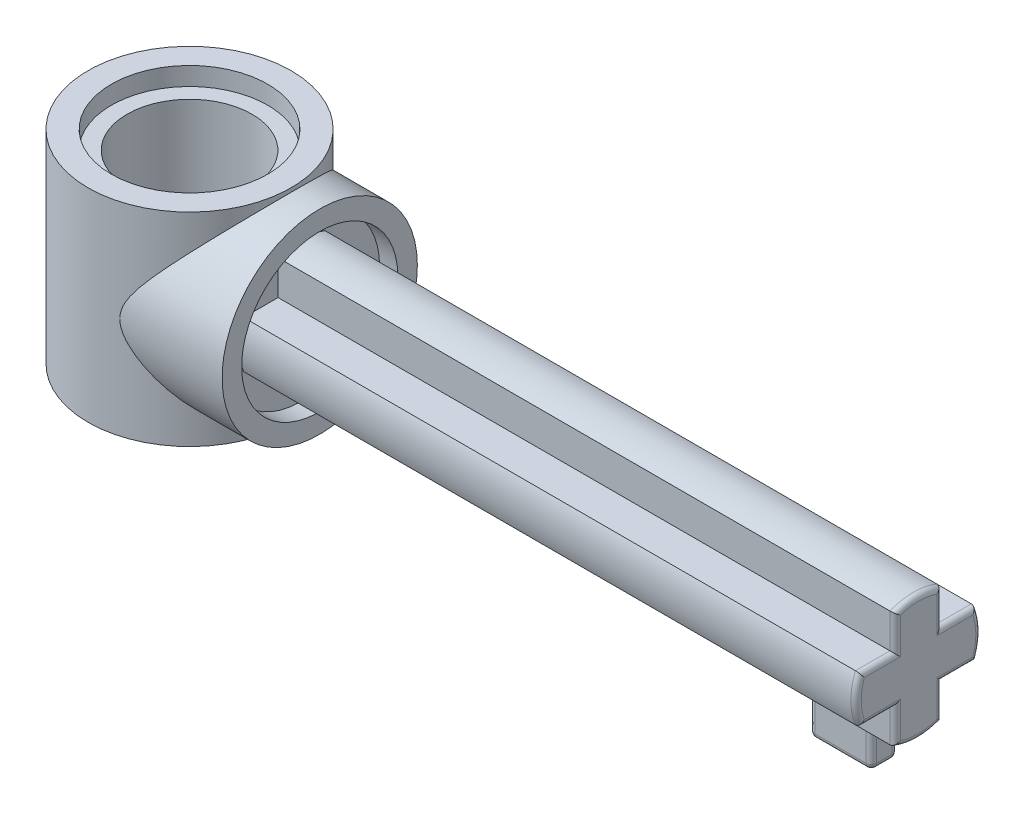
ISO-10303-21;
HEADER;
FILE_DESCRIPTION(('STEP AP214'),'2;1');
FILE_NAME('part.step','',(''),(''),'','','');
FILE_SCHEMA(('AUTOMOTIVE_DESIGN { 1 0 10303 214 1 1 1 1 }'));
ENDSEC;
DATA;
#1=APPLICATION_CONTEXT('core data for automotive mechanical design processes');
#2=APPLICATION_PROTOCOL_DEFINITION('international standard','automotive_design',2000,#1);
#3=PRODUCT_CONTEXT('',#1,'mechanical');
#4=PRODUCT('Part','Part','',(#3));
#5=PRODUCT_RELATED_PRODUCT_CATEGORY('part','',(#4));
#6=PRODUCT_DEFINITION_FORMATION('','',#4);
#7=PRODUCT_DEFINITION_CONTEXT('part definition',#1,'design');
#8=PRODUCT_DEFINITION('design','',#6,#7);
#9=PRODUCT_DEFINITION_SHAPE('','',#8);
#10=(LENGTH_UNIT() NAMED_UNIT(*) SI_UNIT(.MILLI.,.METRE.));
#11=(NAMED_UNIT(*) PLANE_ANGLE_UNIT() SI_UNIT($,.RADIAN.));
#12=(NAMED_UNIT(*) SI_UNIT($,.STERADIAN.) SOLID_ANGLE_UNIT());
#13=UNCERTAINTY_MEASURE_WITH_UNIT(LENGTH_MEASURE(1.E-05),#10,'distance_accuracy_value','');
#14=(GEOMETRIC_REPRESENTATION_CONTEXT(3) GLOBAL_UNCERTAINTY_ASSIGNED_CONTEXT((#13)) GLOBAL_UNIT_ASSIGNED_CONTEXT((#10,
#11,#12)) REPRESENTATION_CONTEXT('',''));
#15=CARTESIAN_POINT('',(0.,0.,0.));
#16=DIRECTION('',(0.,0.,1.));
#17=DIRECTION('',(1.,0.,0.));
#18=AXIS2_PLACEMENT_3D('',#15,#16,#17);
#19=CARTESIAN_POINT('',(-2.48822509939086,3.90000000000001,0.));
#20=DIRECTION('',(1.,0.,0.));
#21=DIRECTION('',(0.,0.,-1.));
#22=AXIS2_PLACEMENT_3D('',#19,#20,#21);
#23=CYLINDRICAL_SURFACE('',#22,2.4);
#24=DIRECTION('',(1.,0.,0.));
#25=VECTOR('',#24,1.);
#26=CARTESIAN_POINT('',(-2.48822509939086,1.6751404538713,-0.900000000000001));
#27=LINE('',#26,#25);
#28=CARTESIAN_POINT('',(4.3,1.6751404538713,-0.900000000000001));
#29=VERTEX_POINT('',#28);
#30=CARTESIAN_POINT('',(27.8,1.6751404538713,-0.900000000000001));
#31=VERTEX_POINT('',#30);
#32=EDGE_CURVE('E715',#29,#31,#27,.T.);
#33=ORIENTED_EDGE('',*,*,#32,.T.);
#34=CARTESIAN_POINT('',(27.8,3.90000000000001,0.));
#35=DIRECTION('',(1.,0.,0.));
#36=DIRECTION('',(0.,0.,-1.));
#37=AXIS2_PLACEMENT_3D('',#34,#35,#36);
#38=CIRCLE('',#37,2.4);
#39=CARTESIAN_POINT('',(27.8,1.6751404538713,0.899999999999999));
#40=VERTEX_POINT('',#39);
#41=EDGE_CURVE('E605',#31,#40,#38,.F.);
#42=ORIENTED_EDGE('',*,*,#41,.T.);
#43=DIRECTION('',(1.,0.,0.));
#44=VECTOR('',#43,1.);
#45=CARTESIAN_POINT('',(-2.48822509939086,1.6751404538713,0.899999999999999));
#46=LINE('',#45,#44);
#47=CARTESIAN_POINT('',(4.3,1.6751404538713,0.899999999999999));
#48=VERTEX_POINT('',#47);
#49=EDGE_CURVE('E711',#48,#40,#46,.T.);
#50=ORIENTED_EDGE('',*,*,#49,.F.);
#51=CARTESIAN_POINT('',(4.3,3.90000000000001,0.));
#52=DIRECTION('',(1.,0.,0.));
#53=DIRECTION('',(0.,0.,-1.));
#54=AXIS2_PLACEMENT_3D('',#51,#52,#53);
#55=CIRCLE('',#54,2.4);
#56=EDGE_CURVE('E748',#29,#48,#55,.F.);
#57=ORIENTED_EDGE('',*,*,#56,.F.);
#58=EDGE_LOOP('',(#33,#42,#50,#57));
#59=FACE_BOUND('',#58,.T.);
#60=CARTESIAN_POINT('',(24.6425769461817,1.58330216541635,-0.626826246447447));
#61=CARTESIAN_POINT('',(24.5913871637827,1.54499928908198,-0.4852619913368));
#62=CARTESIAN_POINT('',(24.5787173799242,1.39024401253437,-0.489530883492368));
#63=CARTESIAN_POINT('',(24.6220907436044,1.58503854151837,-0.633216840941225));
#64=CARTESIAN_POINT('',(24.5794485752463,1.54588969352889,-0.490089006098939));
#65=CARTESIAN_POINT('',(24.5684742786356,1.39212508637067,-0.492992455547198));
#66=CARTESIAN_POINT('',(24.6009979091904,1.58636779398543,-0.638050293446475));
#67=CARTESIAN_POINT('',(24.5668627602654,1.5465805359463,-0.493776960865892));
#68=CARTESIAN_POINT('',(24.5579278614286,1.39356511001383,-0.495610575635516));
#69=CARTESIAN_POINT('',(24.5582234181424,1.58815702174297,-0.644517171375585));
#70=CARTESIAN_POINT('',(24.5411542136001,1.54751413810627,-0.498723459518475));
#71=CARTESIAN_POINT('',(24.5365406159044,1.39550344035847,-0.499113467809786));
#72=CARTESIAN_POINT('',(24.5365423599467,1.58861784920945,-0.646153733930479));
#73=CARTESIAN_POINT('',(24.5279975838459,1.54775993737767,-0.499998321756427));
#74=CARTESIAN_POINT('',(24.5257000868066,1.3960026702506,-0.499999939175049));
#75=CARTESIAN_POINT('',(24.4928835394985,1.58861882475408,-0.646153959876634));
#76=CARTESIAN_POINT('',(24.501542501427,1.54776122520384,-0.500001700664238));
#77=CARTESIAN_POINT('',(24.5038706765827,1.39600372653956,-0.500000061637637));
#78=CARTESIAN_POINT('',(24.4709056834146,1.58814658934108,-0.644473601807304));
#79=CARTESIAN_POINT('',(24.4882041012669,1.54751011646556,-0.498695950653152));
#80=CARTESIAN_POINT('',(24.492881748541,1.39549213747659,-0.499089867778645));
#81=CARTESIAN_POINT('',(24.4276120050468,1.58630669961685,-0.637835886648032));
#82=CARTESIAN_POINT('',(24.4621920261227,1.54654703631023,-0.493606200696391));
#83=CARTESIAN_POINT('',(24.4712349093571,1.39349892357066,-0.495494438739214));
#84=CARTESIAN_POINT('',(24.4062960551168,1.58493921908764,-0.632879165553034));
#85=CARTESIAN_POINT('',(24.4494823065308,1.54583237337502,-0.489807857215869));
#86=CARTESIAN_POINT('',(24.4605769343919,1.39201748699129,-0.492809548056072));
#87=CARTESIAN_POINT('',(24.3442880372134,1.57964402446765,-0.613300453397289));
#88=CARTESIAN_POINT('',(24.4131582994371,1.5431212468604,-0.47501526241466));
#89=CARTESIAN_POINT('',(24.4295729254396,1.38628102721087,-0.482204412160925));
#90=CARTESIAN_POINT('',(24.3053377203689,1.57452215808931,-0.593968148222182));
#91=CARTESIAN_POINT('',(24.391286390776,1.54054284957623,-0.460538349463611));
#92=CARTESIAN_POINT('',(24.4100977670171,1.38073233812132,-0.471732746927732));
#93=CARTESIAN_POINT('',(24.23574689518,1.56246498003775,-0.544588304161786));
#94=CARTESIAN_POINT('',(24.3551175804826,1.53494607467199,-0.426031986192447));
#95=CARTESIAN_POINT('',(24.375302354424,1.36767039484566,-0.444985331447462));
#96=CARTESIAN_POINT('',(24.2052970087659,1.5554940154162,-0.514325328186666));
#97=CARTESIAN_POINT('',(24.341058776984,1.53189572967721,-0.405684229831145));
#98=CARTESIAN_POINT('',(24.3600774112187,1.3601185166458,-0.428592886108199));
#99=CARTESIAN_POINT('',(24.1559831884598,1.54139891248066,-0.445249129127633));
#100=CARTESIAN_POINT('',(24.3211233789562,1.52614077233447,-0.363276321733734));
#101=CARTESIAN_POINT('',(24.3354205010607,1.34484882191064,-0.39117661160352));
#102=CARTESIAN_POINT('',(24.1374620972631,1.53427585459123,-0.406223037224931));
#103=CARTESIAN_POINT('',(24.315720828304,1.52346434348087,-0.341194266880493));
#104=CARTESIAN_POINT('',(24.3261599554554,1.33713217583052,-0.370037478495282));
#105=CARTESIAN_POINT('',(24.1210531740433,1.52484052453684,-0.345051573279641));
#106=CARTESIAN_POINT('',(24.3129033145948,1.51978527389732,-0.30962670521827));
#107=CARTESIAN_POINT('',(24.3179554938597,1.32691056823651,-0.336902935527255));
#108=CARTESIAN_POINT('',(24.117484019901,1.52189826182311,-0.324170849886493));
#109=CARTESIAN_POINT('',(24.3128759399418,1.51860913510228,-0.299305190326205));
#110=CARTESIAN_POINT('',(24.3161709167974,1.32372311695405,-0.325592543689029));
#111=CARTESIAN_POINT('',(24.1142472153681,1.5165388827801,-0.282062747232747));
#112=CARTESIAN_POINT('',(24.3143099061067,1.51629539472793,-0.279174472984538));
#113=CARTESIAN_POINT('',(24.3145525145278,1.31791712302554,-0.302783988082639));
#114=CARTESIAN_POINT('',(24.1145794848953,1.51412175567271,-0.260835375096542));
#115=CARTESIAN_POINT('',(24.3157808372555,1.515161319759,-0.269397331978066));
#116=CARTESIAN_POINT('',(24.3147186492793,1.31529856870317,-0.291285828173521));
#117=CARTESIAN_POINT('',(24.1191536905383,1.50993149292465,-0.219094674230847));
#118=CARTESIAN_POINT('',(24.3199771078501,1.51290995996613,-0.25052565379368));
#119=CARTESIAN_POINT('',(24.3170057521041,1.31075911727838,-0.268676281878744));
#120=CARTESIAN_POINT('',(24.1233212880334,1.50814700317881,-0.19857544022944));
#121=CARTESIAN_POINT('',(24.322677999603,1.51179604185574,-0.241451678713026));
#122=CARTESIAN_POINT('',(24.3190895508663,1.3088259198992,-0.257561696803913));
#123=CARTESIAN_POINT('',(24.1353453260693,1.50514607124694,-0.158407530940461));
#124=CARTESIAN_POINT('',(24.3293174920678,1.50956350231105,-0.223704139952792));
#125=CARTESIAN_POINT('',(24.3251015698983,1.30557491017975,-0.23580407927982));
#126=CARTESIAN_POINT('',(24.1432066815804,1.5039303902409,-0.138760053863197));
#127=CARTESIAN_POINT('',(24.3332506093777,1.50844804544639,-0.215057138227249));
#128=CARTESIAN_POINT('',(24.3290322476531,1.30425792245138,-0.225161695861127));
#129=CARTESIAN_POINT('',(24.1528511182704,1.50299493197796,-0.119861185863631));
#130=CARTESIAN_POINT('',(24.3377831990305,1.50733057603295,-0.20656615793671));
#131=CARTESIAN_POINT('',(24.3338544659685,1.30324450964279,-0.214924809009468));
#132=(BOUNDED_SURFACE() B_SPLINE_SURFACE(3,2,((#60,#61,#62),(#63,#64,#65),(#66,#67,#68),(#69,
#70,#71),(#72,#73,#74),(#75,#76,#77),(#78,#79,#80),(#81,#82,#83),(#84,#85,#86),(#87,#88,#89),
(#90,#91,#92),(#93,#94,#95),(#96,#97,#98),(#99,#100,#101),(#102,#103,#104),(#105,#106,#107),
(#108,#109,#110),(#111,#112,#113),(#114,#115,#116),(#117,#118,#119),(#120,#121,#122),(#123,#124,
#125),(#126,#127,#128),(#129,#130,#131)),.UNSPECIFIED.,.F.,.F.,
.F.) B_SPLINE_SURFACE_WITH_KNOTS((4,2,2,2,2,2,2,2,2,2,2,4),(3,3),(0.,0.0650372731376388,
0.130010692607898,0.195852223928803,0.261680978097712,0.392773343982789,0.526604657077,
0.664128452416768,0.733211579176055,0.802293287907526,0.870063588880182,0.937924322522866),(0.,
1.),.UNSPECIFIED.) GEOMETRIC_REPRESENTATION_ITEM() RATIONAL_B_SPLINE_SURFACE(((1.,
0.789780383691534,1.),(1.,0.792018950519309,1.),(1.,0.793731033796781,1.),(1.,0.796034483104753,
1.),(1.,0.796626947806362,1.),(1.,0.796628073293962,1.),(1.,0.796020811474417,1.),(1.,
0.79365263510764,1.),(1.,0.791891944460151,1.),(1.,0.785062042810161,1.),(1.,0.778443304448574,
1.),(1.,0.762863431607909,1.),(1.,0.753856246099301,1.),(1.,0.736000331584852,1.),(1.,
0.727162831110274,1.),(1.,0.716264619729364,1.),(1.,0.713020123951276,1.),(1.,0.707514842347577,
1.),(1.,0.705254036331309,1.),(1.,0.7018649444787,1.),(1.,0.700715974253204,1.),(1.,
0.699408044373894,1.),(1.,0.699250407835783,1.),(1.,0.69955550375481,1.))) REPRESENTATION_ITEM('') SURFACE());
#133=CARTESIAN_POINT('',(24.1528511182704,1.50299493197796,-0.119861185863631));
#134=CARTESIAN_POINT('',(24.1432066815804,1.5039303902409,-0.138760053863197));
#135=CARTESIAN_POINT('',(24.1353453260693,1.50514607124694,-0.158407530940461));
#136=CARTESIAN_POINT('',(24.1233212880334,1.50814700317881,-0.19857544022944));
#137=CARTESIAN_POINT('',(24.1191536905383,1.50993149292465,-0.219094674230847));
#138=CARTESIAN_POINT('',(24.1145794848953,1.51412175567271,-0.260835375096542));
#139=CARTESIAN_POINT('',(24.1142472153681,1.5165388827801,-0.282062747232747));
#140=CARTESIAN_POINT('',(24.117484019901,1.52189826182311,-0.324170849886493));
#141=CARTESIAN_POINT('',(24.1210531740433,1.52484052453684,-0.345051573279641));
#142=CARTESIAN_POINT('',(24.1374620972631,1.53427585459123,-0.406223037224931));
#143=CARTESIAN_POINT('',(24.1559831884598,1.54139891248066,-0.445249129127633));
#144=CARTESIAN_POINT('',(24.2052970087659,1.5554940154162,-0.514325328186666));
#145=CARTESIAN_POINT('',(24.23574689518,1.56246498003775,-0.544588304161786));
#146=CARTESIAN_POINT('',(24.3053377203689,1.57452215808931,-0.593968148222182));
#147=CARTESIAN_POINT('',(24.3442880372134,1.57964402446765,-0.613300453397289));
#148=CARTESIAN_POINT('',(24.4062960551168,1.58493921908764,-0.632879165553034));
#149=CARTESIAN_POINT('',(24.4276120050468,1.58630669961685,-0.637835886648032));
#150=CARTESIAN_POINT('',(24.4709056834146,1.58814658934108,-0.644473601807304));
#151=CARTESIAN_POINT('',(24.4928835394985,1.58861882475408,-0.646153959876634));
#152=CARTESIAN_POINT('',(24.5365423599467,1.58861784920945,-0.646153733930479));
#153=CARTESIAN_POINT('',(24.5582234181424,1.58815702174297,-0.644517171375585));
#154=CARTESIAN_POINT('',(24.6009979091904,1.58636779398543,-0.638050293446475));
#155=CARTESIAN_POINT('',(24.6220907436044,1.58503854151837,-0.633216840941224));
#156=CARTESIAN_POINT('',(24.6425769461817,1.58330216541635,-0.626826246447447));
#157=B_SPLINE_CURVE_WITH_KNOTS('',3,(#133,#134,#135,#136,#137,#138,#139,#140,#141,#142,#143,
#144,#145,#146,#147,#148,#149,#150,#151,#152,#153,#154,#155,#156),.UNSPECIFIED.,.F.,.F.,(4,2,2,
2,2,2,2,2,2,2,2,4),(0.,0.0678607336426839,0.13563103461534,0.20471274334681,0.273795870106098,
0.411319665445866,0.545150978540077,0.676243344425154,0.742072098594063,0.807913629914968,
0.872887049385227,0.937924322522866),.UNSPECIFIED.);
#158=CARTESIAN_POINT('',(24.1148578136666,1.51602986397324,-0.276923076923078));
#159=VERTEX_POINT('',#158);
#160=CARTESIAN_POINT('',(24.5148578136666,1.58861833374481,-0.646153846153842));
#161=VERTEX_POINT('',#160);
#162=EDGE_CURVE('E405',#159,#161,#157,.T.);
#163=ORIENTED_EDGE('',*,*,#162,.F.);
#164=CARTESIAN_POINT('',(24.1148578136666,3.9,0.));
#165=DIRECTION('',(1.,0.,0.));
#166=DIRECTION('',(0.,0.,-1.));
#167=AXIS2_PLACEMENT_3D('',#164,#165,#166);
#168=CIRCLE('',#167,2.4);
#169=CARTESIAN_POINT('',(24.1148578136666,1.51602986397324,0.276923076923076));
#170=VERTEX_POINT('',#169);
#171=EDGE_CURVE('E397',#159,#170,#168,.F.);
#172=ORIENTED_EDGE('',*,*,#171,.T.);
#173=CARTESIAN_POINT('',(24.1370138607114,1.50505865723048,0.15574326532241));
#174=CARTESIAN_POINT('',(24.3300469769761,1.50940169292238,0.222528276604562));
#175=CARTESIAN_POINT('',(24.325935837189,1.30548021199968,0.234360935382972));
#176=CARTESIAN_POINT('',(24.1296570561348,1.50631652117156,0.175238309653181));
#177=CARTESIAN_POINT('',(24.3263404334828,1.51051587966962,0.231157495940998));
#178=CARTESIAN_POINT('',(24.3222574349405,1.30684289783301,0.244920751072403));
#179=CARTESIAN_POINT('',(24.1241156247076,1.50786869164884,0.195284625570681));
#180=CARTESIAN_POINT('',(24.3231801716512,1.51161655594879,0.239968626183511));
#181=CARTESIAN_POINT('',(24.3194867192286,1.30852441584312,0.255779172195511));
#182=CARTESIAN_POINT('',(24.1167185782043,1.51153467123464,0.235871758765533));
#183=CARTESIAN_POINT('',(24.3180796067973,1.51381823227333,0.258074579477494));
#184=CARTESIAN_POINT('',(24.3157881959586,1.3124958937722,0.27776386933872));
#185=CARTESIAN_POINT('',(24.1148580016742,1.51364771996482,0.256411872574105));
#186=CARTESIAN_POINT('',(24.3161406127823,1.51491607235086,0.267341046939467));
#187=CARTESIAN_POINT('',(24.3148579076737,1.31478502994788,0.288889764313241));
#188=CARTESIAN_POINT('',(24.1148576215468,1.51846411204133,0.297882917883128));
#189=CARTESIAN_POINT('',(24.3135554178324,1.51716067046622,0.286651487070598));
#190=CARTESIAN_POINT('',(24.3148577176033,1.32000278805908,0.311353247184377));
#191=CARTESIAN_POINT('',(24.1168000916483,1.52117935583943,0.318812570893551));
#192=CARTESIAN_POINT('',(24.3129331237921,1.5183046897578,0.296677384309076));
#193=CARTESIAN_POINT('',(24.3158289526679,1.32294430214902,0.322690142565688));
#194=CARTESIAN_POINT('',(24.1244514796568,1.52706000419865,0.35998844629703));
#195=CARTESIAN_POINT('',(24.3133354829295,1.5206698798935,0.317249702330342));
#196=CARTESIAN_POINT('',(24.3196546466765,1.32931500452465,0.344993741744));
#197=CARTESIAN_POINT('',(24.1301606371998,1.53022543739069,0.380234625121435));
#198=CARTESIAN_POINT('',(24.3143448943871,1.52188756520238,0.327767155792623));
#199=CARTESIAN_POINT('',(24.3225092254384,1.33274422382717,0.355960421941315));
#200=CARTESIAN_POINT('',(24.1527051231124,1.54017560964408,0.439070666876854));
#201=CARTESIAN_POINT('',(24.3203130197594,1.52571975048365,0.359654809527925));
#202=CARTESIAN_POINT('',(24.3337814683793,1.34352357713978,0.387829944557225));
#203=CARTESIAN_POINT('',(24.1749594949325,1.54743649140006,0.475940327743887));
#204=CARTESIAN_POINT('',(24.3281087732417,1.52854161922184,0.381659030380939));
#205=CARTESIAN_POINT('',(24.3449086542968,1.35138953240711,0.407801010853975));
#206=CARTESIAN_POINT('',(24.2317553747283,1.56156237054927,0.541167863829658));
#207=CARTESIAN_POINT('',(24.3532553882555,1.53451797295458,0.423402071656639));
#208=CARTESIAN_POINT('',(24.3733065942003,1.36669256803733,0.443132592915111));
#209=CARTESIAN_POINT('',(24.2664337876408,1.5684219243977,0.569424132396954));
#210=CARTESIAN_POINT('',(24.3705047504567,1.53767264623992,0.443199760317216));
#211=CARTESIAN_POINT('',(24.3906458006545,1.37412375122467,0.45843807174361));
#212=CARTESIAN_POINT('',(24.3442699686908,1.57962009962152,0.613490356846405));
#213=CARTESIAN_POINT('',(24.4129588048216,1.5430565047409,0.474900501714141));
#214=CARTESIAN_POINT('',(24.429563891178,1.38625510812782,0.482307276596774));
#215=CARTESIAN_POINT('',(24.3873573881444,1.58397852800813,0.629398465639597));
#216=CARTESIAN_POINT('',(24.438119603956,1.54533048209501,0.487130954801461));
#217=CARTESIAN_POINT('',(24.4511076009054,1.39097673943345,0.49092416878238));
#218=CARTESIAN_POINT('',(24.4537199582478,1.58756990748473,0.642400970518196));
#219=CARTESIAN_POINT('',(24.4778192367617,1.54720644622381,0.497101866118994));
#220=CARTESIAN_POINT('',(24.4842888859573,1.3948673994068,0.497967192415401));
#221=CARTESIAN_POINT('',(24.4757928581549,1.58828593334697,0.64496298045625));
#222=CARTESIAN_POINT('',(24.4911840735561,1.54758539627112,0.499082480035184));
#223=CARTESIAN_POINT('',(24.4953253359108,1.39564309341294,0.499354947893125));
#224=CARTESIAN_POINT('',(24.5201363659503,1.5887665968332,0.646685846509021));
#225=CARTESIAN_POINT('',(24.5180484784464,1.5478385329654,0.500408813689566));
#226=CARTESIAN_POINT('',(24.5174970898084,1.3961638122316,0.500288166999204));
#227=CARTESIAN_POINT('',(24.5424070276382,1.58853096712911,0.645845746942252));
#228=CARTESIAN_POINT('',(24.5315892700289,1.54771335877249,0.499757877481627));
#229=CARTESIAN_POINT('',(24.5286324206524,1.39590854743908,0.499833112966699));
#230=CARTESIAN_POINT('',(24.5859388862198,1.58713451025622,0.640828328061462));
#231=CARTESIAN_POINT('',(24.5578332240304,1.54697990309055,0.495898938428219));
#232=CARTESIAN_POINT('',(24.5503983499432,1.39439571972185,0.497115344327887));
#233=CARTESIAN_POINT('',(24.6072115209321,1.58599499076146,0.636727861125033));
#234=CARTESIAN_POINT('',(24.5705862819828,1.54638060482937,0.49273851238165));
#235=CARTESIAN_POINT('',(24.5610346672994,1.39316124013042,0.494894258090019));
#236=CARTESIAN_POINT('',(24.6487137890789,1.58292262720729,0.625443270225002));
#237=CARTESIAN_POINT('',(24.5950769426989,1.5448006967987,0.484200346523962));
#238=CARTESIAN_POINT('',(24.5817858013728,1.38983284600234,0.488781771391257));
#239=CARTESIAN_POINT('',(24.6689429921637,1.58098945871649,0.618257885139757));
#240=CARTESIAN_POINT('',(24.6068409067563,1.5438159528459,0.478799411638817));
#241=CARTESIAN_POINT('',(24.5919004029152,1.38773857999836,0.484889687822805));
#242=CARTESIAN_POINT('',(24.6883611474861,1.57871271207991,0.6096107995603));
#243=CARTESIAN_POINT('',(24.6177662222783,1.54268608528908,0.472427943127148));
#244=CARTESIAN_POINT('',(24.6016094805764,1.38527210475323,0.480205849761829));
#245=(BOUNDED_SURFACE() B_SPLINE_SURFACE(3,2,((#173,#174,#175),(#176,#177,#178),(#179,#180,
#181),(#182,#183,#184),(#185,#186,#187),(#188,#189,#190),(#191,#192,#193),(#194,#195,#196),
(#197,#198,#199),(#200,#201,#202),(#203,#204,#205),(#206,#207,#208),(#209,#210,#211),(#212,#213,
#214),(#215,#216,#217),(#218,#219,#220),(#221,#222,#223),(#224,#225,#226),(#227,#228,#229),
(#230,#231,#232),(#233,#234,#235),(#236,#237,#238),(#239,#240,#241),(#242,#243,#244)),
.UNSPECIFIED.,.F.,.F.,.F.) B_SPLINE_SURFACE_WITH_KNOTS((4,2,2,2,2,2,2,2,2,2,2,4),(3,3),(0.,
0.0671159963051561,0.134141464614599,0.202632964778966,0.271128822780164,0.407552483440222,
0.545528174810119,0.68239556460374,0.748900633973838,0.815424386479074,0.880424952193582,
0.945452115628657),(0.,1.),
.UNSPECIFIED.) GEOMETRIC_REPRESENTATION_ITEM() RATIONAL_B_SPLINE_SURFACE(((1.,0.699536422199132,
1.),(1.,0.699786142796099,1.),(1.,0.700546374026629,1.),(1.,0.703074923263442,1.),(1.,
0.704841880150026,1.),(1.,0.709421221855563,1.),(1.,0.712255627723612,1.),(1.,0.718778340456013,
1.),(1.,0.722466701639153,1.),(1.,0.734422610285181,1.),(1.,0.743603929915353,1.),(1.,
0.761673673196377,1.),(1.,0.770557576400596,1.),(1.,0.78503471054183,1.),(1.,0.790653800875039,
1.),(1.,0.795279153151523,1.),(1.,0.796199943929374,1.),(1.,0.796818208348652,1.),(1.,
0.796515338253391,1.),(1.,0.794718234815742,1.),(1.,0.793251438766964,1.),(1.,0.789291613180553,
1.),(1.,0.786798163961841,1.),(1.,0.783857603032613,1.))) REPRESENTATION_ITEM('') SURFACE());
#246=CARTESIAN_POINT('',(24.6883611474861,1.57871271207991,0.6096107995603));
#247=CARTESIAN_POINT('',(24.6689429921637,1.58098945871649,0.618257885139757));
#248=CARTESIAN_POINT('',(24.6487137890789,1.58292262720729,0.625443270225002));
#249=CARTESIAN_POINT('',(24.6072115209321,1.58599499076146,0.636727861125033));
#250=CARTESIAN_POINT('',(24.5859388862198,1.58713451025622,0.640828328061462));
#251=CARTESIAN_POINT('',(24.5424070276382,1.58853096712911,0.645845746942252));
#252=CARTESIAN_POINT('',(24.5201363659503,1.5887665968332,0.646685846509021));
#253=CARTESIAN_POINT('',(24.4757928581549,1.58828593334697,0.64496298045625));
#254=CARTESIAN_POINT('',(24.4537199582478,1.58756990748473,0.642400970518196));
#255=CARTESIAN_POINT('',(24.3873573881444,1.58397852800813,0.629398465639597));
#256=CARTESIAN_POINT('',(24.3442699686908,1.57962009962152,0.613490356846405));
#257=CARTESIAN_POINT('',(24.2664337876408,1.5684219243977,0.569424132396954));
#258=CARTESIAN_POINT('',(24.2317553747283,1.56156237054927,0.541167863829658));
#259=CARTESIAN_POINT('',(24.1749594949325,1.54743649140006,0.475940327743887));
#260=CARTESIAN_POINT('',(24.1527051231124,1.54017560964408,0.439070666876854));
#261=CARTESIAN_POINT('',(24.1301606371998,1.53022543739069,0.380234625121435));
#262=CARTESIAN_POINT('',(24.1244514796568,1.52706000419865,0.35998844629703));
#263=CARTESIAN_POINT('',(24.1168000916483,1.52117935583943,0.318812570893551));
#264=CARTESIAN_POINT('',(24.1148576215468,1.51846411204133,0.297882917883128));
#265=CARTESIAN_POINT('',(24.1148580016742,1.51364771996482,0.256411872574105));
#266=CARTESIAN_POINT('',(24.1167185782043,1.51153467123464,0.235871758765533));
#267=CARTESIAN_POINT('',(24.1241156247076,1.50786869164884,0.195284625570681));
#268=CARTESIAN_POINT('',(24.1296570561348,1.50631652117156,0.175238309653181));
#269=CARTESIAN_POINT('',(24.1370138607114,1.50505865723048,0.15574326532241));
#270=B_SPLINE_CURVE_WITH_KNOTS('',3,(#246,#247,#248,#249,#250,#251,#252,#253,#254,#255,#256,
#257,#258,#259,#260,#261,#262,#263,#264,#265,#266,#267,#268,#269),.UNSPECIFIED.,.F.,.F.,(4,2,2,
2,2,2,2,2,2,2,2,4),(0.,0.0650271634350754,0.130027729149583,0.196551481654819,0.263056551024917,
0.399923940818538,0.537899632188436,0.674323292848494,0.742819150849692,0.811310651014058,
0.878336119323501,0.945452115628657),.UNSPECIFIED.);
#271=CARTESIAN_POINT('',(24.5148578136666,1.58861833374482,0.646153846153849));
#272=VERTEX_POINT('',#271);
#273=EDGE_CURVE('E390',#272,#170,#270,.T.);
#274=ORIENTED_EDGE('',*,*,#273,.F.);
#275=DIRECTION('',(1.,0.,0.));
#276=VECTOR('',#275,1.);
#277=CARTESIAN_POINT('',(-2.48822509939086,1.58861833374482,0.646153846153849));
#278=LINE('',#277,#276);
#279=CARTESIAN_POINT('',(26.4851421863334,1.58861833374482,0.646153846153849));
#280=VERTEX_POINT('',#279);
#281=EDGE_CURVE('E398',#272,#280,#278,.T.);
#282=ORIENTED_EDGE('',*,*,#281,.T.);
#283=CARTESIAN_POINT('',(26.3574230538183,1.58330216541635,0.626826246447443));
#284=CARTESIAN_POINT('',(26.4086128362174,1.54499928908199,0.485261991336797));
#285=CARTESIAN_POINT('',(26.4212826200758,1.39024401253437,0.489530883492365));
#286=CARTESIAN_POINT('',(26.3779092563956,1.58503854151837,0.633216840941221));
#287=CARTESIAN_POINT('',(26.4205514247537,1.54588969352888,0.490089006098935));
#288=CARTESIAN_POINT('',(26.4315257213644,1.39212508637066,0.492992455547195));
#289=CARTESIAN_POINT('',(26.3990020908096,1.58636779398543,0.638050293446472));
#290=CARTESIAN_POINT('',(26.4331372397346,1.5465805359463,0.493776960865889));
#291=CARTESIAN_POINT('',(26.4420721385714,1.39356511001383,0.495610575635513));
#292=CARTESIAN_POINT('',(26.4417765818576,1.58815702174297,0.644517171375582));
#293=CARTESIAN_POINT('',(26.4588457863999,1.54751413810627,0.498723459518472));
#294=CARTESIAN_POINT('',(26.4634593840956,1.39550344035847,0.499113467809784));
#295=CARTESIAN_POINT('',(26.4634576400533,1.58861784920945,0.646153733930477));
#296=CARTESIAN_POINT('',(26.4720024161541,1.54775993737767,0.499998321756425));
#297=CARTESIAN_POINT('',(26.4742999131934,1.3960026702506,0.499999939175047));
#298=CARTESIAN_POINT('',(26.5071164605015,1.58861882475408,0.646153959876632));
#299=CARTESIAN_POINT('',(26.498457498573,1.54776122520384,0.500001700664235));
#300=CARTESIAN_POINT('',(26.4961293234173,1.39600372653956,0.500000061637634));
#301=CARTESIAN_POINT('',(26.5290943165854,1.58814658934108,0.644473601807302));
#302=CARTESIAN_POINT('',(26.5117958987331,1.54751011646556,0.49869595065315));
#303=CARTESIAN_POINT('',(26.507118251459,1.39549213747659,0.499089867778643));
#304=CARTESIAN_POINT('',(26.5723879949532,1.58630669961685,0.63783588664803));
#305=CARTESIAN_POINT('',(26.5378079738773,1.54654703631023,0.493606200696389));
#306=CARTESIAN_POINT('',(26.5287650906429,1.39349892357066,0.495494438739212));
#307=CARTESIAN_POINT('',(26.5937039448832,1.58493921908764,0.632879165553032));
#308=CARTESIAN_POINT('',(26.5505176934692,1.54583237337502,0.489807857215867));
#309=CARTESIAN_POINT('',(26.5394230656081,1.39201748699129,0.492809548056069));
#310=CARTESIAN_POINT('',(26.6557119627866,1.57964402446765,0.613300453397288));
#311=CARTESIAN_POINT('',(26.5868417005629,1.5431212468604,0.475015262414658));
#312=CARTESIAN_POINT('',(26.5704270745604,1.38628102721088,0.482204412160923));
#313=CARTESIAN_POINT('',(26.6946622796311,1.57452215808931,0.59396814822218));
#314=CARTESIAN_POINT('',(26.608713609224,1.54054284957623,0.460538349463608));
#315=CARTESIAN_POINT('',(26.5899022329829,1.38073233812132,0.47173274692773));
#316=CARTESIAN_POINT('',(26.76425310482,1.56246498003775,0.544588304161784));
#317=CARTESIAN_POINT('',(26.6448824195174,1.53494607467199,0.426031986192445));
#318=CARTESIAN_POINT('',(26.624697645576,1.36767039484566,0.444985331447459));
#319=CARTESIAN_POINT('',(26.7947029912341,1.5554940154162,0.514325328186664));
#320=CARTESIAN_POINT('',(26.658941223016,1.53189572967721,0.405684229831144));
#321=CARTESIAN_POINT('',(26.6399225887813,1.3601185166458,0.428592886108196));
#322=CARTESIAN_POINT('',(26.8440168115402,1.54139891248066,0.445249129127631));
#323=CARTESIAN_POINT('',(26.6788766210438,1.52614077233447,0.363276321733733));
#324=CARTESIAN_POINT('',(26.6645794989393,1.34484882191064,0.391176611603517));
#325=CARTESIAN_POINT('',(26.8625379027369,1.53427585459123,0.406223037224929));
#326=CARTESIAN_POINT('',(26.684279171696,1.52346434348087,0.341194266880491));
#327=CARTESIAN_POINT('',(26.6738400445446,1.33713217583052,0.37003747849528));
#328=CARTESIAN_POINT('',(26.8789468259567,1.52484052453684,0.345051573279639));
#329=CARTESIAN_POINT('',(26.6870966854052,1.51978527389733,0.309626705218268));
#330=CARTESIAN_POINT('',(26.6820445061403,1.32691056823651,0.336902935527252));
#331=CARTESIAN_POINT('',(26.882515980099,1.52189826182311,0.324170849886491));
#332=CARTESIAN_POINT('',(26.6871240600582,1.51860913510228,0.299305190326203));
#333=CARTESIAN_POINT('',(26.6838290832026,1.32372311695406,0.325592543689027));
#334=CARTESIAN_POINT('',(26.8857527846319,1.5165388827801,0.282062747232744));
#335=CARTESIAN_POINT('',(26.6856900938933,1.51629539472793,0.279174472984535));
#336=CARTESIAN_POINT('',(26.6854474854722,1.31791712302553,0.302783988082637));
#337=CARTESIAN_POINT('',(26.8854205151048,1.51412175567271,0.260835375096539));
#338=CARTESIAN_POINT('',(26.6842191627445,1.51516131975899,0.269397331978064));
#339=CARTESIAN_POINT('',(26.6852813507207,1.31529856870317,0.291285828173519));
#340=CARTESIAN_POINT('',(26.8808463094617,1.50993149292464,0.219094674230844));
#341=CARTESIAN_POINT('',(26.6800228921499,1.51290995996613,0.250525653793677));
#342=CARTESIAN_POINT('',(26.6829942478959,1.31075911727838,0.268676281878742));
#343=CARTESIAN_POINT('',(26.8766787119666,1.50814700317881,0.198575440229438));
#344=CARTESIAN_POINT('',(26.677322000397,1.51179604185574,0.241451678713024));
#345=CARTESIAN_POINT('',(26.6809104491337,1.3088259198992,0.257561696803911));
#346=CARTESIAN_POINT('',(26.8646546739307,1.50514607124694,0.15840753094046));
#347=CARTESIAN_POINT('',(26.6706825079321,1.50956350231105,0.22370413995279));
#348=CARTESIAN_POINT('',(26.6748984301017,1.30557491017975,0.235804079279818));
#349=CARTESIAN_POINT('',(26.8567933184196,1.5039303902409,0.138760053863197));
#350=CARTESIAN_POINT('',(26.6667493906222,1.50844804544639,0.215057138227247));
#351=CARTESIAN_POINT('',(26.6709677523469,1.30425792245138,0.225161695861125));
#352=CARTESIAN_POINT('',(26.8471488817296,1.50299493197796,0.11986118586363));
#353=CARTESIAN_POINT('',(26.6622168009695,1.50733057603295,0.206566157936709));
#354=CARTESIAN_POINT('',(26.6661455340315,1.30324450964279,0.214924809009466));
#355=(BOUNDED_SURFACE() B_SPLINE_SURFACE(3,2,((#283,#284,#285),(#286,#287,#288),(#289,#290,
#291),(#292,#293,#294),(#295,#296,#297),(#298,#299,#300),(#301,#302,#303),(#304,#305,#306),
(#307,#308,#309),(#310,#311,#312),(#313,#314,#315),(#316,#317,#318),(#319,#320,#321),(#322,#323,
#324),(#325,#326,#327),(#328,#329,#330),(#331,#332,#333),(#334,#335,#336),(#337,#338,#339),
(#340,#341,#342),(#343,#344,#345),(#346,#347,#348),(#349,#350,#351),(#352,#353,#354)),
.UNSPECIFIED.,.F.,.F.,.F.) B_SPLINE_SURFACE_WITH_KNOTS((4,2,2,2,2,2,2,2,2,2,2,4),(3,3),(0.,
0.0650372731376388,0.130010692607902,0.195852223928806,0.261680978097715,0.392773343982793,
0.526604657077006,0.664128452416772,0.73321157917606,0.802293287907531,0.870063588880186,
0.937924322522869),(0.,1.),
.UNSPECIFIED.) GEOMETRIC_REPRESENTATION_ITEM() RATIONAL_B_SPLINE_SURFACE(((1.,0.789780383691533,
1.),(1.,0.792018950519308,1.),(1.,0.793731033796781,1.),(1.,0.796034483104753,1.),(1.,
0.796626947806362,1.),(1.,0.796628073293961,1.),(1.,0.796020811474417,1.),(1.,0.79365263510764,
1.),(1.,0.791891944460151,1.),(1.,0.78506204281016,1.),(1.,0.778443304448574,1.),(1.,
0.762863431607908,1.),(1.,0.753856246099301,1.),(1.,0.736000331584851,1.),(1.,0.727162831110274,
1.),(1.,0.716264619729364,1.),(1.,0.713020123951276,1.),(1.,0.707514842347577,1.),(1.,
0.705254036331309,1.),(1.,0.7018649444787,1.),(1.,0.700715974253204,1.),(1.,0.699408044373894,
1.),(1.,0.699250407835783,1.),(1.,0.69955550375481,1.))) REPRESENTATION_ITEM('') SURFACE());
#356=CARTESIAN_POINT('',(26.8471488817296,1.50299493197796,0.11986118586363));
#357=CARTESIAN_POINT('',(26.8567933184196,1.5039303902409,0.138760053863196));
#358=CARTESIAN_POINT('',(26.8646546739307,1.50514607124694,0.15840753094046));
#359=CARTESIAN_POINT('',(26.8766787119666,1.50814700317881,0.198575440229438));
#360=CARTESIAN_POINT('',(26.8808463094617,1.50993149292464,0.219094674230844));
#361=CARTESIAN_POINT('',(26.8854205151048,1.51412175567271,0.260835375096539));
#362=CARTESIAN_POINT('',(26.8857527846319,1.5165388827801,0.282062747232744));
#363=CARTESIAN_POINT('',(26.8825159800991,1.52189826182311,0.324170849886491));
#364=CARTESIAN_POINT('',(26.8789468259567,1.52484052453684,0.345051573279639));
#365=CARTESIAN_POINT('',(26.8625379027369,1.53427585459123,0.406223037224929));
#366=CARTESIAN_POINT('',(26.8440168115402,1.54139891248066,0.445249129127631));
#367=CARTESIAN_POINT('',(26.7947029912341,1.5554940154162,0.514325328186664));
#368=CARTESIAN_POINT('',(26.76425310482,1.56246498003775,0.544588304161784));
#369=CARTESIAN_POINT('',(26.6946622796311,1.57452215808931,0.59396814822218));
#370=CARTESIAN_POINT('',(26.6557119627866,1.57964402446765,0.613300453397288));
#371=CARTESIAN_POINT('',(26.5937039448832,1.58493921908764,0.632879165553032));
#372=CARTESIAN_POINT('',(26.5723879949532,1.58630669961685,0.63783588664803));
#373=CARTESIAN_POINT('',(26.5290943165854,1.58814658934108,0.644473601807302));
#374=CARTESIAN_POINT('',(26.5071164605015,1.58861882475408,0.646153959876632));
#375=CARTESIAN_POINT('',(26.4634576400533,1.58861784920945,0.646153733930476));
#376=CARTESIAN_POINT('',(26.4417765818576,1.58815702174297,0.644517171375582));
#377=CARTESIAN_POINT('',(26.3990020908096,1.58636779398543,0.638050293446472));
#378=CARTESIAN_POINT('',(26.3779092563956,1.58503854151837,0.633216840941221));
#379=CARTESIAN_POINT('',(26.3574230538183,1.58330216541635,0.626826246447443));
#380=B_SPLINE_CURVE_WITH_KNOTS('',3,(#356,#357,#358,#359,#360,#361,#362,#363,#364,#365,#366,
#367,#368,#369,#370,#371,#372,#373,#374,#375,#376,#377,#378,#379),.UNSPECIFIED.,.F.,.F.,(4,2,2,
2,2,2,2,2,2,2,2,4),(0.,0.0678607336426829,0.135631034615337,0.204712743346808,0.273795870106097,
0.411319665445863,0.545150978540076,0.676243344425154,0.742072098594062,0.807913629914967,
0.87288704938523,0.937924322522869),.UNSPECIFIED.);
#381=CARTESIAN_POINT('',(26.8851421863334,1.51602986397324,0.276923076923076));
#382=VERTEX_POINT('',#381);
#383=EDGE_CURVE('E382',#382,#280,#380,.T.);
#384=ORIENTED_EDGE('',*,*,#383,.F.);
#385=CARTESIAN_POINT('',(26.8851421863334,3.90000000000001,0.));
#386=DIRECTION('',(-1.,0.,0.));
#387=DIRECTION('',(0.,0.,1.));
#388=AXIS2_PLACEMENT_3D('',#385,#386,#387);
#389=CIRCLE('',#388,2.4);
#390=CARTESIAN_POINT('',(26.8851421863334,1.51602986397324,-0.276923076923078));
#391=VERTEX_POINT('',#390);
#392=EDGE_CURVE('E548',#382,#391,#389,.F.);
#393=ORIENTED_EDGE('',*,*,#392,.T.);
#394=CARTESIAN_POINT('',(26.8629861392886,1.50505865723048,-0.155743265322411));
#395=CARTESIAN_POINT('',(26.6699530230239,1.50940169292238,-0.222528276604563));
#396=CARTESIAN_POINT('',(26.674064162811,1.30548021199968,-0.234360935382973));
#397=CARTESIAN_POINT('',(26.8703429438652,1.50631652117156,-0.175238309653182));
#398=CARTESIAN_POINT('',(26.6736595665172,1.51051587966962,-0.231157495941));
#399=CARTESIAN_POINT('',(26.6777425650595,1.30684289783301,-0.244920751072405));
#400=CARTESIAN_POINT('',(26.8758843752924,1.50786869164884,-0.195284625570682));
#401=CARTESIAN_POINT('',(26.6768198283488,1.51161655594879,-0.239968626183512));
#402=CARTESIAN_POINT('',(26.6805132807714,1.30852441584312,-0.255779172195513));
#403=CARTESIAN_POINT('',(26.8832814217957,1.51153467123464,-0.235871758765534));
#404=CARTESIAN_POINT('',(26.6819203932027,1.51381823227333,-0.258074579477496));
#405=CARTESIAN_POINT('',(26.6842118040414,1.3124958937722,-0.277763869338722));
#406=CARTESIAN_POINT('',(26.8851419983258,1.51364771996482,-0.256411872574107));
#407=CARTESIAN_POINT('',(26.6838593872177,1.51491607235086,-0.267341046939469));
#408=CARTESIAN_POINT('',(26.6851420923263,1.31478502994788,-0.288889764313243));
#409=CARTESIAN_POINT('',(26.8851423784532,1.51846411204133,-0.29788291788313));
#410=CARTESIAN_POINT('',(26.6864445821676,1.51716067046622,-0.2866514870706));
#411=CARTESIAN_POINT('',(26.6851422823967,1.32000278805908,-0.31135324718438));
#412=CARTESIAN_POINT('',(26.8831999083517,1.52117935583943,-0.318812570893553));
#413=CARTESIAN_POINT('',(26.687066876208,1.5183046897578,-0.296677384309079));
#414=CARTESIAN_POINT('',(26.6841710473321,1.32294430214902,-0.322690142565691));
#415=CARTESIAN_POINT('',(26.8755485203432,1.52706000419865,-0.359988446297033));
#416=CARTESIAN_POINT('',(26.6866645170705,1.5206698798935,-0.317249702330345));
#417=CARTESIAN_POINT('',(26.6803453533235,1.32931500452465,-0.344993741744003));
#418=CARTESIAN_POINT('',(26.8698393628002,1.53022543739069,-0.380234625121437));
#419=CARTESIAN_POINT('',(26.6856551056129,1.52188756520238,-0.327767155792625));
#420=CARTESIAN_POINT('',(26.6774907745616,1.33274422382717,-0.355960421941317));
#421=CARTESIAN_POINT('',(26.8472948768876,1.54017560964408,-0.439070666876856));
#422=CARTESIAN_POINT('',(26.6796869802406,1.52571975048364,-0.359654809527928));
#423=CARTESIAN_POINT('',(26.6662185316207,1.34352357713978,-0.387829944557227));
#424=CARTESIAN_POINT('',(26.8250405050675,1.54743649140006,-0.475940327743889));
#425=CARTESIAN_POINT('',(26.6718912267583,1.52854161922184,-0.381659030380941));
#426=CARTESIAN_POINT('',(26.6550913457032,1.35138953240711,-0.407801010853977));
#427=CARTESIAN_POINT('',(26.7682446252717,1.56156237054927,-0.54116786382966));
#428=CARTESIAN_POINT('',(26.6467446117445,1.53451797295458,-0.423402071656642));
#429=CARTESIAN_POINT('',(26.6266934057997,1.36669256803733,-0.443132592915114));
#430=CARTESIAN_POINT('',(26.7335662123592,1.5684219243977,-0.569424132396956));
#431=CARTESIAN_POINT('',(26.6294952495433,1.53767264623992,-0.443199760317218));
#432=CARTESIAN_POINT('',(26.6093541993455,1.37412375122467,-0.458438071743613));
#433=CARTESIAN_POINT('',(26.6557300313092,1.57962009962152,-0.613490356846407));
#434=CARTESIAN_POINT('',(26.5870411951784,1.5430565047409,-0.474900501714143));
#435=CARTESIAN_POINT('',(26.570436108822,1.38625510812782,-0.482307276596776));
#436=CARTESIAN_POINT('',(26.6126426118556,1.58397852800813,-0.629398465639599));
#437=CARTESIAN_POINT('',(26.5618803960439,1.54533048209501,-0.487130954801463));
#438=CARTESIAN_POINT('',(26.5488923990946,1.39097673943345,-0.490924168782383));
#439=CARTESIAN_POINT('',(26.5462800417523,1.58756990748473,-0.642400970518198));
#440=CARTESIAN_POINT('',(26.5221807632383,1.54720644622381,-0.497101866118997));
#441=CARTESIAN_POINT('',(26.5157111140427,1.3948673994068,-0.497967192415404));
#442=CARTESIAN_POINT('',(26.5242071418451,1.58828593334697,-0.644962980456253));
#443=CARTESIAN_POINT('',(26.5088159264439,1.54758539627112,-0.499082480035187));
#444=CARTESIAN_POINT('',(26.5046746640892,1.39564309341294,-0.499354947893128));
#445=CARTESIAN_POINT('',(26.4798636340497,1.5887665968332,-0.646685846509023));
#446=CARTESIAN_POINT('',(26.4819515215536,1.5478385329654,-0.500408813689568));
#447=CARTESIAN_POINT('',(26.4825029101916,1.3961638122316,-0.500288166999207));
#448=CARTESIAN_POINT('',(26.4575929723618,1.58853096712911,-0.645845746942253));
#449=CARTESIAN_POINT('',(26.468410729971,1.54771335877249,-0.499757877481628));
#450=CARTESIAN_POINT('',(26.4713675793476,1.39590854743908,-0.499833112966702));
#451=CARTESIAN_POINT('',(26.4140611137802,1.58713451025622,-0.640828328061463));
#452=CARTESIAN_POINT('',(26.4421667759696,1.54697990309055,-0.49589893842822));
#453=CARTESIAN_POINT('',(26.4496016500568,1.39439571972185,-0.497115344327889));
#454=CARTESIAN_POINT('',(26.3927884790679,1.58599499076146,-0.636727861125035));
#455=CARTESIAN_POINT('',(26.4294137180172,1.54638060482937,-0.492738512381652));
#456=CARTESIAN_POINT('',(26.4389653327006,1.39316124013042,-0.494894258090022));
#457=CARTESIAN_POINT('',(26.3512862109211,1.58292262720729,-0.625443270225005));
#458=CARTESIAN_POINT('',(26.4049230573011,1.5448006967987,-0.484200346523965));
#459=CARTESIAN_POINT('',(26.4182141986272,1.38983284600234,-0.488781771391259));
#460=CARTESIAN_POINT('',(26.3310570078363,1.58098945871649,-0.61825788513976));
#461=CARTESIAN_POINT('',(26.3931590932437,1.5438159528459,-0.478799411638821));
#462=CARTESIAN_POINT('',(26.4080995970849,1.38773857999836,-0.484889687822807));
#463=CARTESIAN_POINT('',(26.3116388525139,1.57871271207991,-0.609610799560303));
#464=CARTESIAN_POINT('',(26.3822337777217,1.54268608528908,-0.472427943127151));
#465=CARTESIAN_POINT('',(26.3983905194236,1.38527210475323,-0.480205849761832));
#466=(BOUNDED_SURFACE() B_SPLINE_SURFACE(3,2,((#394,#395,#396),(#397,#398,#399),(#400,#401,
#402),(#403,#404,#405),(#406,#407,#408),(#409,#410,#411),(#412,#413,#414),(#415,#416,#417),
(#418,#419,#420),(#421,#422,#423),(#424,#425,#426),(#427,#428,#429),(#430,#431,#432),(#433,#434,
#435),(#436,#437,#438),(#439,#440,#441),(#442,#443,#444),(#445,#446,#447),(#448,#449,#450),
(#451,#452,#453),(#454,#455,#456),(#457,#458,#459),(#460,#461,#462),(#463,#464,#465)),
.UNSPECIFIED.,.F.,.F.,.F.) B_SPLINE_SURFACE_WITH_KNOTS((4,2,2,2,2,2,2,2,2,2,2,4),(3,3),(0.,
0.067115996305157,0.134141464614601,0.202632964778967,0.271128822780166,0.407552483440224,
0.545528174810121,0.682395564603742,0.748900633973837,0.815424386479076,0.880424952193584,
0.945452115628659),(0.,1.),
.UNSPECIFIED.) GEOMETRIC_REPRESENTATION_ITEM() RATIONAL_B_SPLINE_SURFACE(((1.,0.699536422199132,
1.),(1.,0.699786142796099,1.),(1.,0.700546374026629,1.),(1.,0.703074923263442,1.),(1.,
0.704841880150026,1.),(1.,0.709421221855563,1.),(1.,0.712255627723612,1.),(1.,0.718778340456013,
1.),(1.,0.722466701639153,1.),(1.,0.734422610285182,1.),(1.,0.743603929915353,1.),(1.,
0.761673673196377,1.),(1.,0.770557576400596,1.),(1.,0.78503471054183,1.),(1.,0.790653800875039,
1.),(1.,0.795279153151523,1.),(1.,0.796199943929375,1.),(1.,0.796818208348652,1.),(1.,
0.796515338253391,1.),(1.,0.794718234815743,1.),(1.,0.793251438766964,1.),(1.,0.789291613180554,
1.),(1.,0.786798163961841,1.),(1.,0.783857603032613,1.))) REPRESENTATION_ITEM('') SURFACE());
#467=CARTESIAN_POINT('',(26.3116388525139,1.57871271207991,-0.609610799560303));
#468=CARTESIAN_POINT('',(26.3310570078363,1.58098945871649,-0.618257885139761));
#469=CARTESIAN_POINT('',(26.3512862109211,1.58292262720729,-0.625443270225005));
#470=CARTESIAN_POINT('',(26.3927884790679,1.58599499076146,-0.636727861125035));
#471=CARTESIAN_POINT('',(26.4140611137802,1.58713451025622,-0.640828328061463));
#472=CARTESIAN_POINT('',(26.4575929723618,1.58853096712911,-0.645845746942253));
#473=CARTESIAN_POINT('',(26.4798636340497,1.5887665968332,-0.646685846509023));
#474=CARTESIAN_POINT('',(26.5242071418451,1.58828593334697,-0.644962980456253));
#475=CARTESIAN_POINT('',(26.5462800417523,1.58756990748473,-0.642400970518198));
#476=CARTESIAN_POINT('',(26.6126426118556,1.58397852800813,-0.629398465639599));
#477=CARTESIAN_POINT('',(26.6557300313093,1.57962009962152,-0.613490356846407));
#478=CARTESIAN_POINT('',(26.7335662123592,1.5684219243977,-0.569424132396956));
#479=CARTESIAN_POINT('',(26.7682446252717,1.56156237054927,-0.54116786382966));
#480=CARTESIAN_POINT('',(26.8250405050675,1.54743649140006,-0.475940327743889));
#481=CARTESIAN_POINT('',(26.8472948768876,1.54017560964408,-0.439070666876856));
#482=CARTESIAN_POINT('',(26.8698393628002,1.53022543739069,-0.380234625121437));
#483=CARTESIAN_POINT('',(26.8755485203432,1.52706000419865,-0.359988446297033));
#484=CARTESIAN_POINT('',(26.8831999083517,1.52117935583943,-0.318812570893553));
#485=CARTESIAN_POINT('',(26.8851423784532,1.51846411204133,-0.29788291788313));
#486=CARTESIAN_POINT('',(26.8851419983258,1.51364771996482,-0.256411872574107));
#487=CARTESIAN_POINT('',(26.8832814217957,1.51153467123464,-0.235871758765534));
#488=CARTESIAN_POINT('',(26.8758843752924,1.50786869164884,-0.195284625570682));
#489=CARTESIAN_POINT('',(26.8703429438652,1.50631652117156,-0.175238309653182));
#490=CARTESIAN_POINT('',(26.8629861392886,1.50505865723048,-0.155743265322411));
#491=B_SPLINE_CURVE_WITH_KNOTS('',3,(#467,#468,#469,#470,#471,#472,#473,#474,#475,#476,#477,
#478,#479,#480,#481,#482,#483,#484,#485,#486,#487,#488,#489,#490),.UNSPECIFIED.,.F.,.F.,(4,2,2,
2,2,2,2,2,2,2,2,4),(0.,0.0650271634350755,0.130027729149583,0.196551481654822,0.263056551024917,
0.399923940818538,0.537899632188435,0.674323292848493,0.742819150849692,0.811310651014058,
0.878336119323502,0.945452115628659),.UNSPECIFIED.);
#492=CARTESIAN_POINT('',(26.4851421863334,1.58861833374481,-0.646153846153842));
#493=VERTEX_POINT('',#492);
#494=EDGE_CURVE('E374',#493,#391,#491,.T.);
#495=ORIENTED_EDGE('',*,*,#494,.F.);
#496=DIRECTION('',(1.,0.,0.));
#497=VECTOR('',#496,1.);
#498=CARTESIAN_POINT('',(-2.48822509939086,1.58861833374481,-0.646153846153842));
#499=LINE('',#498,#497);
#500=EDGE_CURVE('E551',#493,#161,#499,.F.);
#501=ORIENTED_EDGE('',*,*,#500,.T.);
#502=EDGE_LOOP('',(#163,#172,#274,#282,#384,#393,#495,#501));
#503=FACE_BOUND('',#502,.T.);
#504=ADVANCED_FACE('F38',(#59,#503),#23,.T.);
#505=CARTESIAN_POINT('',(0.,7.8,0.));
#506=DIRECTION('',(0.,-1.,0.));
#507=DIRECTION('',(0.,0.,-1.));
#508=AXIS2_PLACEMENT_3D('',#505,#506,#507);
#509=CYLINDRICAL_SURFACE('',#508,3.9);
#510=CARTESIAN_POINT('',(1.07121426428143,3.90000000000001,-3.75));
#511=CARTESIAN_POINT('',(1.0712287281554,3.96974243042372,-3.74999740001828));
#512=CARTESIAN_POINT('',(1.07819350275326,4.03951037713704,-3.74802612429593));
#513=CARTESIAN_POINT('',(1.10427443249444,4.17662272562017,-3.74042054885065));
#514=CARTESIAN_POINT('',(1.12343899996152,4.24395633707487,-3.73477165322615));
#515=CARTESIAN_POINT('',(1.18507534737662,4.41675951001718,-3.71579597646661));
#516=CARTESIAN_POINT('',(1.23461964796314,4.51929818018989,-3.6998715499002));
#517=CARTESIAN_POINT('',(1.34469296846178,4.71696550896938,-3.66132040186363));
#518=CARTESIAN_POINT('',(1.40527082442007,4.81205842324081,-3.63866358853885));
#519=CARTESIAN_POINT('',(1.54343879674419,5.01403068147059,-3.58250468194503));
#520=CARTESIAN_POINT('',(1.62210063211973,5.11982614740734,-3.5477706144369));
#521=CARTESIAN_POINT('',(1.78240750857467,5.3260528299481,-3.47001567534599));
#522=CARTESIAN_POINT('',(1.86405540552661,5.42647867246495,-3.42698669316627));
#523=CARTESIAN_POINT('',(2.02796318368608,5.62279950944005,-3.33261324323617));
#524=CARTESIAN_POINT('',(2.1102229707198,5.71869518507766,-3.28127003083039));
#525=CARTESIAN_POINT('',(2.27380971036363,5.90618946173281,-3.17010636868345));
#526=CARTESIAN_POINT('',(2.35513706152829,5.99778995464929,-3.11028969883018));
#527=CARTESIAN_POINT('',(2.51148053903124,6.17187499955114,-2.98528764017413));
#528=CARTESIAN_POINT('',(2.58660310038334,6.25458548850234,-2.92055283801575));
#529=CARTESIAN_POINT('',(2.73404323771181,6.4156585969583,-2.78301819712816));
#530=CARTESIAN_POINT('',(2.80636034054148,6.49402048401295,-2.71021700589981));
#531=CARTESIAN_POINT('',(3.01748759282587,6.72151548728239,-2.47953471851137));
#532=CARTESIAN_POINT('',(3.15088369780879,6.86350897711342,-2.30905781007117));
#533=CARTESIAN_POINT('',(3.36124117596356,7.08611895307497,-1.9846350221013));
#534=CARTESIAN_POINT('',(3.44373852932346,7.17297861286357,-1.83854023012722));
#535=CARTESIAN_POINT('',(3.59185298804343,7.3284800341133,-1.52901857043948));
#536=CARTESIAN_POINT('',(3.65749063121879,7.39714396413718,-1.36561313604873));
#537=CARTESIAN_POINT('',(3.75914914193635,7.50331749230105,-1.04978957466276));
#538=CARTESIAN_POINT('',(3.79813171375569,7.54395108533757,-0.899384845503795));
#539=CARTESIAN_POINT('',(3.85811206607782,7.60642773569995,-0.591229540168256));
#540=CARTESIAN_POINT('',(3.87912016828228,7.628281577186,-0.433483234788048));
#541=CARTESIAN_POINT('',(3.9015999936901,7.65166536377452,-0.114598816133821));
#542=CARTESIAN_POINT('',(3.9030130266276,7.65313425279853,0.0465480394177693));
#543=CARTESIAN_POINT('',(3.88603515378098,7.63547520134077,0.366644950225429));
#544=CARTESIAN_POINT('',(3.8676417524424,7.61634466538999,0.525594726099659));
#545=CARTESIAN_POINT('',(3.81373510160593,7.56020944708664,0.829579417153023));
#546=CARTESIAN_POINT('',(3.77902940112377,7.52404774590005,0.97491862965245));
#547=CARTESIAN_POINT('',(3.69501493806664,7.43635299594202,1.2563727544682));
#548=CARTESIAN_POINT('',(3.64570101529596,7.38481451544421,1.3924843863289));
#549=CARTESIAN_POINT('',(3.51322336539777,7.24601610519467,1.70475006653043));
#550=CARTESIAN_POINT('',(3.42436162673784,7.15266649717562,1.87577867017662));
#551=CARTESIAN_POINT('',(3.22922609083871,6.94655802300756,2.19481969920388));
#552=CARTESIAN_POINT('',(3.12291324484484,6.83375559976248,2.34277902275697));
#553=CARTESIAN_POINT('',(2.93410795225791,6.6317272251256,2.57206169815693));
#554=CARTESIAN_POINT('',(2.85480376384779,6.54642458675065,2.65960528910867));
#555=CARTESIAN_POINT('',(2.69201375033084,6.36993979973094,2.82426336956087));
#556=CARTESIAN_POINT('',(2.6085277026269,6.27875733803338,2.90137730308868));
#557=CARTESIAN_POINT('',(2.43867747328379,6.09117483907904,3.04553112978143));
#558=CARTESIAN_POINT('',(2.35231175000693,5.99477198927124,3.11256551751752));
#559=CARTESIAN_POINT('',(2.17818376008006,5.7971435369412,3.23681322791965));
#560=CARTESIAN_POINT('',(2.09042205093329,5.69591982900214,3.29403036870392));
#561=CARTESIAN_POINT('',(1.90080524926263,5.47157367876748,3.40748894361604));
#562=CARTESIAN_POINT('',(1.79897953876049,5.34756723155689,3.46205808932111));
#563=CARTESIAN_POINT('',(1.64980006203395,5.1553585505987,3.5342934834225));
#564=CARTESIAN_POINT('',(1.60069071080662,5.09029032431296,3.55675995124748));
#565=CARTESIAN_POINT('',(1.5046210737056,4.95758895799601,3.59845064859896));
#566=CARTESIAN_POINT('',(1.45766000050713,4.88995677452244,3.61767607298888));
#567=CARTESIAN_POINT('',(1.36424839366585,4.74666576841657,3.65397045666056));
#568=CARTESIAN_POINT('',(1.31805603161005,4.67077498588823,3.67079952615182));
#569=CARTESIAN_POINT('',(1.23298798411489,4.51408080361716,3.70023665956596));
#570=CARTESIAN_POINT('',(1.19410687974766,4.43328110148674,3.71284785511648));
#571=CARTESIAN_POINT('',(1.13812997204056,4.28855818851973,3.7303198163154));
#572=CARTESIAN_POINT('',(1.11798571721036,4.22599935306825,3.73635490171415));
#573=CARTESIAN_POINT('',(1.0876823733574,4.09837834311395,3.74529118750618));
#574=CARTESIAN_POINT('',(1.07748849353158,4.03332572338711,3.74820331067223));
#575=CARTESIAN_POINT('',(1.06919702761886,3.90179888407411,3.75057935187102));
#576=CARTESIAN_POINT('',(1.07119863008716,3.83531740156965,3.75001499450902));
#577=CARTESIAN_POINT('',(1.0870480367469,3.70385921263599,3.74544838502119));
#578=CARTESIAN_POINT('',(1.10092333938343,3.63888635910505,3.7414381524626));
#579=CARTESIAN_POINT('',(1.14608517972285,3.48298826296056,3.72789971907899));
#580=CARTESIAN_POINT('',(1.18242712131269,3.39374632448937,3.71668878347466));
#581=CARTESIAN_POINT('',(1.26590820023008,3.22120256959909,3.6890964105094));
#582=CARTESIAN_POINT('',(1.31310133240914,3.1379332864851,3.67268895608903));
#583=CARTESIAN_POINT('',(1.43636212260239,2.93856703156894,3.62669719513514));
#584=CARTESIAN_POINT('',(1.51568303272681,2.82511793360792,3.5945291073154));
#585=CARTESIAN_POINT('',(1.67922593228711,2.60476754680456,3.52112666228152));
#586=CARTESIAN_POINT('',(1.76345637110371,2.49787823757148,3.47987631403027));
#587=CARTESIAN_POINT('',(1.93365536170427,2.28904441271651,3.3882649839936));
#588=CARTESIAN_POINT('',(2.0196275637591,2.18711223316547,3.33788261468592));
#589=CARTESIAN_POINT('',(2.19104004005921,1.98801236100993,3.22795916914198));
#590=CARTESIAN_POINT('',(2.27648066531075,1.8908411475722,3.1684249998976));
#591=CARTESIAN_POINT('',(2.44883848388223,1.69743193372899,3.03732845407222));
#592=CARTESIAN_POINT('',(2.53568005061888,1.60138345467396,2.96538296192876));
#593=CARTESIAN_POINT('',(2.70589697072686,1.41488059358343,2.81093683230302));
#594=CARTESIAN_POINT('',(2.7892709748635,1.3244283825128,2.72843213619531));
#595=CARTESIAN_POINT('',(3.03147428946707,1.06334761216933,2.46510666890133));
#596=CARTESIAN_POINT('',(3.18334621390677,0.901934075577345,2.26777468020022));
#597=CARTESIAN_POINT('',(3.40295246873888,0.669928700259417,1.91196175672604));
#598=CARTESIAN_POINT('',(3.48078260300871,0.588077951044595,1.767019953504));
#599=CARTESIAN_POINT('',(3.58509377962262,0.478666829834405,1.53758660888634));
#600=CARTESIAN_POINT('',(3.61780053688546,0.444414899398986,1.45907760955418));
#601=CARTESIAN_POINT('',(3.67854061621,0.380874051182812,1.29834977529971));
#602=CARTESIAN_POINT('',(3.70657587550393,0.351583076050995,1.21613249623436));
#603=CARTESIAN_POINT('',(3.75772518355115,0.298186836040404,1.04753940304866));
#604=CARTESIAN_POINT('',(3.78078667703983,0.274136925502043,0.961129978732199));
#605=CARTESIAN_POINT('',(3.82112359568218,0.2320958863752,0.785569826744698));
#606=CARTESIAN_POINT('',(3.83840215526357,0.214101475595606,0.696420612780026));
#607=CARTESIAN_POINT('',(3.86677145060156,0.184567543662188,0.516138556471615));
#608=CARTESIAN_POINT('',(3.87786588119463,0.173024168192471,0.425006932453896));
#609=CARTESIAN_POINT('',(3.89359743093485,0.156658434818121,0.241594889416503));
#610=CARTESIAN_POINT('',(3.89823554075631,0.151835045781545,0.149314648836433));
#611=CARTESIAN_POINT('',(3.90074734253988,0.149222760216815,-0.0227131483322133));
#612=CARTESIAN_POINT('',(3.89946460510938,0.150556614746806,-0.102436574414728));
#613=CARTESIAN_POINT('',(3.89204420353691,0.158274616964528,-0.261418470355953));
#614=CARTESIAN_POINT('',(3.88590502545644,0.164660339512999,-0.340676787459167));
#615=CARTESIAN_POINT('',(3.86034813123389,0.191251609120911,-0.576778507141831));
#616=CARTESIAN_POINT('',(3.8337932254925,0.218888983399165,-0.732121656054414));
#617=CARTESIAN_POINT('',(3.76450101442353,0.291112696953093,-1.03024529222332));
#618=CARTESIAN_POINT('',(3.72221294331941,0.335228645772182,-1.17325003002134));
#619=CARTESIAN_POINT('',(3.62385633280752,0.438055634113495,-1.44882285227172));
#620=CARTESIAN_POINT('',(3.56778345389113,0.496771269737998,-1.58138763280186));
#621=CARTESIAN_POINT('',(3.41620683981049,0.655958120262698,-1.89251516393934));
#622=CARTESIAN_POINT('',(3.3143799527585,0.763263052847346,-2.06450241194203));
#623=CARTESIAN_POINT('',(3.09369008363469,0.997418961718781,-2.38259092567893));
#624=CARTESIAN_POINT('',(2.97478076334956,1.12432317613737,-2.52861928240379));
#625=CARTESIAN_POINT('',(2.76581836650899,1.34982015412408,-2.75237860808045));
#626=CARTESIAN_POINT('',(2.67872032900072,1.44446334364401,-2.83700465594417));
#627=CARTESIAN_POINT('',(2.50091339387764,1.63975405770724,-2.99492422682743));
#628=CARTESIAN_POINT('',(2.41020261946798,1.74040471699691,-3.06821176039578));
#629=CARTESIAN_POINT('',(2.22691416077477,1.94707148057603,-3.20372159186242));
#630=CARTESIAN_POINT('',(2.13433806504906,2.05308312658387,-3.26595289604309));
#631=CARTESIAN_POINT('',(1.94916335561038,2.27057054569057,-3.37972360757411));
#632=CARTESIAN_POINT('',(1.85656479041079,2.3820429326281,-3.43126953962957));
#633=CARTESIAN_POINT('',(1.68972517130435,2.59194965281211,-3.51596919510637));
#634=CARTESIAN_POINT('',(1.61504153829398,2.68937492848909,-3.55076005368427));
#635=CARTESIAN_POINT('',(1.4705206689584,2.89010845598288,-3.61298937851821));
#636=CARTESIAN_POINT('',(1.40068112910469,2.993413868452,-3.64043135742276));
#637=CARTESIAN_POINT('',(1.29331705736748,3.17304026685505,-3.67960010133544));
#638=CARTESIAN_POINT('',(1.25273278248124,3.24702009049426,-3.69352468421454));
#639=CARTESIAN_POINT('',(1.1803220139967,3.39982957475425,-3.71729473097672));
#640=CARTESIAN_POINT('',(1.14847557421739,3.47864767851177,-3.72714951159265));
#641=CARTESIAN_POINT('',(1.10725509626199,3.61497315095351,-3.73955896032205));
#642=CARTESIAN_POINT('',(1.09394429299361,3.67113009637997,-3.74344376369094));
#643=CARTESIAN_POINT('',(1.0759281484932,3.7848546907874,-3.74866232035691));
#644=CARTESIAN_POINT('',(1.07120232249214,3.84241864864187,-3.7500021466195));
#645=CARTESIAN_POINT('',(1.07121426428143,3.90000000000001,-3.75));
#646=B_SPLINE_CURVE_WITH_KNOTS('',3,(#510,#511,#512,#513,#514,#515,#516,#517,#518,#519,#520,
#521,#522,#523,#524,#525,#526,#527,#528,#529,#530,#531,#532,#533,#534,#535,#536,#537,#538,#539,
#540,#541,#542,#543,#544,#545,#546,#547,#548,#549,#550,#551,#552,#553,#554,#555,#556,#557,#558,
#559,#560,#561,#562,#563,#564,#565,#566,#567,#568,#569,#570,#571,#572,#573,#574,#575,#576,#577,
#578,#579,#580,#581,#582,#583,#584,#585,#586,#587,#588,#589,#590,#591,#592,#593,#594,#595,#596,
#597,#598,#599,#600,#601,#602,#603,#604,#605,#606,#607,#608,#609,#610,#611,#612,#613,#614,#615,
#616,#617,#618,#619,#620,#621,#622,#623,#624,#625,#626,#627,#628,#629,#630,#631,#632,#633,#634,
#635,#636,#637,#638,#639,#640,#641,#642,#643,#644,#645),.UNSPECIFIED.,.T.,.F.,(4,2,2,2,2,2,2,2,
2,2,2,2,2,2,2,2,2,2,2,2,2,2,2,2,2,2,2,2,2,2,2,2,2,2,2,2,2,2,2,2,2,2,2,2,2,2,2,2,2,2,2,2,2,2,2,2,
2,2,2,2,2,2,2,2,2,2,2,4),(0.,0.20896864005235,0.418771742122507,0.761784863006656,
1.10635482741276,1.51481449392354,1.92367558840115,2.33247500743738,2.74109263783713,
3.12812270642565,3.51521776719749,4.28736681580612,4.8521979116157,5.4163376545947,
5.89608121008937,6.37554909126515,6.85645274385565,7.33741699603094,7.79674018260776,
8.256225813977,8.89518434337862,9.53559260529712,9.97217035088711,10.4087713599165,
10.845609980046,11.2822783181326,11.7899687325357,12.0435573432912,12.2970522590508,
12.5680152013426,12.8387765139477,13.0361223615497,13.2327757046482,13.4310305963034,
13.6297458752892,13.9191194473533,14.2099653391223,14.6354514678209,15.0616928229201,
15.4889456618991,15.9158776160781,16.3597252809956,16.8037440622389,17.6870602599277,
18.2362489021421,18.5110238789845,18.7856846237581,19.0631189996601,19.340402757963,
19.617520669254,19.8945960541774,20.1335153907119,20.3725092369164,20.8499850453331,
21.3147601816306,21.7796818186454,22.4565182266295,23.1352265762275,23.5965656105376,
24.0581475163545,24.519351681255,24.9802733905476,25.3627647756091,25.7450730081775,
26.0012560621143,26.2568493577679,26.4297930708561,26.602323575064),.UNSPECIFIED.);
#647=CARTESIAN_POINT('',(1.07121426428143,3.90000000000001,-3.75));
#648=VERTEX_POINT('',#647);
#649=EDGE_CURVE('E287',#648,#648,#646,.T.);
#650=ORIENTED_EDGE('',*,*,#649,.F.);
#651=EDGE_LOOP('',(#650));
#652=FACE_BOUND('',#651,.T.);
#653=CARTESIAN_POINT('',(0.,7.8,0.));
#654=DIRECTION('',(0.,1.,0.));
#655=DIRECTION('',(0.,0.,1.));
#656=AXIS2_PLACEMENT_3D('',#653,#654,#655);
#657=CIRCLE('',#656,3.9);
#658=CARTESIAN_POINT('',(0.,7.8,3.9));
#659=VERTEX_POINT('',#658);
#660=EDGE_CURVE('E794',#659,#659,#657,.T.);
#661=ORIENTED_EDGE('',*,*,#660,.F.);
#662=EDGE_LOOP('',(#661));
#663=FACE_BOUND('',#662,.T.);
#664=CARTESIAN_POINT('',(0.,0.,0.));
#665=DIRECTION('',(0.,1.,0.));
#666=DIRECTION('',(0.,0.,1.));
#667=AXIS2_PLACEMENT_3D('',#664,#665,#666);
#668=CIRCLE('',#667,3.9);
#669=CARTESIAN_POINT('',(0.,0.,3.9));
#670=VERTEX_POINT('',#669);
#671=EDGE_CURVE('E797',#670,#670,#668,.T.);
#672=ORIENTED_EDGE('',*,*,#671,.T.);
#673=EDGE_LOOP('',(#672));
#674=FACE_BOUND('',#673,.T.);
#675=ADVANCED_FACE('F319',(#652,#663,#674),#509,.T.);
#676=CARTESIAN_POINT('',(0.,7.8,0.));
#677=DIRECTION('',(0.,1.,0.));
#678=DIRECTION('',(0.,0.,1.));
#679=AXIS2_PLACEMENT_3D('',#676,#677,#678);
#680=PLANE('',#679);
#681=CARTESIAN_POINT('',(0.,7.8,0.));
#682=DIRECTION('',(0.,1.,0.));
#683=DIRECTION('',(0.,0.,1.));
#684=AXIS2_PLACEMENT_3D('',#681,#682,#683);
#685=CIRCLE('',#684,3.);
#686=CARTESIAN_POINT('',(0.,7.8,3.));
#687=VERTEX_POINT('',#686);
#688=EDGE_CURVE('E803',#687,#687,#685,.T.);
#689=ORIENTED_EDGE('',*,*,#688,.F.);
#690=EDGE_LOOP('',(#689));
#691=FACE_BOUND('',#690,.T.);
#692=ORIENTED_EDGE('',*,*,#660,.T.);
#693=EDGE_LOOP('',(#692));
#694=FACE_BOUND('',#693,.T.);
#695=ADVANCED_FACE('F325',(#691,#694),#680,.T.);
#696=CARTESIAN_POINT('',(0.,0.,0.));
#697=DIRECTION('',(0.,1.,0.));
#698=DIRECTION('',(0.,0.,1.));
#699=AXIS2_PLACEMENT_3D('',#696,#697,#698);
#700=PLANE('',#699);
#701=CARTESIAN_POINT('',(0.,0.,0.));
#702=DIRECTION('',(0.,-1.,0.));
#703=DIRECTION('',(0.,0.,-1.));
#704=AXIS2_PLACEMENT_3D('',#701,#702,#703);
#705=CIRCLE('',#704,3.);
#706=CARTESIAN_POINT('',(0.,0.,-3.));
#707=VERTEX_POINT('',#706);
#708=EDGE_CURVE('E809',#707,#707,#705,.T.);
#709=ORIENTED_EDGE('',*,*,#708,.F.);
#710=EDGE_LOOP('',(#709));
#711=FACE_BOUND('',#710,.T.);
#712=ORIENTED_EDGE('',*,*,#671,.F.);
#713=EDGE_LOOP('',(#712));
#714=FACE_BOUND('',#713,.T.);
#715=ADVANCED_FACE('F822',(#711,#714),#700,.F.);
#716=CARTESIAN_POINT('',(0.,7.1,0.));
#717=DIRECTION('',(0.,1.,0.));
#718=DIRECTION('',(0.,0.,1.));
#719=AXIS2_PLACEMENT_3D('',#716,#717,#718);
#720=CYLINDRICAL_SURFACE('',#719,3.);
#721=CARTESIAN_POINT('',(0.,7.1,0.));
#722=DIRECTION('',(0.,1.,0.));
#723=DIRECTION('',(0.,0.,1.));
#724=AXIS2_PLACEMENT_3D('',#721,#722,#723);
#725=CIRCLE('',#724,3.);
#726=CARTESIAN_POINT('',(0.,7.1,3.));
#727=VERTEX_POINT('',#726);
#728=EDGE_CURVE('E800',#727,#727,#725,.T.);
#729=ORIENTED_EDGE('',*,*,#728,.F.);
#730=EDGE_LOOP('',(#729));
#731=FACE_BOUND('',#730,.T.);
#732=ORIENTED_EDGE('',*,*,#688,.T.);
#733=EDGE_LOOP('',(#732));
#734=FACE_BOUND('',#733,.T.);
#735=ADVANCED_FACE('F825',(#731,#734),#720,.F.);
#736=CARTESIAN_POINT('',(0.,7.1,0.));
#737=DIRECTION('',(0.,1.,0.));
#738=DIRECTION('',(0.,0.,1.));
#739=AXIS2_PLACEMENT_3D('',#736,#737,#738);
#740=PLANE('',#739);
#741=CARTESIAN_POINT('',(0.,7.1,0.));
#742=DIRECTION('',(0.,1.,0.));
#743=DIRECTION('',(0.,0.,1.));
#744=AXIS2_PLACEMENT_3D('',#741,#742,#743);
#745=CIRCLE('',#744,2.4);
#746=CARTESIAN_POINT('',(0.,7.1,2.4));
#747=VERTEX_POINT('',#746);
#748=EDGE_CURVE('E295',#747,#747,#745,.T.);
#749=ORIENTED_EDGE('',*,*,#748,.F.);
#750=EDGE_LOOP('',(#749));
#751=FACE_BOUND('',#750,.T.);
#752=ORIENTED_EDGE('',*,*,#728,.T.);
#753=EDGE_LOOP('',(#752));
#754=FACE_BOUND('',#753,.T.);
#755=ADVANCED_FACE('F818',(#751,#754),#740,.T.);
#756=CARTESIAN_POINT('',(0.,0.7,0.));
#757=DIRECTION('',(0.,-1.,0.));
#758=DIRECTION('',(0.,0.,-1.));
#759=AXIS2_PLACEMENT_3D('',#756,#757,#758);
#760=CYLINDRICAL_SURFACE('',#759,3.);
#761=CARTESIAN_POINT('',(0.,0.7,0.));
#762=DIRECTION('',(0.,-1.,0.));
#763=DIRECTION('',(0.,0.,-1.));
#764=AXIS2_PLACEMENT_3D('',#761,#762,#763);
#765=CIRCLE('',#764,3.);
#766=CARTESIAN_POINT('',(0.,0.7,-3.));
#767=VERTEX_POINT('',#766);
#768=EDGE_CURVE('E806',#767,#767,#765,.T.);
#769=ORIENTED_EDGE('',*,*,#768,.F.);
#770=EDGE_LOOP('',(#769));
#771=FACE_BOUND('',#770,.T.);
#772=ORIENTED_EDGE('',*,*,#708,.T.);
#773=EDGE_LOOP('',(#772));
#774=FACE_BOUND('',#773,.T.);
#775=ADVANCED_FACE('F815',(#771,#774),#760,.F.);
#776=CARTESIAN_POINT('',(0.,0.7,0.));
#777=DIRECTION('',(0.,-1.,0.));
#778=DIRECTION('',(0.,0.,-1.));
#779=AXIS2_PLACEMENT_3D('',#776,#777,#778);
#780=PLANE('',#779);
#781=CARTESIAN_POINT('',(0.,0.7,0.));
#782=DIRECTION('',(0.,-1.,0.));
#783=DIRECTION('',(0.,0.,-1.));
#784=AXIS2_PLACEMENT_3D('',#781,#782,#783);
#785=CIRCLE('',#784,2.4);
#786=CARTESIAN_POINT('',(0.,0.7,-2.4));
#787=VERTEX_POINT('',#786);
#788=EDGE_CURVE('E294',#787,#787,#785,.T.);
#789=ORIENTED_EDGE('',*,*,#788,.F.);
#790=EDGE_LOOP('',(#789));
#791=FACE_BOUND('',#790,.T.);
#792=ORIENTED_EDGE('',*,*,#768,.T.);
#793=EDGE_LOOP('',(#792));
#794=FACE_BOUND('',#793,.T.);
#795=ADVANCED_FACE('F314',(#791,#794),#780,.T.);
#796=CARTESIAN_POINT('',(0.,7.8,0.));
#797=DIRECTION('',(0.,-1.,0.));
#798=DIRECTION('',(0.,0.,-1.));
#799=AXIS2_PLACEMENT_3D('',#796,#797,#798);
#800=CYLINDRICAL_SURFACE('',#799,2.4);
#801=ORIENTED_EDGE('',*,*,#748,.T.);
#802=EDGE_LOOP('',(#801));
#803=FACE_BOUND('',#802,.T.);
#804=ORIENTED_EDGE('',*,*,#788,.T.);
#805=EDGE_LOOP('',(#804));
#806=FACE_BOUND('',#805,.T.);
#807=ADVANCED_FACE('F307',(#803,#806),#800,.F.);
#808=CARTESIAN_POINT('',(5.,3.90000000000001,0.));
#809=DIRECTION('',(1.,0.,0.));
#810=DIRECTION('',(0.,0.,-1.));
#811=AXIS2_PLACEMENT_3D('',#808,#809,#810);
#812=PLANE('',#811);
#813=CARTESIAN_POINT('',(5.,3.90000000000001,0.));
#814=DIRECTION('',(1.,0.,0.));
#815=DIRECTION('',(0.,0.,-1.));
#816=AXIS2_PLACEMENT_3D('',#813,#814,#815);
#817=CIRCLE('',#816,3.);
#818=CARTESIAN_POINT('',(5.,3.90000000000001,-3.));
#819=VERTEX_POINT('',#818);
#820=EDGE_CURVE('E272',#819,#819,#817,.T.);
#821=ORIENTED_EDGE('',*,*,#820,.F.);
#822=EDGE_LOOP('',(#821));
#823=FACE_BOUND('',#822,.T.);
#824=CARTESIAN_POINT('',(5.,3.90000000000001,0.));
#825=DIRECTION('',(1.,0.,0.));
#826=DIRECTION('',(0.,0.,-1.));
#827=AXIS2_PLACEMENT_3D('',#824,#825,#826);
#828=CIRCLE('',#827,3.75);
#829=CARTESIAN_POINT('',(5.,3.90000000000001,-3.75));
#830=VERTEX_POINT('',#829);
#831=EDGE_CURVE('E283',#830,#830,#828,.T.);
#832=ORIENTED_EDGE('',*,*,#831,.T.);
#833=EDGE_LOOP('',(#832));
#834=FACE_BOUND('',#833,.T.);
#835=ADVANCED_FACE('F305',(#823,#834),#812,.T.);
#836=CARTESIAN_POINT('',(-3.901,3.90000000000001,0.));
#837=DIRECTION('',(1.,0.,0.));
#838=DIRECTION('',(0.,0.,-1.));
#839=AXIS2_PLACEMENT_3D('',#836,#837,#838);
#840=CYLINDRICAL_SURFACE('',#839,3.75);
#841=ORIENTED_EDGE('',*,*,#831,.F.);
#842=EDGE_LOOP('',(#841));
#843=FACE_BOUND('',#842,.T.);
#844=ORIENTED_EDGE('',*,*,#649,.T.);
#845=EDGE_LOOP('',(#844));
#846=FACE_BOUND('',#845,.T.);
#847=ADVANCED_FACE('F297',(#843,#846),#840,.T.);
#848=CARTESIAN_POINT('',(4.3,3.90000000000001,0.));
#849=DIRECTION('',(1.,0.,0.));
#850=DIRECTION('',(0.,0.,-1.));
#851=AXIS2_PLACEMENT_3D('',#848,#849,#850);
#852=CYLINDRICAL_SURFACE('',#851,3.);
#853=CARTESIAN_POINT('',(4.3,3.90000000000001,0.));
#854=DIRECTION('',(1.,0.,0.));
#855=DIRECTION('',(0.,0.,-1.));
#856=AXIS2_PLACEMENT_3D('',#853,#854,#855);
#857=CIRCLE('',#856,3.);
#858=CARTESIAN_POINT('',(4.3,3.90000000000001,-3.));
#859=VERTEX_POINT('',#858);
#860=EDGE_CURVE('E276',#859,#859,#857,.T.);
#861=ORIENTED_EDGE('',*,*,#860,.F.);
#862=EDGE_LOOP('',(#861));
#863=FACE_BOUND('',#862,.T.);
#864=ORIENTED_EDGE('',*,*,#820,.T.);
#865=EDGE_LOOP('',(#864));
#866=FACE_BOUND('',#865,.T.);
#867=ADVANCED_FACE('F303',(#863,#866),#852,.F.);
#868=CARTESIAN_POINT('',(4.3,3.90000000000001,0.));
#869=DIRECTION('',(1.,0.,0.));
#870=DIRECTION('',(0.,0.,-1.));
#871=AXIS2_PLACEMENT_3D('',#868,#869,#870);
#872=PLANE('',#871);
#873=DIRECTION('',(0.,1.,0.));
#874=VECTOR('',#873,1.);
#875=CARTESIAN_POINT('',(4.3,6.1248595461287,0.899999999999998));
#876=LINE('',#875,#874);
#877=CARTESIAN_POINT('',(4.3,4.8,0.899999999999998));
#878=VERTEX_POINT('',#877);
#879=CARTESIAN_POINT('',(4.3,6.1248595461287,0.899999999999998));
#880=VERTEX_POINT('',#879);
#881=EDGE_CURVE('E273',#878,#880,#876,.T.);
#882=ORIENTED_EDGE('',*,*,#881,.T.);
#883=CARTESIAN_POINT('',(4.3,3.90000000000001,0.));
#884=DIRECTION('',(1.,0.,0.));
#885=DIRECTION('',(0.,0.,-1.));
#886=AXIS2_PLACEMENT_3D('',#883,#884,#885);
#887=CIRCLE('',#886,2.4);
#888=CARTESIAN_POINT('',(4.3,6.1248595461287,-0.900000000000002));
#889=VERTEX_POINT('',#888);
#890=EDGE_CURVE('E278',#880,#889,#887,.F.);
#891=ORIENTED_EDGE('',*,*,#890,.T.);
#892=DIRECTION('',(0.,-1.,0.));
#893=VECTOR('',#892,1.);
#894=CARTESIAN_POINT('',(4.3,6.1248595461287,-0.900000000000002));
#895=LINE('',#894,#893);
#896=CARTESIAN_POINT('',(4.3,4.80000000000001,-0.900000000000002));
#897=VERTEX_POINT('',#896);
#898=EDGE_CURVE('E738',#889,#897,#895,.T.);
#899=ORIENTED_EDGE('',*,*,#898,.T.);
#900=DIRECTION('',(0.,0.,-1.));
#901=VECTOR('',#900,1.);
#902=CARTESIAN_POINT('',(4.3,4.80000000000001,-0.900000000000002));
#903=LINE('',#902,#901);
#904=CARTESIAN_POINT('',(4.3,4.8,-2.2248595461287));
#905=VERTEX_POINT('',#904);
#906=EDGE_CURVE('E740',#897,#905,#903,.T.);
#907=ORIENTED_EDGE('',*,*,#906,.T.);
#908=CARTESIAN_POINT('',(4.3,3.90000000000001,0.));
#909=DIRECTION('',(1.,0.,0.));
#910=DIRECTION('',(0.,0.,-1.));
#911=AXIS2_PLACEMENT_3D('',#908,#909,#910);
#912=CIRCLE('',#911,2.4);
#913=CARTESIAN_POINT('',(4.3,3.,-2.2248595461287));
#914=VERTEX_POINT('',#913);
#915=EDGE_CURVE('E742',#905,#914,#912,.F.);
#916=ORIENTED_EDGE('',*,*,#915,.T.);
#917=DIRECTION('',(0.,0.,1.));
#918=VECTOR('',#917,1.);
#919=CARTESIAN_POINT('',(4.3,3.,-0.900000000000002));
#920=LINE('',#919,#918);
#921=CARTESIAN_POINT('',(4.3,3.,-0.900000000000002));
#922=VERTEX_POINT('',#921);
#923=EDGE_CURVE('E744',#914,#922,#920,.T.);
#924=ORIENTED_EDGE('',*,*,#923,.T.);
#925=DIRECTION('',(0.,-1.,0.));
#926=VECTOR('',#925,1.);
#927=CARTESIAN_POINT('',(4.3,3.,-0.900000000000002));
#928=LINE('',#927,#926);
#929=EDGE_CURVE('E746',#922,#29,#928,.T.);
#930=ORIENTED_EDGE('',*,*,#929,.T.);
#931=ORIENTED_EDGE('',*,*,#56,.T.);
#932=DIRECTION('',(0.,1.,0.));
#933=VECTOR('',#932,1.);
#934=CARTESIAN_POINT('',(4.3,3.,0.899999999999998));
#935=LINE('',#934,#933);
#936=CARTESIAN_POINT('',(4.3,3.,0.899999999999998));
#937=VERTEX_POINT('',#936);
#938=EDGE_CURVE('E750',#48,#937,#935,.T.);
#939=ORIENTED_EDGE('',*,*,#938,.T.);
#940=DIRECTION('',(0.,0.,1.));
#941=VECTOR('',#940,1.);
#942=CARTESIAN_POINT('',(4.3,3.,2.2248595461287));
#943=LINE('',#942,#941);
#944=CARTESIAN_POINT('',(4.3,3.,2.2248595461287));
#945=VERTEX_POINT('',#944);
#946=EDGE_CURVE('E253',#937,#945,#943,.T.);
#947=ORIENTED_EDGE('',*,*,#946,.T.);
#948=CARTESIAN_POINT('',(4.3,3.90000000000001,0.));
#949=DIRECTION('',(1.,0.,0.));
#950=DIRECTION('',(0.,0.,-1.));
#951=AXIS2_PLACEMENT_3D('',#948,#949,#950);
#952=CIRCLE('',#951,2.4);
#953=CARTESIAN_POINT('',(4.3,4.8,2.2248595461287));
#954=VERTEX_POINT('',#953);
#955=EDGE_CURVE('E245',#945,#954,#952,.F.);
#956=ORIENTED_EDGE('',*,*,#955,.T.);
#957=DIRECTION('',(0.,0.,-1.));
#958=VECTOR('',#957,1.);
#959=CARTESIAN_POINT('',(4.3,4.8,2.2248595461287));
#960=LINE('',#959,#958);
#961=EDGE_CURVE('E250',#954,#878,#960,.T.);
#962=ORIENTED_EDGE('',*,*,#961,.T.);
#963=EDGE_LOOP('',(#882,#891,#899,#907,#916,#924,#930,#931,#939,#947,#956,#962));
#964=FACE_BOUND('',#963,.T.);
#965=ORIENTED_EDGE('',*,*,#860,.T.);
#966=EDGE_LOOP('',(#965));
#967=FACE_BOUND('',#966,.T.);
#968=ADVANCED_FACE('F247',(#964,#967),#872,.T.);
#969=CARTESIAN_POINT('',(-2.48822509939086,6.1248595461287,0.9));
#970=DIRECTION('',(0.,0.,1.));
#971=DIRECTION('',(0.,-1.,0.));
#972=AXIS2_PLACEMENT_3D('',#969,#970,#971);
#973=PLANE('',#972);
#974=DIRECTION('',(1.,0.,0.));
#975=VECTOR('',#974,1.);
#976=CARTESIAN_POINT('',(-2.48822509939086,4.8,0.9));
#977=LINE('',#976,#975);
#978=CARTESIAN_POINT('',(27.8,4.8,0.9));
#979=VERTEX_POINT('',#978);
#980=EDGE_CURVE('E267',#878,#979,#977,.T.);
#981=ORIENTED_EDGE('',*,*,#980,.T.);
#982=DIRECTION('',(0.,-1.,0.));
#983=VECTOR('',#982,1.);
#984=CARTESIAN_POINT('',(27.8,6.1248595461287,0.9));
#985=LINE('',#984,#983);
#986=CARTESIAN_POINT('',(27.8,6.1248595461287,0.9));
#987=VERTEX_POINT('',#986);
#988=EDGE_CURVE('E562',#979,#987,#985,.F.);
#989=ORIENTED_EDGE('',*,*,#988,.T.);
#990=DIRECTION('',(1.,0.,0.));
#991=VECTOR('',#990,1.);
#992=CARTESIAN_POINT('',(-2.48822509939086,6.1248595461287,0.9));
#993=LINE('',#992,#991);
#994=EDGE_CURVE('E257',#880,#987,#993,.T.);
#995=ORIENTED_EDGE('',*,*,#994,.F.);
#996=ORIENTED_EDGE('',*,*,#881,.F.);
#997=EDGE_LOOP('',(#981,#989,#995,#996));
#998=FACE_BOUND('',#997,.T.);
#999=ADVANCED_FACE('F907',(#998),#973,.T.);
#1000=CARTESIAN_POINT('',(-2.48822509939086,3.90000000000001,0.));
#1001=DIRECTION('',(1.,0.,0.));
#1002=DIRECTION('',(0.,0.,-1.));
#1003=AXIS2_PLACEMENT_3D('',#1000,#1001,#1002);
#1004=CYLINDRICAL_SURFACE('',#1003,2.4);
#1005=ORIENTED_EDGE('',*,*,#994,.T.);
#1006=CARTESIAN_POINT('',(27.8,3.90000000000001,0.));
#1007=DIRECTION('',(1.,0.,0.));
#1008=DIRECTION('',(0.,0.,-1.));
#1009=AXIS2_PLACEMENT_3D('',#1006,#1007,#1008);
#1010=CIRCLE('',#1009,2.4);
#1011=CARTESIAN_POINT('',(27.8,6.1248595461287,-0.9));
#1012=VERTEX_POINT('',#1011);
#1013=EDGE_CURVE('E769',#987,#1012,#1010,.F.);
#1014=ORIENTED_EDGE('',*,*,#1013,.T.);
#1015=DIRECTION('',(1.,0.,0.));
#1016=VECTOR('',#1015,1.);
#1017=CARTESIAN_POINT('',(-2.48822509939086,6.12485954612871,-0.9));
#1018=LINE('',#1017,#1016);
#1019=EDGE_CURVE('E732',#889,#1012,#1018,.T.);
#1020=ORIENTED_EDGE('',*,*,#1019,.F.);
#1021=ORIENTED_EDGE('',*,*,#890,.F.);
#1022=EDGE_LOOP('',(#1005,#1014,#1020,#1021));
#1023=FACE_BOUND('',#1022,.T.);
#1024=ADVANCED_FACE('F917',(#1023),#1004,.T.);
#1025=CARTESIAN_POINT('',(-2.48822509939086,6.12485954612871,-0.9));
#1026=DIRECTION('',(0.,0.,-1.));
#1027=DIRECTION('',(0.,1.,0.));
#1028=AXIS2_PLACEMENT_3D('',#1025,#1026,#1027);
#1029=PLANE('',#1028);
#1030=ORIENTED_EDGE('',*,*,#1019,.T.);
#1031=DIRECTION('',(0.,1.,0.));
#1032=VECTOR('',#1031,1.);
#1033=CARTESIAN_POINT('',(27.8,6.1248595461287,-0.9));
#1034=LINE('',#1033,#1032);
#1035=CARTESIAN_POINT('',(27.8,4.8,-0.900000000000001));
#1036=VERTEX_POINT('',#1035);
#1037=EDGE_CURVE('E767',#1012,#1036,#1034,.F.);
#1038=ORIENTED_EDGE('',*,*,#1037,.T.);
#1039=DIRECTION('',(1.,0.,0.));
#1040=VECTOR('',#1039,1.);
#1041=CARTESIAN_POINT('',(-2.48822509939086,4.80000000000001,-0.900000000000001));
#1042=LINE('',#1041,#1040);
#1043=EDGE_CURVE('E729',#897,#1036,#1042,.T.);
#1044=ORIENTED_EDGE('',*,*,#1043,.F.);
#1045=ORIENTED_EDGE('',*,*,#898,.F.);
#1046=EDGE_LOOP('',(#1030,#1038,#1044,#1045));
#1047=FACE_BOUND('',#1046,.T.);
#1048=ADVANCED_FACE('F930',(#1047),#1029,.T.);
#1049=CARTESIAN_POINT('',(-2.48822509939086,4.80000000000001,-0.900000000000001));
#1050=DIRECTION('',(0.,1.,0.));
#1051=DIRECTION('',(0.,0.,1.));
#1052=AXIS2_PLACEMENT_3D('',#1049,#1050,#1051);
#1053=PLANE('',#1052);
#1054=ORIENTED_EDGE('',*,*,#1043,.T.);
#1055=DIRECTION('',(0.,0.,1.));
#1056=VECTOR('',#1055,1.);
#1057=CARTESIAN_POINT('',(27.8,4.8,-0.900000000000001));
#1058=LINE('',#1057,#1056);
#1059=CARTESIAN_POINT('',(27.8,4.8,-2.2248595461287));
#1060=VERTEX_POINT('',#1059);
#1061=EDGE_CURVE('E763',#1036,#1060,#1058,.F.);
#1062=ORIENTED_EDGE('',*,*,#1061,.T.);
#1063=DIRECTION('',(1.,0.,0.));
#1064=VECTOR('',#1063,1.);
#1065=CARTESIAN_POINT('',(-2.48822509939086,4.8,-2.2248595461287));
#1066=LINE('',#1065,#1064);
#1067=EDGE_CURVE('E726',#905,#1060,#1066,.T.);
#1068=ORIENTED_EDGE('',*,*,#1067,.F.);
#1069=ORIENTED_EDGE('',*,*,#906,.F.);
#1070=EDGE_LOOP('',(#1054,#1062,#1068,#1069));
#1071=FACE_BOUND('',#1070,.T.);
#1072=ADVANCED_FACE('F943',(#1071),#1053,.T.);
#1073=CARTESIAN_POINT('',(-2.48822509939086,3.90000000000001,0.));
#1074=DIRECTION('',(1.,0.,0.));
#1075=DIRECTION('',(0.,0.,-1.));
#1076=AXIS2_PLACEMENT_3D('',#1073,#1074,#1075);
#1077=CYLINDRICAL_SURFACE('',#1076,2.4);
#1078=ORIENTED_EDGE('',*,*,#1067,.T.);
#1079=CARTESIAN_POINT('',(27.8,3.90000000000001,0.));
#1080=DIRECTION('',(1.,0.,0.));
#1081=DIRECTION('',(0.,0.,-1.));
#1082=AXIS2_PLACEMENT_3D('',#1079,#1080,#1081);
#1083=CIRCLE('',#1082,2.4);
#1084=CARTESIAN_POINT('',(27.8,3.,-2.2248595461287));
#1085=VERTEX_POINT('',#1084);
#1086=EDGE_CURVE('E762',#1060,#1085,#1083,.F.);
#1087=ORIENTED_EDGE('',*,*,#1086,.T.);
#1088=DIRECTION('',(1.,0.,0.));
#1089=VECTOR('',#1088,1.);
#1090=CARTESIAN_POINT('',(-2.48822509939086,3.,-2.2248595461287));
#1091=LINE('',#1090,#1089);
#1092=EDGE_CURVE('E723',#914,#1085,#1091,.T.);
#1093=ORIENTED_EDGE('',*,*,#1092,.F.);
#1094=ORIENTED_EDGE('',*,*,#915,.F.);
#1095=EDGE_LOOP('',(#1078,#1087,#1093,#1094));
#1096=FACE_BOUND('',#1095,.T.);
#1097=ADVANCED_FACE('F955',(#1096),#1077,.T.);
#1098=CARTESIAN_POINT('',(-2.48822509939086,3.,-0.900000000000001));
#1099=DIRECTION('',(0.,-1.,0.));
#1100=DIRECTION('',(0.,0.,-1.));
#1101=AXIS2_PLACEMENT_3D('',#1098,#1099,#1100);
#1102=PLANE('',#1101);
#1103=ORIENTED_EDGE('',*,*,#1092,.T.);
#1104=DIRECTION('',(0.,0.,-1.));
#1105=VECTOR('',#1104,1.);
#1106=CARTESIAN_POINT('',(27.8,3.,-0.900000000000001));
#1107=LINE('',#1106,#1105);
#1108=CARTESIAN_POINT('',(27.8,3.,-0.900000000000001));
#1109=VERTEX_POINT('',#1108);
#1110=EDGE_CURVE('E613',#1085,#1109,#1107,.F.);
#1111=ORIENTED_EDGE('',*,*,#1110,.T.);
#1112=DIRECTION('',(1.,0.,0.));
#1113=VECTOR('',#1112,1.);
#1114=CARTESIAN_POINT('',(-2.48822509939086,3.,-0.900000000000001));
#1115=LINE('',#1114,#1113);
#1116=EDGE_CURVE('E720',#922,#1109,#1115,.T.);
#1117=ORIENTED_EDGE('',*,*,#1116,.F.);
#1118=ORIENTED_EDGE('',*,*,#923,.F.);
#1119=EDGE_LOOP('',(#1103,#1111,#1117,#1118));
#1120=FACE_BOUND('',#1119,.T.);
#1121=ADVANCED_FACE('F759',(#1120),#1102,.T.);
#1122=CARTESIAN_POINT('',(-2.48822509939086,3.,-0.900000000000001));
#1123=DIRECTION('',(0.,0.,-1.));
#1124=DIRECTION('',(-1.,0.,0.));
#1125=AXIS2_PLACEMENT_3D('',#1122,#1123,#1124);
#1126=PLANE('',#1125);
#1127=ORIENTED_EDGE('',*,*,#1116,.T.);
#1128=DIRECTION('',(0.,1.,0.));
#1129=VECTOR('',#1128,1.);
#1130=CARTESIAN_POINT('',(27.8,3.,-0.900000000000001));
#1131=LINE('',#1130,#1129);
#1132=EDGE_CURVE('E597',#1109,#31,#1131,.F.);
#1133=ORIENTED_EDGE('',*,*,#1132,.T.);
#1134=ORIENTED_EDGE('',*,*,#32,.F.);
#1135=ORIENTED_EDGE('',*,*,#929,.F.);
#1136=EDGE_LOOP('',(#1127,#1133,#1134,#1135));
#1137=FACE_BOUND('',#1136,.T.);
#1138=ADVANCED_FACE('F333',(#1137),#1126,.T.);
#1139=CARTESIAN_POINT('',(-2.48822509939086,3.,0.899999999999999));
#1140=DIRECTION('',(0.,0.,1.));
#1141=DIRECTION('',(0.,-1.,0.));
#1142=AXIS2_PLACEMENT_3D('',#1139,#1140,#1141);
#1143=PLANE('',#1142);
#1144=ORIENTED_EDGE('',*,*,#49,.T.);
#1145=DIRECTION('',(0.,-1.,0.));
#1146=VECTOR('',#1145,1.);
#1147=CARTESIAN_POINT('',(27.8,3.00000000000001,0.899999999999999));
#1148=LINE('',#1147,#1146);
#1149=CARTESIAN_POINT('',(27.8,3.00000000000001,0.899999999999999));
#1150=VERTEX_POINT('',#1149);
#1151=EDGE_CURVE('E609',#40,#1150,#1148,.F.);
#1152=ORIENTED_EDGE('',*,*,#1151,.T.);
#1153=DIRECTION('',(1.,0.,0.));
#1154=VECTOR('',#1153,1.);
#1155=CARTESIAN_POINT('',(-2.48822509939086,3.,0.899999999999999));
#1156=LINE('',#1155,#1154);
#1157=EDGE_CURVE('E710',#937,#1150,#1156,.T.);
#1158=ORIENTED_EDGE('',*,*,#1157,.F.);
#1159=ORIENTED_EDGE('',*,*,#938,.F.);
#1160=EDGE_LOOP('',(#1144,#1152,#1158,#1159));
#1161=FACE_BOUND('',#1160,.T.);
#1162=ADVANCED_FACE('F335',(#1161),#1143,.T.);
#1163=CARTESIAN_POINT('',(-2.48822509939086,3.,2.2248595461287));
#1164=DIRECTION('',(0.,-1.,0.));
#1165=DIRECTION('',(0.,0.,-1.));
#1166=AXIS2_PLACEMENT_3D('',#1163,#1164,#1165);
#1167=PLANE('',#1166);
#1168=ORIENTED_EDGE('',*,*,#1157,.T.);
#1169=DIRECTION('',(0.,0.,-1.));
#1170=VECTOR('',#1169,1.);
#1171=CARTESIAN_POINT('',(27.8,3.,2.2248595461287));
#1172=LINE('',#1171,#1170);
#1173=CARTESIAN_POINT('',(27.8,3.,2.2248595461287));
#1174=VERTEX_POINT('',#1173);
#1175=EDGE_CURVE('E611',#1150,#1174,#1172,.F.);
#1176=ORIENTED_EDGE('',*,*,#1175,.T.);
#1177=DIRECTION('',(1.,0.,0.));
#1178=VECTOR('',#1177,1.);
#1179=CARTESIAN_POINT('',(-2.48822509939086,3.,2.2248595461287));
#1180=LINE('',#1179,#1178);
#1181=EDGE_CURVE('E266',#945,#1174,#1180,.T.);
#1182=ORIENTED_EDGE('',*,*,#1181,.F.);
#1183=ORIENTED_EDGE('',*,*,#946,.F.);
#1184=EDGE_LOOP('',(#1168,#1176,#1182,#1183));
#1185=FACE_BOUND('',#1184,.T.);
#1186=ADVANCED_FACE('F713',(#1185),#1167,.T.);
#1187=CARTESIAN_POINT('',(-2.48822509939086,3.90000000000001,0.));
#1188=DIRECTION('',(1.,0.,0.));
#1189=DIRECTION('',(0.,0.,-1.));
#1190=AXIS2_PLACEMENT_3D('',#1187,#1188,#1189);
#1191=CYLINDRICAL_SURFACE('',#1190,2.4);
#1192=ORIENTED_EDGE('',*,*,#1181,.T.);
#1193=CARTESIAN_POINT('',(27.8,3.90000000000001,0.));
#1194=DIRECTION('',(1.,0.,0.));
#1195=DIRECTION('',(0.,0.,-1.));
#1196=AXIS2_PLACEMENT_3D('',#1193,#1194,#1195);
#1197=CIRCLE('',#1196,2.4);
#1198=CARTESIAN_POINT('',(27.8,4.8,2.2248595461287));
#1199=VERTEX_POINT('',#1198);
#1200=EDGE_CURVE('E263',#1174,#1199,#1197,.F.);
#1201=ORIENTED_EDGE('',*,*,#1200,.T.);
#1202=DIRECTION('',(1.,0.,0.));
#1203=VECTOR('',#1202,1.);
#1204=CARTESIAN_POINT('',(-2.48822509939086,4.8,2.2248595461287));
#1205=LINE('',#1204,#1203);
#1206=EDGE_CURVE('E260',#954,#1199,#1205,.T.);
#1207=ORIENTED_EDGE('',*,*,#1206,.F.);
#1208=ORIENTED_EDGE('',*,*,#955,.F.);
#1209=EDGE_LOOP('',(#1192,#1201,#1207,#1208));
#1210=FACE_BOUND('',#1209,.T.);
#1211=ADVANCED_FACE('F261',(#1210),#1191,.T.);
#1212=CARTESIAN_POINT('',(-2.48822509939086,4.8,2.2248595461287));
#1213=DIRECTION('',(0.,1.,0.));
#1214=DIRECTION('',(0.,0.,1.));
#1215=AXIS2_PLACEMENT_3D('',#1212,#1213,#1214);
#1216=PLANE('',#1215);
#1217=ORIENTED_EDGE('',*,*,#1206,.T.);
#1218=DIRECTION('',(0.,0.,1.));
#1219=VECTOR('',#1218,1.);
#1220=CARTESIAN_POINT('',(27.8,4.8,2.2248595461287));
#1221=LINE('',#1220,#1219);
#1222=EDGE_CURVE('E619',#1199,#979,#1221,.F.);
#1223=ORIENTED_EDGE('',*,*,#1222,.T.);
#1224=ORIENTED_EDGE('',*,*,#980,.F.);
#1225=ORIENTED_EDGE('',*,*,#961,.F.);
#1226=EDGE_LOOP('',(#1217,#1223,#1224,#1225));
#1227=FACE_BOUND('',#1226,.T.);
#1228=ADVANCED_FACE('F270',(#1227),#1216,.T.);
#1229=CARTESIAN_POINT('',(28.,3.90000000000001,0.));
#1230=DIRECTION('',(1.,0.,0.));
#1231=DIRECTION('',(0.,0.,-1.));
#1232=AXIS2_PLACEMENT_3D('',#1229,#1230,#1231);
#1233=PLANE('',#1232);
#1234=DIRECTION('',(0.,1.,0.));
#1235=VECTOR('',#1234,1.);
#1236=CARTESIAN_POINT('',(28.,3.90000000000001,-0.700000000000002));
#1237=LINE('',#1236,#1235);
#1238=CARTESIAN_POINT('',(28.,4.6,-0.700000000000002));
#1239=VERTEX_POINT('',#1238);
#1240=CARTESIAN_POINT('',(28.,5.98566536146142,-0.700000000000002));
#1241=VERTEX_POINT('',#1240);
#1242=EDGE_CURVE('E775',#1239,#1241,#1237,.T.);
#1243=ORIENTED_EDGE('',*,*,#1242,.T.);
#1244=CARTESIAN_POINT('',(28.,3.90000000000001,0.));
#1245=DIRECTION('',(1.,0.,0.));
#1246=DIRECTION('',(0.,0.,-1.));
#1247=AXIS2_PLACEMENT_3D('',#1244,#1245,#1246);
#1248=CIRCLE('',#1247,2.2);
#1249=CARTESIAN_POINT('',(28.,5.98566536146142,0.699999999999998));
#1250=VERTEX_POINT('',#1249);
#1251=EDGE_CURVE('E772',#1241,#1250,#1248,.T.);
#1252=ORIENTED_EDGE('',*,*,#1251,.T.);
#1253=DIRECTION('',(0.,-1.,0.));
#1254=VECTOR('',#1253,1.);
#1255=CARTESIAN_POINT('',(28.,3.90000000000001,0.699999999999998));
#1256=LINE('',#1255,#1254);
#1257=CARTESIAN_POINT('',(28.,4.6,0.699999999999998));
#1258=VERTEX_POINT('',#1257);
#1259=EDGE_CURVE('E792',#1250,#1258,#1256,.T.);
#1260=ORIENTED_EDGE('',*,*,#1259,.T.);
#1261=DIRECTION('',(0.,0.,1.));
#1262=VECTOR('',#1261,1.);
#1263=CARTESIAN_POINT('',(28.,4.6,0.));
#1264=LINE('',#1263,#1262);
#1265=CARTESIAN_POINT('',(28.,4.6,2.08566536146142));
#1266=VERTEX_POINT('',#1265);
#1267=EDGE_CURVE('E790',#1258,#1266,#1264,.T.);
#1268=ORIENTED_EDGE('',*,*,#1267,.T.);
#1269=CARTESIAN_POINT('',(28.,3.90000000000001,0.));
#1270=DIRECTION('',(1.,0.,0.));
#1271=DIRECTION('',(0.,0.,-1.));
#1272=AXIS2_PLACEMENT_3D('',#1269,#1270,#1271);
#1273=CIRCLE('',#1272,2.2);
#1274=CARTESIAN_POINT('',(28.,3.2,2.08566536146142));
#1275=VERTEX_POINT('',#1274);
#1276=EDGE_CURVE('E788',#1266,#1275,#1273,.T.);
#1277=ORIENTED_EDGE('',*,*,#1276,.T.);
#1278=DIRECTION('',(0.,0.,-1.));
#1279=VECTOR('',#1278,1.);
#1280=CARTESIAN_POINT('',(28.,3.2,0.));
#1281=LINE('',#1280,#1279);
#1282=CARTESIAN_POINT('',(28.,3.2,0.699999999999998));
#1283=VERTEX_POINT('',#1282);
#1284=EDGE_CURVE('E786',#1275,#1283,#1281,.T.);
#1285=ORIENTED_EDGE('',*,*,#1284,.T.);
#1286=DIRECTION('',(0.,-1.,0.));
#1287=VECTOR('',#1286,1.);
#1288=CARTESIAN_POINT('',(28.,3.90000000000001,0.699999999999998));
#1289=LINE('',#1288,#1287);
#1290=CARTESIAN_POINT('',(28.,1.81433463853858,0.699999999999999));
#1291=VERTEX_POINT('',#1290);
#1292=EDGE_CURVE('E704',#1283,#1291,#1289,.T.);
#1293=ORIENTED_EDGE('',*,*,#1292,.T.);
#1294=CARTESIAN_POINT('',(28.,3.90000000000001,0.));
#1295=DIRECTION('',(1.,0.,0.));
#1296=DIRECTION('',(0.,0.,-1.));
#1297=AXIS2_PLACEMENT_3D('',#1294,#1295,#1296);
#1298=CIRCLE('',#1297,2.2);
#1299=CARTESIAN_POINT('',(28.,1.81433463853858,-0.699999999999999));
#1300=VERTEX_POINT('',#1299);
#1301=EDGE_CURVE('E603',#1291,#1300,#1298,.T.);
#1302=ORIENTED_EDGE('',*,*,#1301,.T.);
#1303=DIRECTION('',(0.,1.,0.));
#1304=VECTOR('',#1303,1.);
#1305=CARTESIAN_POINT('',(28.,3.90000000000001,-0.700000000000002));
#1306=LINE('',#1305,#1304);
#1307=CARTESIAN_POINT('',(28.,3.2,-0.700000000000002));
#1308=VERTEX_POINT('',#1307);
#1309=EDGE_CURVE('E599',#1300,#1308,#1306,.T.);
#1310=ORIENTED_EDGE('',*,*,#1309,.T.);
#1311=DIRECTION('',(0.,0.,-1.));
#1312=VECTOR('',#1311,1.);
#1313=CARTESIAN_POINT('',(28.,3.2,0.));
#1314=LINE('',#1313,#1312);
#1315=CARTESIAN_POINT('',(28.,3.20000000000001,-2.08566536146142));
#1316=VERTEX_POINT('',#1315);
#1317=EDGE_CURVE('E781',#1308,#1316,#1314,.T.);
#1318=ORIENTED_EDGE('',*,*,#1317,.T.);
#1319=CARTESIAN_POINT('',(28.,3.90000000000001,0.));
#1320=DIRECTION('',(1.,0.,0.));
#1321=DIRECTION('',(0.,0.,-1.));
#1322=AXIS2_PLACEMENT_3D('',#1319,#1320,#1321);
#1323=CIRCLE('',#1322,2.2);
#1324=CARTESIAN_POINT('',(28.,4.6,-2.08566536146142));
#1325=VERTEX_POINT('',#1324);
#1326=EDGE_CURVE('E779',#1316,#1325,#1323,.T.);
#1327=ORIENTED_EDGE('',*,*,#1326,.T.);
#1328=DIRECTION('',(0.,0.,1.));
#1329=VECTOR('',#1328,1.);
#1330=CARTESIAN_POINT('',(28.,4.6,0.));
#1331=LINE('',#1330,#1329);
#1332=EDGE_CURVE('E777',#1325,#1239,#1331,.T.);
#1333=ORIENTED_EDGE('',*,*,#1332,.T.);
#1334=EDGE_LOOP('',(#1243,#1252,#1260,#1268,#1277,#1285,#1293,#1302,#1310,#1318,#1327,#1333));
#1335=FACE_BOUND('',#1334,.T.);
#1336=ADVANCED_FACE('F591',(#1335),#1233,.T.);
#1337=CARTESIAN_POINT('',(27.8,3.90000000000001,0.));
#1338=DIRECTION('',(1.,0.,0.));
#1339=DIRECTION('',(0.,0.,-1.));
#1340=AXIS2_PLACEMENT_3D('',#1337,#1338,#1339);
#1341=TOROIDAL_SURFACE('',#1340,2.2,0.2);
#1342=CARTESIAN_POINT('',(27.8,1.6751404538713,0.899999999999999));
#1343=CARTESIAN_POINT('',(27.8098729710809,1.67513167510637,0.900013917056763));
#1344=CARTESIAN_POINT('',(27.8197325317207,1.67563266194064,0.899269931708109));
#1345=CARTESIAN_POINT('',(27.8390979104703,1.67758191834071,0.896380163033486));
#1346=CARTESIAN_POINT('',(27.8486052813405,1.67902532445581,0.89424157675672));
#1347=CARTESIAN_POINT('',(27.867035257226,1.68278626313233,0.888677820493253));
#1348=CARTESIAN_POINT('',(27.8759585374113,1.68510276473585,0.885254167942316));
#1349=CARTESIAN_POINT('',(27.8930461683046,1.69050373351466,0.877288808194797));
#1350=CARTESIAN_POINT('',(27.9012097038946,1.69358901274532,0.872745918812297));
#1351=CARTESIAN_POINT('',(27.9171058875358,1.70061738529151,0.862423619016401));
#1352=CARTESIAN_POINT('',(27.9247824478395,1.70460113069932,0.856585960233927));
#1353=CARTESIAN_POINT('',(27.9390385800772,1.71316425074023,0.844077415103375));
#1354=CARTESIAN_POINT('',(27.945617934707,1.71774374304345,0.837406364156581));
#1355=CARTESIAN_POINT('',(27.9586171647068,1.72815583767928,0.822291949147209));
#1356=CARTESIAN_POINT('',(27.9648398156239,1.73407138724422,0.813736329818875));
#1357=CARTESIAN_POINT('',(27.9757579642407,1.74638318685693,0.796009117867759));
#1358=CARTESIAN_POINT('',(27.980451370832,1.75278008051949,0.786836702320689));
#1359=CARTESIAN_POINT('',(27.989478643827,1.76783665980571,0.765349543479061));
#1360=CARTESIAN_POINT('',(27.9933049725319,1.77661052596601,0.752901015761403));
#1361=CARTESIAN_POINT('',(27.9984817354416,1.79445891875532,0.72774125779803));
#1362=CARTESIAN_POINT('',(27.9998366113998,1.80353287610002,0.715030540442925));
#1363=CARTESIAN_POINT('',(27.9999953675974,1.81320408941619,0.701572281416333));
#1364=CARTESIAN_POINT('',(28.0000000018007,1.81376931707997,0.700786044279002));
#1365=CARTESIAN_POINT('',(28.,1.81433463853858,0.699999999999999));
#1366=B_SPLINE_CURVE_WITH_KNOTS('',3,(#1342,#1343,#1344,#1345,#1346,#1347,#1348,#1349,#1350,
#1351,#1352,#1353,#1354,#1355,#1356,#1357,#1358,#1359,#1360,#1361,#1362,#1363,#1364,#1365),
.UNSPECIFIED.,.F.,.F.,(4,2,2,2,2,2,2,2,2,2,2,4),(0.,0.0295571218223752,0.0589629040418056,
0.0883340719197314,0.117736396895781,0.148920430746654,0.180110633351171,0.216336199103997,
0.252611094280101,0.299505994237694,0.346316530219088,0.349221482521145),.UNSPECIFIED.);
#1367=EDGE_CURVE('E571',#40,#1291,#1366,.T.);
#1368=ORIENTED_EDGE('',*,*,#1367,.F.);
#1369=ORIENTED_EDGE('',*,*,#41,.F.);
#1370=CARTESIAN_POINT('',(27.8,1.6751404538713,-0.900000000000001));
#1371=CARTESIAN_POINT('',(27.8098729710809,1.67513167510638,-0.900013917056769));
#1372=CARTESIAN_POINT('',(27.8197325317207,1.67563266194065,-0.899269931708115));
#1373=CARTESIAN_POINT('',(27.8390979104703,1.67758191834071,-0.896380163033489));
#1374=CARTESIAN_POINT('',(27.8486052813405,1.67902532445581,-0.894241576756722));
#1375=CARTESIAN_POINT('',(27.867035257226,1.68278626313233,-0.888677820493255));
#1376=CARTESIAN_POINT('',(27.8759585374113,1.68510276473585,-0.88525416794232));
#1377=CARTESIAN_POINT('',(27.8930461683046,1.69050373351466,-0.877288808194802));
#1378=CARTESIAN_POINT('',(27.9012097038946,1.69358901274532,-0.872745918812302));
#1379=CARTESIAN_POINT('',(27.9171058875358,1.70061738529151,-0.862423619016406));
#1380=CARTESIAN_POINT('',(27.9247824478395,1.70460113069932,-0.856585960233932));
#1381=CARTESIAN_POINT('',(27.9390385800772,1.71316425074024,-0.844077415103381));
#1382=CARTESIAN_POINT('',(27.945617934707,1.71774374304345,-0.837406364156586));
#1383=CARTESIAN_POINT('',(27.9586171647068,1.72815583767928,-0.822291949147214));
#1384=CARTESIAN_POINT('',(27.9648398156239,1.73407138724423,-0.81373632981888));
#1385=CARTESIAN_POINT('',(27.9757579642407,1.74638318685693,-0.796009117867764));
#1386=CARTESIAN_POINT('',(27.980451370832,1.75278008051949,-0.786836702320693));
#1387=CARTESIAN_POINT('',(27.989478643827,1.76783665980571,-0.765349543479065));
#1388=CARTESIAN_POINT('',(27.9933049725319,1.77661052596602,-0.752901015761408));
#1389=CARTESIAN_POINT('',(27.9984817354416,1.79445891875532,-0.727741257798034));
#1390=CARTESIAN_POINT('',(27.9998366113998,1.80353287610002,-0.715030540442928));
#1391=CARTESIAN_POINT('',(27.9999953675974,1.81320408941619,-0.701572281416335));
#1392=CARTESIAN_POINT('',(28.0000000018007,1.81376931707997,-0.700786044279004));
#1393=CARTESIAN_POINT('',(28.,1.81433463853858,-0.700000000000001));
#1394=B_SPLINE_CURVE_WITH_KNOTS('',3,(#1370,#1371,#1372,#1373,#1374,#1375,#1376,#1377,#1378,
#1379,#1380,#1381,#1382,#1383,#1384,#1385,#1386,#1387,#1388,#1389,#1390,#1391,#1392,#1393),
.UNSPECIFIED.,.F.,.F.,(4,2,2,2,2,2,2,2,2,2,2,4),(0.,0.0295571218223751,0.0589629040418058,
0.088334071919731,0.117736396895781,0.148920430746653,0.18011063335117,0.216336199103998,
0.2526110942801,0.299505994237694,0.346316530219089,0.349221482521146),.UNSPECIFIED.);
#1395=EDGE_CURVE('E563',#1300,#31,#1394,.F.);
#1396=ORIENTED_EDGE('',*,*,#1395,.F.);
#1397=ORIENTED_EDGE('',*,*,#1301,.F.);
#1398=EDGE_LOOP('',(#1368,#1369,#1396,#1397));
#1399=FACE_BOUND('',#1398,.T.);
#1400=ADVANCED_FACE('F577',(#1399),#1341,.T.);
#1401=CARTESIAN_POINT('',(27.8,3.90000000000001,-0.700000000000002));
#1402=DIRECTION('',(0.,1.,0.));
#1403=DIRECTION('',(0.,0.,1.));
#1404=AXIS2_PLACEMENT_3D('',#1401,#1402,#1403);
#1405=CYLINDRICAL_SURFACE('',#1404,0.2);
#1406=ORIENTED_EDGE('',*,*,#1395,.T.);
#1407=ORIENTED_EDGE('',*,*,#1132,.F.);
#1408=CARTESIAN_POINT('',(27.8,3.2,-0.700000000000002));
#1409=DIRECTION('',(0.,0.707106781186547,-0.707106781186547));
#1410=DIRECTION('',(0.,-0.707106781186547,-0.707106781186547));
#1411=AXIS2_PLACEMENT_3D('',#1408,#1409,#1410);
#1412=ELLIPSE('',#1411,0.282842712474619,0.2);
#1413=EDGE_CURVE('E699',#1308,#1109,#1412,.T.);
#1414=ORIENTED_EDGE('',*,*,#1413,.F.);
#1415=ORIENTED_EDGE('',*,*,#1309,.F.);
#1416=EDGE_LOOP('',(#1406,#1407,#1414,#1415));
#1417=FACE_BOUND('',#1416,.T.);
#1418=ADVANCED_FACE('F579',(#1417),#1405,.T.);
#1419=CARTESIAN_POINT('',(27.8,3.90000000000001,0.699999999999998));
#1420=DIRECTION('',(0.,-1.,0.));
#1421=DIRECTION('',(0.,0.,-1.));
#1422=AXIS2_PLACEMENT_3D('',#1419,#1420,#1421);
#1423=CYLINDRICAL_SURFACE('',#1422,0.2);
#1424=ORIENTED_EDGE('',*,*,#1367,.T.);
#1425=ORIENTED_EDGE('',*,*,#1292,.F.);
#1426=CARTESIAN_POINT('',(27.8,3.2,0.699999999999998));
#1427=DIRECTION('',(0.,-0.707106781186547,-0.707106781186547));
#1428=DIRECTION('',(0.,-0.707106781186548,0.707106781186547));
#1429=AXIS2_PLACEMENT_3D('',#1426,#1427,#1428);
#1430=ELLIPSE('',#1429,0.282842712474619,0.2);
#1431=EDGE_CURVE('E697',#1150,#1283,#1430,.F.);
#1432=ORIENTED_EDGE('',*,*,#1431,.F.);
#1433=ORIENTED_EDGE('',*,*,#1151,.F.);
#1434=EDGE_LOOP('',(#1424,#1425,#1432,#1433));
#1435=FACE_BOUND('',#1434,.T.);
#1436=ADVANCED_FACE('F582',(#1435),#1423,.T.);
#1437=CARTESIAN_POINT('',(27.8,3.2,0.));
#1438=DIRECTION('',(0.,0.,-1.));
#1439=DIRECTION('',(-1.,0.,0.));
#1440=AXIS2_PLACEMENT_3D('',#1437,#1438,#1439);
#1441=CYLINDRICAL_SURFACE('',#1440,0.2);
#1442=ORIENTED_EDGE('',*,*,#1413,.T.);
#1443=ORIENTED_EDGE('',*,*,#1110,.F.);
#1444=CARTESIAN_POINT('',(27.8,3.,-2.2248595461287));
#1445=CARTESIAN_POINT('',(27.8098729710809,2.99998608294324,-2.22486832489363));
#1446=CARTESIAN_POINT('',(27.8197325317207,3.00073006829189,-2.22436733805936));
#1447=CARTESIAN_POINT('',(27.8390979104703,3.00361983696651,-2.22241808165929));
#1448=CARTESIAN_POINT('',(27.8486052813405,3.00575842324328,-2.22097467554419));
#1449=CARTESIAN_POINT('',(27.867035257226,3.01132217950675,-2.21721373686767));
#1450=CARTESIAN_POINT('',(27.8759585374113,3.01474583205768,-2.21489723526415));
#1451=CARTESIAN_POINT('',(27.8930461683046,3.0227111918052,-2.20949626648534));
#1452=CARTESIAN_POINT('',(27.9012097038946,3.0272540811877,-2.20641098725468));
#1453=CARTESIAN_POINT('',(27.9171058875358,3.0375763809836,-2.19938261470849));
#1454=CARTESIAN_POINT('',(27.9247824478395,3.04341403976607,-2.19539886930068));
#1455=CARTESIAN_POINT('',(27.9390385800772,3.05592258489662,-2.18683574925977));
#1456=CARTESIAN_POINT('',(27.945617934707,3.06259363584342,-2.18225625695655));
#1457=CARTESIAN_POINT('',(27.9586171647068,3.07770805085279,-2.17184416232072));
#1458=CARTESIAN_POINT('',(27.9648398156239,3.08626367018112,-2.16592861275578));
#1459=CARTESIAN_POINT('',(27.9757579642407,3.10399088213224,-2.15361681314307));
#1460=CARTESIAN_POINT('',(27.980451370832,3.11316329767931,-2.14721991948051));
#1461=CARTESIAN_POINT('',(27.989478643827,3.13465045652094,-2.13216334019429));
#1462=CARTESIAN_POINT('',(27.9933049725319,3.1470989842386,-2.12338947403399));
#1463=CARTESIAN_POINT('',(27.9984817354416,3.17225874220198,-2.10554108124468));
#1464=CARTESIAN_POINT('',(27.9998366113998,3.18496945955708,-2.09646712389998));
#1465=CARTESIAN_POINT('',(27.9999953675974,3.19842771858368,-2.08679591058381));
#1466=CARTESIAN_POINT('',(28.0000000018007,3.19921395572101,-2.08623068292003));
#1467=CARTESIAN_POINT('',(28.,3.20000000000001,-2.08566536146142));
#1468=B_SPLINE_CURVE_WITH_KNOTS('',3,(#1444,#1445,#1446,#1447,#1448,#1449,#1450,#1451,#1452,
#1453,#1454,#1455,#1456,#1457,#1458,#1459,#1460,#1461,#1462,#1463,#1464,#1465,#1466,#1467),
.UNSPECIFIED.,.F.,.F.,(4,2,2,2,2,2,2,2,2,2,2,4),(0.,0.029557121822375,0.0589629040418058,
0.0883340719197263,0.117736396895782,0.148920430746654,0.180110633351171,0.216336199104,
0.252611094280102,0.2995059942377,0.346316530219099,0.349221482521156),.UNSPECIFIED.);
#1469=EDGE_CURVE('E691',#1316,#1085,#1468,.F.);
#1470=ORIENTED_EDGE('',*,*,#1469,.F.);
#1471=ORIENTED_EDGE('',*,*,#1317,.F.);
#1472=EDGE_LOOP('',(#1442,#1443,#1470,#1471));
#1473=FACE_BOUND('',#1472,.T.);
#1474=ADVANCED_FACE('F589',(#1473),#1441,.T.);
#1475=CARTESIAN_POINT('',(27.8,3.2,0.));
#1476=DIRECTION('',(0.,0.,-1.));
#1477=DIRECTION('',(-1.,0.,0.));
#1478=AXIS2_PLACEMENT_3D('',#1475,#1476,#1477);
#1479=CYLINDRICAL_SURFACE('',#1478,0.2);
#1480=ORIENTED_EDGE('',*,*,#1431,.T.);
#1481=ORIENTED_EDGE('',*,*,#1284,.F.);
#1482=CARTESIAN_POINT('',(27.8,3.,2.2248595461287));
#1483=CARTESIAN_POINT('',(27.8098729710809,2.99998608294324,2.22486832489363));
#1484=CARTESIAN_POINT('',(27.8197325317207,3.00073006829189,2.22436733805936));
#1485=CARTESIAN_POINT('',(27.8390979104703,3.00361983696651,2.22241808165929));
#1486=CARTESIAN_POINT('',(27.8486052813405,3.00575842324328,2.22097467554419));
#1487=CARTESIAN_POINT('',(27.867035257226,3.01132217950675,2.21721373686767));
#1488=CARTESIAN_POINT('',(27.8759585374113,3.01474583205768,2.21489723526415));
#1489=CARTESIAN_POINT('',(27.8930461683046,3.0227111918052,2.20949626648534));
#1490=CARTESIAN_POINT('',(27.9012097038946,3.0272540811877,2.20641098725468));
#1491=CARTESIAN_POINT('',(27.9171058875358,3.0375763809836,2.19938261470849));
#1492=CARTESIAN_POINT('',(27.9247824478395,3.04341403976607,2.19539886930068));
#1493=CARTESIAN_POINT('',(27.9390385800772,3.05592258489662,2.18683574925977));
#1494=CARTESIAN_POINT('',(27.945617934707,3.06259363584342,2.18225625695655));
#1495=CARTESIAN_POINT('',(27.9586171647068,3.07770805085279,2.17184416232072));
#1496=CARTESIAN_POINT('',(27.9648398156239,3.08626367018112,2.16592861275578));
#1497=CARTESIAN_POINT('',(27.9757579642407,3.10399088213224,2.15361681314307));
#1498=CARTESIAN_POINT('',(27.980451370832,3.11316329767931,2.14721991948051));
#1499=CARTESIAN_POINT('',(27.989478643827,3.13465045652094,2.13216334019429));
#1500=CARTESIAN_POINT('',(27.9933049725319,3.1470989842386,2.12338947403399));
#1501=CARTESIAN_POINT('',(27.9984817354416,3.17225874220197,2.10554108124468));
#1502=CARTESIAN_POINT('',(27.9998366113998,3.18496945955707,2.09646712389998));
#1503=CARTESIAN_POINT('',(27.9999953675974,3.19842771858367,2.08679591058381));
#1504=CARTESIAN_POINT('',(28.0000000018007,3.199213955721,2.08623068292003));
#1505=CARTESIAN_POINT('',(28.,3.2,2.08566536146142));
#1506=B_SPLINE_CURVE_WITH_KNOTS('',3,(#1482,#1483,#1484,#1485,#1486,#1487,#1488,#1489,#1490,
#1491,#1492,#1493,#1494,#1495,#1496,#1497,#1498,#1499,#1500,#1501,#1502,#1503,#1504,#1505),
.UNSPECIFIED.,.F.,.F.,(4,2,2,2,2,2,2,2,2,2,2,4),(0.,0.029557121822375,0.0589629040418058,
0.0883340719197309,0.117736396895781,0.148920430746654,0.180110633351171,0.216336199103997,
0.252611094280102,0.299505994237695,0.346316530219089,0.349221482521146),.UNSPECIFIED.);
#1507=EDGE_CURVE('E671',#1174,#1275,#1506,.T.);
#1508=ORIENTED_EDGE('',*,*,#1507,.F.);
#1509=ORIENTED_EDGE('',*,*,#1175,.F.);
#1510=EDGE_LOOP('',(#1480,#1481,#1508,#1509));
#1511=FACE_BOUND('',#1510,.T.);
#1512=ADVANCED_FACE('F682',(#1511),#1479,.T.);
#1513=CARTESIAN_POINT('',(27.8,3.90000000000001,0.));
#1514=DIRECTION('',(1.,0.,0.));
#1515=DIRECTION('',(0.,0.,-1.));
#1516=AXIS2_PLACEMENT_3D('',#1513,#1514,#1515);
#1517=TOROIDAL_SURFACE('',#1516,2.2,0.2);
#1518=ORIENTED_EDGE('',*,*,#1469,.T.);
#1519=ORIENTED_EDGE('',*,*,#1086,.F.);
#1520=CARTESIAN_POINT('',(27.8,4.8,-2.2248595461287));
#1521=CARTESIAN_POINT('',(27.8098729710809,4.80001391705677,-2.22486832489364));
#1522=CARTESIAN_POINT('',(27.8197325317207,4.79926993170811,-2.22436733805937));
#1523=CARTESIAN_POINT('',(27.8390979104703,4.79638016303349,-2.2224180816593));
#1524=CARTESIAN_POINT('',(27.8486052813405,4.79424157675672,-2.22097467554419));
#1525=CARTESIAN_POINT('',(27.867035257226,4.78867782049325,-2.21721373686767));
#1526=CARTESIAN_POINT('',(27.8759585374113,4.78525416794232,-2.21489723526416));
#1527=CARTESIAN_POINT('',(27.8930461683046,4.7772888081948,-2.20949626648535));
#1528=CARTESIAN_POINT('',(27.9012097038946,4.7727459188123,-2.20641098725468));
#1529=CARTESIAN_POINT('',(27.9171058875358,4.7624236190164,-2.19938261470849));
#1530=CARTESIAN_POINT('',(27.9247824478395,4.75658596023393,-2.19539886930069));
#1531=CARTESIAN_POINT('',(27.9390385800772,4.74407741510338,-2.18683574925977));
#1532=CARTESIAN_POINT('',(27.945617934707,4.73740636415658,-2.18225625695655));
#1533=CARTESIAN_POINT('',(27.9586171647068,4.72229194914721,-2.17184416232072));
#1534=CARTESIAN_POINT('',(27.9648398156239,4.71373632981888,-2.16592861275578));
#1535=CARTESIAN_POINT('',(27.9757579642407,4.69600911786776,-2.15361681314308));
#1536=CARTESIAN_POINT('',(27.980451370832,4.68683670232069,-2.14721991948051));
#1537=CARTESIAN_POINT('',(27.989478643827,4.66534954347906,-2.13216334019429));
#1538=CARTESIAN_POINT('',(27.9933049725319,4.6529010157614,-2.12338947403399));
#1539=CARTESIAN_POINT('',(27.9984817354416,4.62774125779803,-2.10554108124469));
#1540=CARTESIAN_POINT('',(27.9998366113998,4.61503054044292,-2.09646712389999));
#1541=CARTESIAN_POINT('',(27.9999953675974,4.60157228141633,-2.08679591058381));
#1542=CARTESIAN_POINT('',(28.0000000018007,4.600786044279,-2.08623068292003));
#1543=CARTESIAN_POINT('',(28.,4.6,-2.08566536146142));
#1544=B_SPLINE_CURVE_WITH_KNOTS('',3,(#1520,#1521,#1522,#1523,#1524,#1525,#1526,#1527,#1528,
#1529,#1530,#1531,#1532,#1533,#1534,#1535,#1536,#1537,#1538,#1539,#1540,#1541,#1542,#1543),
.UNSPECIFIED.,.F.,.F.,(4,2,2,2,2,2,2,2,2,2,2,4),(0.,0.0295571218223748,0.0589629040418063,
0.0883340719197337,0.117736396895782,0.148920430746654,0.180110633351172,0.216336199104,
0.252611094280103,0.299505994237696,0.34631653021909,0.349221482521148),.UNSPECIFIED.);
#1545=EDGE_CURVE('E663',#1325,#1060,#1544,.F.);
#1546=ORIENTED_EDGE('',*,*,#1545,.F.);
#1547=ORIENTED_EDGE('',*,*,#1326,.F.);
#1548=EDGE_LOOP('',(#1518,#1519,#1546,#1547));
#1549=FACE_BOUND('',#1548,.T.);
#1550=ADVANCED_FACE('F677',(#1549),#1517,.T.);
#1551=CARTESIAN_POINT('',(27.8,3.90000000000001,0.));
#1552=DIRECTION('',(1.,0.,0.));
#1553=DIRECTION('',(0.,0.,-1.));
#1554=AXIS2_PLACEMENT_3D('',#1551,#1552,#1553);
#1555=TOROIDAL_SURFACE('',#1554,2.2,0.2);
#1556=ORIENTED_EDGE('',*,*,#1507,.T.);
#1557=ORIENTED_EDGE('',*,*,#1276,.F.);
#1558=CARTESIAN_POINT('',(27.8,4.8,2.2248595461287));
#1559=CARTESIAN_POINT('',(27.8098729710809,4.80001391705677,2.22486832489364));
#1560=CARTESIAN_POINT('',(27.8197325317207,4.79926993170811,2.22436733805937));
#1561=CARTESIAN_POINT('',(27.8390979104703,4.79638016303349,2.2224180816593));
#1562=CARTESIAN_POINT('',(27.8486052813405,4.79424157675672,2.22097467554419));
#1563=CARTESIAN_POINT('',(27.867035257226,4.78867782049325,2.21721373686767));
#1564=CARTESIAN_POINT('',(27.8759585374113,4.78525416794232,2.21489723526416));
#1565=CARTESIAN_POINT('',(27.8930461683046,4.7772888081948,2.20949626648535));
#1566=CARTESIAN_POINT('',(27.9012097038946,4.7727459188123,2.20641098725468));
#1567=CARTESIAN_POINT('',(27.9171058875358,4.7624236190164,2.19938261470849));
#1568=CARTESIAN_POINT('',(27.9247824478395,4.75658596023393,2.19539886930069));
#1569=CARTESIAN_POINT('',(27.9390385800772,4.74407741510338,2.18683574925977));
#1570=CARTESIAN_POINT('',(27.945617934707,4.73740636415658,2.18225625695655));
#1571=CARTESIAN_POINT('',(27.9586171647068,4.72229194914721,2.17184416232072));
#1572=CARTESIAN_POINT('',(27.9648398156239,4.71373632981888,2.16592861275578));
#1573=CARTESIAN_POINT('',(27.9757579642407,4.69600911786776,2.15361681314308));
#1574=CARTESIAN_POINT('',(27.980451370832,4.68683670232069,2.14721991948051));
#1575=CARTESIAN_POINT('',(27.989478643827,4.66534954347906,2.13216334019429));
#1576=CARTESIAN_POINT('',(27.9933049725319,4.6529010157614,2.12338947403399));
#1577=CARTESIAN_POINT('',(27.9984817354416,4.62774125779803,2.10554108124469));
#1578=CARTESIAN_POINT('',(27.9998366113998,4.61503054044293,2.09646712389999));
#1579=CARTESIAN_POINT('',(27.9999953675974,4.60157228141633,2.08679591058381));
#1580=CARTESIAN_POINT('',(28.0000000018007,4.600786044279,2.08623068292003));
#1581=CARTESIAN_POINT('',(28.,4.6,2.08566536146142));
#1582=B_SPLINE_CURVE_WITH_KNOTS('',3,(#1558,#1559,#1560,#1561,#1562,#1563,#1564,#1565,#1566,
#1567,#1568,#1569,#1570,#1571,#1572,#1573,#1574,#1575,#1576,#1577,#1578,#1579,#1580,#1581),
.UNSPECIFIED.,.F.,.F.,(4,2,2,2,2,2,2,2,2,2,2,4),(0.,0.0295571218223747,0.0589629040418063,
0.0883340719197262,0.117736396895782,0.148920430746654,0.180110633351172,0.216336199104,
0.252611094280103,0.299505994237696,0.346316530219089,0.349221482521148),.UNSPECIFIED.);
#1583=EDGE_CURVE('E656',#1199,#1266,#1582,.T.);
#1584=ORIENTED_EDGE('',*,*,#1583,.F.);
#1585=ORIENTED_EDGE('',*,*,#1200,.F.);
#1586=EDGE_LOOP('',(#1556,#1557,#1584,#1585));
#1587=FACE_BOUND('',#1586,.T.);
#1588=ADVANCED_FACE('F652',(#1587),#1555,.T.);
#1589=CARTESIAN_POINT('',(27.8,4.6,0.));
#1590=DIRECTION('',(0.,0.,1.));
#1591=DIRECTION('',(1.,0.,0.));
#1592=AXIS2_PLACEMENT_3D('',#1589,#1590,#1591);
#1593=CYLINDRICAL_SURFACE('',#1592,0.2);
#1594=ORIENTED_EDGE('',*,*,#1545,.T.);
#1595=ORIENTED_EDGE('',*,*,#1061,.F.);
#1596=CARTESIAN_POINT('',(27.8,4.6,-0.700000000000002));
#1597=DIRECTION('',(0.,0.707106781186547,0.707106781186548));
#1598=DIRECTION('',(0.,0.707106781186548,-0.707106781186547));
#1599=AXIS2_PLACEMENT_3D('',#1596,#1597,#1598);
#1600=ELLIPSE('',#1599,0.282842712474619,0.2);
#1601=EDGE_CURVE('E664',#1239,#1036,#1600,.T.);
#1602=ORIENTED_EDGE('',*,*,#1601,.F.);
#1603=ORIENTED_EDGE('',*,*,#1332,.F.);
#1604=EDGE_LOOP('',(#1594,#1595,#1602,#1603));
#1605=FACE_BOUND('',#1604,.T.);
#1606=ADVANCED_FACE('F650',(#1605),#1593,.T.);
#1607=CARTESIAN_POINT('',(27.8,4.6,0.));
#1608=DIRECTION('',(0.,0.,1.));
#1609=DIRECTION('',(1.,0.,0.));
#1610=AXIS2_PLACEMENT_3D('',#1607,#1608,#1609);
#1611=CYLINDRICAL_SURFACE('',#1610,0.2);
#1612=ORIENTED_EDGE('',*,*,#1583,.T.);
#1613=ORIENTED_EDGE('',*,*,#1267,.F.);
#1614=CARTESIAN_POINT('',(27.8,4.6,0.699999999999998));
#1615=DIRECTION('',(0.,-0.707106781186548,0.707106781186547));
#1616=DIRECTION('',(0.,0.707106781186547,0.707106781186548));
#1617=AXIS2_PLACEMENT_3D('',#1614,#1615,#1616);
#1618=ELLIPSE('',#1617,0.282842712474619,0.2);
#1619=EDGE_CURVE('E1514',#979,#1258,#1618,.F.);
#1620=ORIENTED_EDGE('',*,*,#1619,.F.);
#1621=ORIENTED_EDGE('',*,*,#1222,.F.);
#1622=EDGE_LOOP('',(#1612,#1613,#1620,#1621));
#1623=FACE_BOUND('',#1622,.T.);
#1624=ADVANCED_FACE('F645',(#1623),#1611,.T.);
#1625=CARTESIAN_POINT('',(27.8,3.90000000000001,-0.700000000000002));
#1626=DIRECTION('',(0.,1.,0.));
#1627=DIRECTION('',(0.,0.,1.));
#1628=AXIS2_PLACEMENT_3D('',#1625,#1626,#1627);
#1629=CYLINDRICAL_SURFACE('',#1628,0.2);
#1630=ORIENTED_EDGE('',*,*,#1601,.T.);
#1631=ORIENTED_EDGE('',*,*,#1037,.F.);
#1632=CARTESIAN_POINT('',(27.8,6.1248595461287,-0.9));
#1633=CARTESIAN_POINT('',(27.8098729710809,6.12486832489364,-0.900013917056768));
#1634=CARTESIAN_POINT('',(27.8197325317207,6.12436733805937,-0.899269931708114));
#1635=CARTESIAN_POINT('',(27.8390979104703,6.1224180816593,-0.896380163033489));
#1636=CARTESIAN_POINT('',(27.8486052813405,6.12097467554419,-0.894241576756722));
#1637=CARTESIAN_POINT('',(27.867035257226,6.11721373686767,-0.888677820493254));
#1638=CARTESIAN_POINT('',(27.8759585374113,6.11489723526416,-0.885254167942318));
#1639=CARTESIAN_POINT('',(27.8930461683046,6.10949626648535,-0.8772888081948));
#1640=CARTESIAN_POINT('',(27.9012097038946,6.10641098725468,-0.872745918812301));
#1641=CARTESIAN_POINT('',(27.9171058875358,6.09938261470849,-0.862423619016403));
#1642=CARTESIAN_POINT('',(27.9247824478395,6.09539886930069,-0.856585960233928));
#1643=CARTESIAN_POINT('',(27.9390385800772,6.08683574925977,-0.844077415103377));
#1644=CARTESIAN_POINT('',(27.945617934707,6.08225625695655,-0.837406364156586));
#1645=CARTESIAN_POINT('',(27.9586171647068,6.07184416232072,-0.822291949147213));
#1646=CARTESIAN_POINT('',(27.9648398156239,6.06592861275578,-0.813736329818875));
#1647=CARTESIAN_POINT('',(27.9757579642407,6.05361681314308,-0.796009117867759));
#1648=CARTESIAN_POINT('',(27.980451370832,6.04721991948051,-0.786836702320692));
#1649=CARTESIAN_POINT('',(27.989478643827,6.03216334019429,-0.765349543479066));
#1650=CARTESIAN_POINT('',(27.9933049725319,6.02338947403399,-0.752901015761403));
#1651=CARTESIAN_POINT('',(27.9984817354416,6.00554108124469,-0.727741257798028));
#1652=CARTESIAN_POINT('',(27.9998366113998,5.99646712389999,-0.715030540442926));
#1653=CARTESIAN_POINT('',(27.9999953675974,5.98679591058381,-0.701572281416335));
#1654=CARTESIAN_POINT('',(28.0000000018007,5.98623068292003,-0.700786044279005));
#1655=CARTESIAN_POINT('',(28.,5.98566536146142,-0.700000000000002));
#1656=B_SPLINE_CURVE_WITH_KNOTS('',3,(#1632,#1633,#1634,#1635,#1636,#1637,#1638,#1639,#1640,
#1641,#1642,#1643,#1644,#1645,#1646,#1647,#1648,#1649,#1650,#1651,#1652,#1653,#1654,#1655),
.UNSPECIFIED.,.F.,.F.,(4,2,2,2,2,2,2,2,2,2,2,4),(0.,0.0295571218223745,0.0589629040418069,
0.0883340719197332,0.117736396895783,0.148920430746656,0.180110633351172,0.216336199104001,
0.252611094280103,0.299505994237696,0.346316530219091,0.349221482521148),.UNSPECIFIED.);
#1657=EDGE_CURVE('E629',#1241,#1012,#1656,.F.);
#1658=ORIENTED_EDGE('',*,*,#1657,.F.);
#1659=ORIENTED_EDGE('',*,*,#1242,.F.);
#1660=EDGE_LOOP('',(#1630,#1631,#1658,#1659));
#1661=FACE_BOUND('',#1660,.T.);
#1662=ADVANCED_FACE('F640',(#1661),#1629,.T.);
#1663=CARTESIAN_POINT('',(27.8,3.90000000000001,0.699999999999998));
#1664=DIRECTION('',(0.,-1.,0.));
#1665=DIRECTION('',(0.,0.,-1.));
#1666=AXIS2_PLACEMENT_3D('',#1663,#1664,#1665);
#1667=CYLINDRICAL_SURFACE('',#1666,0.2);
#1668=ORIENTED_EDGE('',*,*,#1619,.T.);
#1669=ORIENTED_EDGE('',*,*,#1259,.F.);
#1670=CARTESIAN_POINT('',(27.8,6.1248595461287,0.9));
#1671=CARTESIAN_POINT('',(27.8098729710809,6.12486832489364,0.900013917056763));
#1672=CARTESIAN_POINT('',(27.8197325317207,6.12436733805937,0.899269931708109));
#1673=CARTESIAN_POINT('',(27.8390979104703,6.1224180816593,0.896380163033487));
#1674=CARTESIAN_POINT('',(27.8486052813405,6.12097467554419,0.894241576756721));
#1675=CARTESIAN_POINT('',(27.867035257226,6.11721373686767,0.888677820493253));
#1676=CARTESIAN_POINT('',(27.8759585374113,6.11489723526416,0.885254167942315));
#1677=CARTESIAN_POINT('',(27.8930461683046,6.10949626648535,0.877288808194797));
#1678=CARTESIAN_POINT('',(27.9012097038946,6.10641098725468,0.8727459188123));
#1679=CARTESIAN_POINT('',(27.9171058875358,6.09938261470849,0.862423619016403));
#1680=CARTESIAN_POINT('',(27.9247824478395,6.09539886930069,0.856585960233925));
#1681=CARTESIAN_POINT('',(27.9390385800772,6.08683574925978,0.844077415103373));
#1682=CARTESIAN_POINT('',(27.945617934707,6.08225625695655,0.837406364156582));
#1683=CARTESIAN_POINT('',(27.9586171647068,6.07184416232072,0.82229194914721));
#1684=CARTESIAN_POINT('',(27.9648398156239,6.06592861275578,0.813736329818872));
#1685=CARTESIAN_POINT('',(27.9757579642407,6.05361681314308,0.796009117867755));
#1686=CARTESIAN_POINT('',(27.980451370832,6.04721991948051,0.786836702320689));
#1687=CARTESIAN_POINT('',(27.989478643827,6.03216334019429,0.765349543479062));
#1688=CARTESIAN_POINT('',(27.9933049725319,6.02338947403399,0.752901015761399));
#1689=CARTESIAN_POINT('',(27.9984817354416,6.00554108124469,0.727741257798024));
#1690=CARTESIAN_POINT('',(27.9998366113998,5.99646712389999,0.715030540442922));
#1691=CARTESIAN_POINT('',(27.9999953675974,5.98679591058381,0.701572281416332));
#1692=CARTESIAN_POINT('',(28.0000000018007,5.98623068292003,0.700786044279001));
#1693=CARTESIAN_POINT('',(28.,5.98566536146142,0.699999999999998));
#1694=B_SPLINE_CURVE_WITH_KNOTS('',3,(#1670,#1671,#1672,#1673,#1674,#1675,#1676,#1677,#1678,
#1679,#1680,#1681,#1682,#1683,#1684,#1685,#1686,#1687,#1688,#1689,#1690,#1691,#1692,#1693),
.UNSPECIFIED.,.F.,.F.,(4,2,2,2,2,2,2,2,2,2,2,4),(0.,0.0295571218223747,0.0589629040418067,
0.0883340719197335,0.117736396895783,0.148920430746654,0.180110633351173,0.216336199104,
0.252611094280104,0.299505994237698,0.346316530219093,0.34922148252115),.UNSPECIFIED.);
#1695=EDGE_CURVE('E622',#987,#1250,#1694,.T.);
#1696=ORIENTED_EDGE('',*,*,#1695,.F.);
#1697=ORIENTED_EDGE('',*,*,#988,.F.);
#1698=EDGE_LOOP('',(#1668,#1669,#1696,#1697));
#1699=FACE_BOUND('',#1698,.T.);
#1700=ADVANCED_FACE('F637',(#1699),#1667,.T.);
#1701=CARTESIAN_POINT('',(27.8,3.90000000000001,0.));
#1702=DIRECTION('',(1.,0.,0.));
#1703=DIRECTION('',(0.,0.,-1.));
#1704=AXIS2_PLACEMENT_3D('',#1701,#1702,#1703);
#1705=TOROIDAL_SURFACE('',#1704,2.2,0.2);
#1706=ORIENTED_EDGE('',*,*,#1657,.T.);
#1707=ORIENTED_EDGE('',*,*,#1013,.F.);
#1708=ORIENTED_EDGE('',*,*,#1695,.T.);
#1709=ORIENTED_EDGE('',*,*,#1251,.F.);
#1710=EDGE_LOOP('',(#1706,#1707,#1708,#1709));
#1711=FACE_BOUND('',#1710,.T.);
#1712=ADVANCED_FACE('F635',(#1711),#1705,.T.);
#1713=CARTESIAN_POINT('',(24.3148578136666,0.,-0.500000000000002));
#1714=DIRECTION('',(0.,1.,0.));
#1715=DIRECTION('',(0.,0.,1.));
#1716=AXIS2_PLACEMENT_3D('',#1713,#1714,#1715);
#1717=PLANE('',#1716);
#1718=DIRECTION('',(1.,0.,0.));
#1719=VECTOR('',#1718,1.);
#1720=CARTESIAN_POINT('',(24.3148578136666,0.,0.299999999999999));
#1721=LINE('',#1720,#1719);
#1722=CARTESIAN_POINT('',(26.4851421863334,0.,0.299999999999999));
#1723=VERTEX_POINT('',#1722);
#1724=CARTESIAN_POINT('',(24.5148578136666,0.,0.299999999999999));
#1725=VERTEX_POINT('',#1724);
#1726=EDGE_CURVE('E424',#1723,#1725,#1721,.F.);
#1727=ORIENTED_EDGE('',*,*,#1726,.T.);
#1728=DIRECTION('',(0.,0.,1.));
#1729=VECTOR('',#1728,1.);
#1730=CARTESIAN_POINT('',(24.5148578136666,0.,-0.5));
#1731=LINE('',#1730,#1729);
#1732=CARTESIAN_POINT('',(24.5148578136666,0.,-0.300000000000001));
#1733=VERTEX_POINT('',#1732);
#1734=EDGE_CURVE('E427',#1725,#1733,#1731,.F.);
#1735=ORIENTED_EDGE('',*,*,#1734,.T.);
#1736=DIRECTION('',(-1.,0.,0.));
#1737=VECTOR('',#1736,1.);
#1738=CARTESIAN_POINT('',(24.3148578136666,0.,-0.300000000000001));
#1739=LINE('',#1738,#1737);
#1740=CARTESIAN_POINT('',(26.4851421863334,0.,-0.300000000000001));
#1741=VERTEX_POINT('',#1740);
#1742=EDGE_CURVE('E422',#1733,#1741,#1739,.F.);
#1743=ORIENTED_EDGE('',*,*,#1742,.T.);
#1744=DIRECTION('',(0.,0.,-1.));
#1745=VECTOR('',#1744,1.);
#1746=CARTESIAN_POINT('',(26.4851421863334,0.,-0.5));
#1747=LINE('',#1746,#1745);
#1748=EDGE_CURVE('E420',#1741,#1723,#1747,.F.);
#1749=ORIENTED_EDGE('',*,*,#1748,.T.);
#1750=EDGE_LOOP('',(#1727,#1735,#1743,#1749));
#1751=FACE_BOUND('',#1750,.T.);
#1752=ADVANCED_FACE('F1113',(#1751),#1717,.F.);
#1753=CARTESIAN_POINT('',(26.6851421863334,7.801,-0.500000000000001));
#1754=DIRECTION('',(0.,0.,1.));
#1755=DIRECTION('',(1.,0.,0.));
#1756=AXIS2_PLACEMENT_3D('',#1753,#1754,#1755);
#1757=PLANE('',#1756);
#1758=DIRECTION('',(-1.,0.,0.));
#1759=VECTOR('',#1758,1.);
#1760=CARTESIAN_POINT('',(26.6851421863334,0.2,-0.500000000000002));
#1761=LINE('',#1760,#1759);
#1762=CARTESIAN_POINT('',(26.4851421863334,0.2,-0.500000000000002));
#1763=VERTEX_POINT('',#1762);
#1764=CARTESIAN_POINT('',(24.5148578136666,0.2,-0.500000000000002));
#1765=VERTEX_POINT('',#1764);
#1766=EDGE_CURVE('E413',#1763,#1765,#1761,.T.);
#1767=ORIENTED_EDGE('',*,*,#1766,.T.);
#1768=DIRECTION('',(0.,-1.,0.));
#1769=VECTOR('',#1768,1.);
#1770=CARTESIAN_POINT('',(24.5148578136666,7.801,-0.5));
#1771=LINE('',#1770,#1769);
#1772=CARTESIAN_POINT('',(24.5148578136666,1.39600319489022,-0.500000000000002));
#1773=VERTEX_POINT('',#1772);
#1774=EDGE_CURVE('E418',#1765,#1773,#1771,.F.);
#1775=ORIENTED_EDGE('',*,*,#1774,.T.);
#1776=DIRECTION('',(1.,0.,0.));
#1777=VECTOR('',#1776,1.);
#1778=CARTESIAN_POINT('',(26.6851421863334,1.39600319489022,-0.500000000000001));
#1779=LINE('',#1778,#1777);
#1780=CARTESIAN_POINT('',(26.4851421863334,1.39600319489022,-0.500000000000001));
#1781=VERTEX_POINT('',#1780);
#1782=EDGE_CURVE('E415',#1773,#1781,#1779,.T.);
#1783=ORIENTED_EDGE('',*,*,#1782,.T.);
#1784=DIRECTION('',(0.,-1.,0.));
#1785=VECTOR('',#1784,1.);
#1786=CARTESIAN_POINT('',(26.4851421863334,7.801,-0.500000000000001));
#1787=LINE('',#1786,#1785);
#1788=EDGE_CURVE('E411',#1781,#1763,#1787,.T.);
#1789=ORIENTED_EDGE('',*,*,#1788,.T.);
#1790=EDGE_LOOP('',(#1767,#1775,#1783,#1789));
#1791=FACE_BOUND('',#1790,.T.);
#1792=ADVANCED_FACE('F1121',(#1791),#1757,.F.);
#1793=CARTESIAN_POINT('',(26.6851421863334,7.801,0.499999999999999));
#1794=DIRECTION('',(-1.,0.,0.));
#1795=DIRECTION('',(0.,0.,1.));
#1796=AXIS2_PLACEMENT_3D('',#1793,#1794,#1795);
#1797=PLANE('',#1796);
#1798=DIRECTION('',(0.,-1.,0.));
#1799=VECTOR('',#1798,1.);
#1800=CARTESIAN_POINT('',(26.6851421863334,7.801,0.299999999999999));
#1801=LINE('',#1800,#1799);
#1802=CARTESIAN_POINT('',(26.6851421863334,1.31736568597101,0.299999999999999));
#1803=VERTEX_POINT('',#1802);
#1804=CARTESIAN_POINT('',(26.6851421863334,0.2,0.299999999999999));
#1805=VERTEX_POINT('',#1804);
#1806=EDGE_CURVE('E47',#1803,#1805,#1801,.T.);
#1807=ORIENTED_EDGE('',*,*,#1806,.T.);
#1808=DIRECTION('',(0.,0.,-1.));
#1809=VECTOR('',#1808,1.);
#1810=CARTESIAN_POINT('',(26.6851421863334,0.2,0.499999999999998));
#1811=LINE('',#1810,#1809);
#1812=CARTESIAN_POINT('',(26.6851421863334,0.2,-0.300000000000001));
#1813=VERTEX_POINT('',#1812);
#1814=EDGE_CURVE('E11',#1805,#1813,#1811,.T.);
#1815=ORIENTED_EDGE('',*,*,#1814,.T.);
#1816=DIRECTION('',(0.,-1.,0.));
#1817=VECTOR('',#1816,1.);
#1818=CARTESIAN_POINT('',(26.6851421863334,7.801,-0.300000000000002));
#1819=LINE('',#1818,#1817);
#1820=CARTESIAN_POINT('',(26.6851421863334,1.31736568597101,-0.300000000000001));
#1821=VERTEX_POINT('',#1820);
#1822=EDGE_CURVE('E438',#1813,#1821,#1819,.F.);
#1823=ORIENTED_EDGE('',*,*,#1822,.T.);
#1824=CARTESIAN_POINT('',(26.6851421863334,3.90000000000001,0.));
#1825=DIRECTION('',(-1.,0.,0.));
#1826=DIRECTION('',(0.,0.,1.));
#1827=AXIS2_PLACEMENT_3D('',#1824,#1825,#1826);
#1828=CIRCLE('',#1827,2.6);
#1829=EDGE_CURVE('E58',#1821,#1803,#1828,.T.);
#1830=ORIENTED_EDGE('',*,*,#1829,.T.);
#1831=EDGE_LOOP('',(#1807,#1815,#1823,#1830));
#1832=FACE_BOUND('',#1831,.T.);
#1833=ADVANCED_FACE('F1131',(#1832),#1797,.F.);
#1834=CARTESIAN_POINT('',(26.6851421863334,7.801,0.499999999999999));
#1835=DIRECTION('',(0.,0.,-1.));
#1836=DIRECTION('',(-1.,0.,0.));
#1837=AXIS2_PLACEMENT_3D('',#1834,#1835,#1836);
#1838=PLANE('',#1837);
#1839=DIRECTION('',(1.,0.,0.));
#1840=VECTOR('',#1839,1.);
#1841=CARTESIAN_POINT('',(26.6851421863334,1.39600319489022,0.499999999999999));
#1842=LINE('',#1841,#1840);
#1843=CARTESIAN_POINT('',(26.4851421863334,1.39600319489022,0.499999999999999));
#1844=VERTEX_POINT('',#1843);
#1845=CARTESIAN_POINT('',(24.5148578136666,1.39600319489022,0.499999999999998));
#1846=VERTEX_POINT('',#1845);
#1847=EDGE_CURVE('E554',#1844,#1846,#1842,.F.);
#1848=ORIENTED_EDGE('',*,*,#1847,.T.);
#1849=DIRECTION('',(0.,-1.,0.));
#1850=VECTOR('',#1849,1.);
#1851=CARTESIAN_POINT('',(24.5148578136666,7.801,0.5));
#1852=LINE('',#1851,#1850);
#1853=CARTESIAN_POINT('',(24.5148578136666,0.2,0.499999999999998));
#1854=VERTEX_POINT('',#1853);
#1855=EDGE_CURVE('E482',#1846,#1854,#1852,.T.);
#1856=ORIENTED_EDGE('',*,*,#1855,.T.);
#1857=DIRECTION('',(1.,0.,0.));
#1858=VECTOR('',#1857,1.);
#1859=CARTESIAN_POINT('',(26.6851421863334,0.2,0.499999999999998));
#1860=LINE('',#1859,#1858);
#1861=CARTESIAN_POINT('',(26.4851421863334,0.2,0.499999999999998));
#1862=VERTEX_POINT('',#1861);
#1863=EDGE_CURVE('E557',#1854,#1862,#1860,.T.);
#1864=ORIENTED_EDGE('',*,*,#1863,.T.);
#1865=DIRECTION('',(0.,-1.,0.));
#1866=VECTOR('',#1865,1.);
#1867=CARTESIAN_POINT('',(26.4851421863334,7.801,0.499999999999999));
#1868=LINE('',#1867,#1866);
#1869=EDGE_CURVE('E545',#1862,#1844,#1868,.F.);
#1870=ORIENTED_EDGE('',*,*,#1869,.T.);
#1871=EDGE_LOOP('',(#1848,#1856,#1864,#1870));
#1872=FACE_BOUND('',#1871,.T.);
#1873=ADVANCED_FACE('F1141',(#1872),#1838,.F.);
#1874=CARTESIAN_POINT('',(24.3148578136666,7.801,0.499999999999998));
#1875=DIRECTION('',(1.,0.,0.));
#1876=DIRECTION('',(0.,0.,-1.));
#1877=AXIS2_PLACEMENT_3D('',#1874,#1875,#1876);
#1878=PLANE('',#1877);
#1879=DIRECTION('',(0.,-1.,0.));
#1880=VECTOR('',#1879,1.);
#1881=CARTESIAN_POINT('',(24.3148578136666,7.801,-0.300000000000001));
#1882=LINE('',#1881,#1880);
#1883=CARTESIAN_POINT('',(24.3148578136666,1.31736568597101,-0.300000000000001));
#1884=VERTEX_POINT('',#1883);
#1885=CARTESIAN_POINT('',(24.3148578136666,0.2,-0.300000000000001));
#1886=VERTEX_POINT('',#1885);
#1887=EDGE_CURVE('E433',#1884,#1886,#1882,.T.);
#1888=ORIENTED_EDGE('',*,*,#1887,.T.);
#1889=DIRECTION('',(0.,0.,1.));
#1890=VECTOR('',#1889,1.);
#1891=CARTESIAN_POINT('',(24.3148578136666,0.2,0.5));
#1892=LINE('',#1891,#1890);
#1893=CARTESIAN_POINT('',(24.3148578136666,0.2,0.299999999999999));
#1894=VERTEX_POINT('',#1893);
#1895=EDGE_CURVE('E435',#1886,#1894,#1892,.T.);
#1896=ORIENTED_EDGE('',*,*,#1895,.T.);
#1897=DIRECTION('',(0.,-1.,0.));
#1898=VECTOR('',#1897,1.);
#1899=CARTESIAN_POINT('',(24.3148578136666,7.801,0.299999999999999));
#1900=LINE('',#1899,#1898);
#1901=CARTESIAN_POINT('',(24.3148578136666,1.31736568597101,0.299999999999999));
#1902=VERTEX_POINT('',#1901);
#1903=EDGE_CURVE('E429',#1894,#1902,#1900,.F.);
#1904=ORIENTED_EDGE('',*,*,#1903,.T.);
#1905=CARTESIAN_POINT('',(24.3148578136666,3.9,0.));
#1906=DIRECTION('',(1.,0.,0.));
#1907=DIRECTION('',(0.,0.,-1.));
#1908=AXIS2_PLACEMENT_3D('',#1905,#1906,#1907);
#1909=CIRCLE('',#1908,2.6);
#1910=EDGE_CURVE('E431',#1902,#1884,#1909,.T.);
#1911=ORIENTED_EDGE('',*,*,#1910,.T.);
#1912=EDGE_LOOP('',(#1888,#1896,#1904,#1911));
#1913=FACE_BOUND('',#1912,.T.);
#1914=ADVANCED_FACE('F1150',(#1913),#1878,.F.);
#1915=CARTESIAN_POINT('',(26.6851421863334,0.2,-0.300000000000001));
#1916=DIRECTION('',(-1.,0.,0.));
#1917=DIRECTION('',(0.,0.,1.));
#1918=AXIS2_PLACEMENT_3D('',#1915,#1916,#1917);
#1919=CYLINDRICAL_SURFACE('',#1918,0.2);
#1920=CARTESIAN_POINT('',(26.4851421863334,0.200000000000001,-0.300000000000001));
#1921=DIRECTION('',(1.,0.,0.));
#1922=DIRECTION('',(0.,0.,-1.));
#1923=AXIS2_PLACEMENT_3D('',#1920,#1921,#1922);
#1924=CIRCLE('',#1923,0.2);
#1925=EDGE_CURVE('E42',#1741,#1763,#1924,.T.);
#1926=ORIENTED_EDGE('',*,*,#1925,.F.);
#1927=ORIENTED_EDGE('',*,*,#1742,.F.);
#1928=CARTESIAN_POINT('',(24.5148578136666,0.2,-0.300000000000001));
#1929=DIRECTION('',(-1.,0.,0.));
#1930=DIRECTION('',(0.,0.,1.));
#1931=AXIS2_PLACEMENT_3D('',#1928,#1929,#1930);
#1932=CIRCLE('',#1931,0.2);
#1933=EDGE_CURVE('E1349',#1765,#1733,#1932,.T.);
#1934=ORIENTED_EDGE('',*,*,#1933,.F.);
#1935=ORIENTED_EDGE('',*,*,#1766,.F.);
#1936=EDGE_LOOP('',(#1926,#1927,#1934,#1935));
#1937=FACE_BOUND('',#1936,.T.);
#1938=ADVANCED_FACE('F40',(#1937),#1919,.T.);
#1939=CARTESIAN_POINT('',(26.4851421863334,0.200000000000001,-0.300000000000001));
#1940=DIRECTION('',(0.,0.,1.));
#1941=DIRECTION('',(1.,0.,0.));
#1942=AXIS2_PLACEMENT_3D('',#1939,#1940,#1941);
#1943=SPHERICAL_SURFACE('',#1942,0.2);
#1944=CARTESIAN_POINT('',(26.4851421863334,0.2,-0.300000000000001));
#1945=DIRECTION('',(0.,0.,-1.));
#1946=DIRECTION('',(-1.,0.,0.));
#1947=AXIS2_PLACEMENT_3D('',#1944,#1945,#1946);
#1948=CIRCLE('',#1947,0.2);
#1949=EDGE_CURVE('E1355',#1741,#1813,#1948,.F.);
#1950=ORIENTED_EDGE('',*,*,#1949,.F.);
#1951=ORIENTED_EDGE('',*,*,#1925,.T.);
#1952=CARTESIAN_POINT('',(26.4851421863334,0.2,-0.300000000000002));
#1953=DIRECTION('',(0.,-1.,0.));
#1954=DIRECTION('',(0.,0.,-1.));
#1955=AXIS2_PLACEMENT_3D('',#1952,#1953,#1954);
#1956=CIRCLE('',#1955,0.2);
#1957=EDGE_CURVE('E1351',#1813,#1763,#1956,.F.);
#1958=ORIENTED_EDGE('',*,*,#1957,.F.);
#1959=EDGE_LOOP('',(#1950,#1951,#1958));
#1960=FACE_BOUND('',#1959,.T.);
#1961=ADVANCED_FACE('F1169',(#1960),#1943,.T.);
#1962=CARTESIAN_POINT('',(24.5148578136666,0.200000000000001,-0.300000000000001));
#1963=DIRECTION('',(0.,0.,1.));
#1964=DIRECTION('',(1.,0.,0.));
#1965=AXIS2_PLACEMENT_3D('',#1962,#1963,#1964);
#1966=SPHERICAL_SURFACE('',#1965,0.2);
#1967=CARTESIAN_POINT('',(24.5148578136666,0.2,-0.300000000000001));
#1968=DIRECTION('',(0.,-1.,0.));
#1969=DIRECTION('',(0.,0.,-1.));
#1970=AXIS2_PLACEMENT_3D('',#1967,#1968,#1969);
#1971=CIRCLE('',#1970,0.2);
#1972=EDGE_CURVE('E1335',#1765,#1886,#1971,.F.);
#1973=ORIENTED_EDGE('',*,*,#1972,.F.);
#1974=ORIENTED_EDGE('',*,*,#1933,.T.);
#1975=CARTESIAN_POINT('',(24.5148578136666,0.200000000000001,-0.300000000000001));
#1976=DIRECTION('',(0.,0.,-1.));
#1977=DIRECTION('',(-1.,0.,0.));
#1978=AXIS2_PLACEMENT_3D('',#1975,#1976,#1977);
#1979=CIRCLE('',#1978,0.2);
#1980=EDGE_CURVE('E1352',#1886,#1733,#1979,.F.);
#1981=ORIENTED_EDGE('',*,*,#1980,.F.);
#1982=EDGE_LOOP('',(#1973,#1974,#1981));
#1983=FACE_BOUND('',#1982,.T.);
#1984=ADVANCED_FACE('F1178',(#1983),#1966,.T.);
#1985=CARTESIAN_POINT('',(26.4851421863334,7.801,-0.300000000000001));
#1986=DIRECTION('',(0.,-1.,0.));
#1987=DIRECTION('',(0.,0.,-1.));
#1988=AXIS2_PLACEMENT_3D('',#1985,#1986,#1987);
#1989=CYLINDRICAL_SURFACE('',#1988,0.2);
#1990=ORIENTED_EDGE('',*,*,#1957,.T.);
#1991=ORIENTED_EDGE('',*,*,#1788,.F.);
#1992=CARTESIAN_POINT('',(26.674064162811,1.30548021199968,-0.234360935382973));
#1993=CARTESIAN_POINT('',(26.6777425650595,1.30684289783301,-0.244920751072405));
#1994=CARTESIAN_POINT('',(26.6805132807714,1.30852441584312,-0.255779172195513));
#1995=CARTESIAN_POINT('',(26.6842118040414,1.3124958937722,-0.277763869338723));
#1996=CARTESIAN_POINT('',(26.6851420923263,1.31478502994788,-0.288889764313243));
#1997=CARTESIAN_POINT('',(26.6851422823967,1.32000278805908,-0.31135324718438));
#1998=CARTESIAN_POINT('',(26.6841710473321,1.32294430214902,-0.322690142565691));
#1999=CARTESIAN_POINT('',(26.6803453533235,1.32931500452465,-0.344993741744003));
#2000=CARTESIAN_POINT('',(26.6774907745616,1.33274422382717,-0.355960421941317));
#2001=CARTESIAN_POINT('',(26.6662185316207,1.34352357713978,-0.387829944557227));
#2002=CARTESIAN_POINT('',(26.6550913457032,1.35138953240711,-0.407801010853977));
#2003=CARTESIAN_POINT('',(26.6266934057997,1.36669256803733,-0.443132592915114));
#2004=CARTESIAN_POINT('',(26.6093541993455,1.37412375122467,-0.458438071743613));
#2005=CARTESIAN_POINT('',(26.570436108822,1.38625510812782,-0.482307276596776));
#2006=CARTESIAN_POINT('',(26.5488923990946,1.39097673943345,-0.490924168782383));
#2007=CARTESIAN_POINT('',(26.5157111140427,1.3948673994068,-0.497967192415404));
#2008=CARTESIAN_POINT('',(26.5046746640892,1.39564309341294,-0.499354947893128));
#2009=CARTESIAN_POINT('',(26.4825029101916,1.3961638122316,-0.500288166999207));
#2010=CARTESIAN_POINT('',(26.4713675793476,1.39590854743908,-0.499833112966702));
#2011=CARTESIAN_POINT('',(26.4496016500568,1.39439571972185,-0.497115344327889));
#2012=CARTESIAN_POINT('',(26.4389653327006,1.39316124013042,-0.494894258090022));
#2013=CARTESIAN_POINT('',(26.4182141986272,1.38983284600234,-0.488781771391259));
#2014=CARTESIAN_POINT('',(26.4080995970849,1.38773857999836,-0.484889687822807));
#2015=CARTESIAN_POINT('',(26.3983905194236,1.38527210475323,-0.480205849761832));
#2016=B_SPLINE_CURVE_WITH_KNOTS('',3,(#1992,#1993,#1994,#1995,#1996,#1997,#1998,#1999,#2000,
#2001,#2002,#2003,#2004,#2005,#2006,#2007,#2008,#2009,#2010,#2011,#2012,#2013,#2014,#2015),
.UNSPECIFIED.,.F.,.F.,(4,2,2,2,2,2,2,2,2,2,2,4),(0.,0.067115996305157,0.134141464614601,
0.202632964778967,0.271128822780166,0.407552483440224,0.545528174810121,0.682395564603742,
0.748900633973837,0.815424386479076,0.880424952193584,0.945452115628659),.UNSPECIFIED.);
#2017=EDGE_CURVE('E1357',#1821,#1781,#2016,.T.);
#2018=ORIENTED_EDGE('',*,*,#2017,.F.);
#2019=ORIENTED_EDGE('',*,*,#1822,.F.);
#2020=EDGE_LOOP('',(#1990,#1991,#2018,#2019));
#2021=FACE_BOUND('',#2020,.T.);
#2022=ADVANCED_FACE('F1187',(#2021),#1989,.T.);
#2023=CARTESIAN_POINT('',(26.4851421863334,0.2,0.499999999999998));
#2024=DIRECTION('',(0.,0.,-1.));
#2025=DIRECTION('',(-1.,0.,0.));
#2026=AXIS2_PLACEMENT_3D('',#2023,#2024,#2025);
#2027=CYLINDRICAL_SURFACE('',#2026,0.2);
#2028=ORIENTED_EDGE('',*,*,#1949,.T.);
#2029=ORIENTED_EDGE('',*,*,#1814,.F.);
#2030=CARTESIAN_POINT('',(26.4851421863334,0.200000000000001,0.299999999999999));
#2031=DIRECTION('',(0.,0.,1.));
#2032=DIRECTION('',(1.,0.,0.));
#2033=AXIS2_PLACEMENT_3D('',#2030,#2031,#2032);
#2034=CIRCLE('',#2033,0.2);
#2035=EDGE_CURVE('E1369',#1723,#1805,#2034,.T.);
#2036=ORIENTED_EDGE('',*,*,#2035,.F.);
#2037=ORIENTED_EDGE('',*,*,#1748,.F.);
#2038=EDGE_LOOP('',(#2028,#2029,#2036,#2037));
#2039=FACE_BOUND('',#2038,.T.);
#2040=ADVANCED_FACE('F1197',(#2039),#2027,.T.);
#2041=CARTESIAN_POINT('',(26.6851421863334,0.2,0.299999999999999));
#2042=DIRECTION('',(1.,0.,0.));
#2043=DIRECTION('',(0.,0.,-1.));
#2044=AXIS2_PLACEMENT_3D('',#2041,#2042,#2043);
#2045=CYLINDRICAL_SURFACE('',#2044,0.2);
#2046=CARTESIAN_POINT('',(24.5148578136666,0.200000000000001,0.299999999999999));
#2047=DIRECTION('',(-1.,0.,0.));
#2048=DIRECTION('',(0.,0.,1.));
#2049=AXIS2_PLACEMENT_3D('',#2046,#2047,#2048);
#2050=CIRCLE('',#2049,0.2);
#2051=EDGE_CURVE('E1391',#1725,#1854,#2050,.T.);
#2052=ORIENTED_EDGE('',*,*,#2051,.F.);
#2053=ORIENTED_EDGE('',*,*,#1726,.F.);
#2054=CARTESIAN_POINT('',(26.4851421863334,0.2,0.299999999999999));
#2055=DIRECTION('',(1.,0.,0.));
#2056=DIRECTION('',(0.,0.,-1.));
#2057=AXIS2_PLACEMENT_3D('',#2054,#2055,#2056);
#2058=CIRCLE('',#2057,0.2);
#2059=EDGE_CURVE('E1371',#1862,#1723,#2058,.T.);
#2060=ORIENTED_EDGE('',*,*,#2059,.F.);
#2061=ORIENTED_EDGE('',*,*,#1863,.F.);
#2062=EDGE_LOOP('',(#2052,#2053,#2060,#2061));
#2063=FACE_BOUND('',#2062,.T.);
#2064=ADVANCED_FACE('F1206',(#2063),#2045,.T.);
#2065=CARTESIAN_POINT('',(24.5148578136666,0.2,0.499999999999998));
#2066=DIRECTION('',(0.,0.,1.));
#2067=DIRECTION('',(1.,0.,0.));
#2068=AXIS2_PLACEMENT_3D('',#2065,#2066,#2067);
#2069=CYLINDRICAL_SURFACE('',#2068,0.2);
#2070=ORIENTED_EDGE('',*,*,#1980,.T.);
#2071=ORIENTED_EDGE('',*,*,#1734,.F.);
#2072=CARTESIAN_POINT('',(24.5148578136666,0.2,0.299999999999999));
#2073=DIRECTION('',(0.,0.,1.));
#2074=DIRECTION('',(1.,0.,0.));
#2075=AXIS2_PLACEMENT_3D('',#2072,#2073,#2074);
#2076=CIRCLE('',#2075,0.2);
#2077=EDGE_CURVE('E508',#1894,#1725,#2076,.T.);
#2078=ORIENTED_EDGE('',*,*,#2077,.F.);
#2079=ORIENTED_EDGE('',*,*,#1895,.F.);
#2080=EDGE_LOOP('',(#2070,#2071,#2078,#2079));
#2081=FACE_BOUND('',#2080,.T.);
#2082=ADVANCED_FACE('F521',(#2081),#2069,.T.);
#2083=CARTESIAN_POINT('',(24.5148578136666,7.801,-0.300000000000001));
#2084=DIRECTION('',(0.,-1.,0.));
#2085=DIRECTION('',(0.,0.,-1.));
#2086=AXIS2_PLACEMENT_3D('',#2083,#2084,#2085);
#2087=CYLINDRICAL_SURFACE('',#2086,0.2);
#2088=ORIENTED_EDGE('',*,*,#1972,.T.);
#2089=ORIENTED_EDGE('',*,*,#1887,.F.);
#2090=CARTESIAN_POINT('',(24.5787173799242,1.39024401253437,-0.489530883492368));
#2091=CARTESIAN_POINT('',(24.5684742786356,1.39212508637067,-0.492992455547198));
#2092=CARTESIAN_POINT('',(24.5579278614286,1.39356511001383,-0.495610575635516));
#2093=CARTESIAN_POINT('',(24.5365406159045,1.39550344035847,-0.499113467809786));
#2094=CARTESIAN_POINT('',(24.5257000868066,1.3960026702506,-0.499999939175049));
#2095=CARTESIAN_POINT('',(24.5038706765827,1.39600372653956,-0.500000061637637));
#2096=CARTESIAN_POINT('',(24.492881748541,1.39549213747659,-0.499089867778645));
#2097=CARTESIAN_POINT('',(24.4712349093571,1.39349892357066,-0.495494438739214));
#2098=CARTESIAN_POINT('',(24.4605769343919,1.39201748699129,-0.492809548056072));
#2099=CARTESIAN_POINT('',(24.4295729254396,1.38628102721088,-0.482204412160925));
#2100=CARTESIAN_POINT('',(24.4100977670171,1.38073233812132,-0.471732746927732));
#2101=CARTESIAN_POINT('',(24.375302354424,1.36767039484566,-0.444985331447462));
#2102=CARTESIAN_POINT('',(24.3600774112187,1.3601185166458,-0.428592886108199));
#2103=CARTESIAN_POINT('',(24.3354205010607,1.34484882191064,-0.39117661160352));
#2104=CARTESIAN_POINT('',(24.3261599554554,1.33713217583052,-0.370037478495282));
#2105=CARTESIAN_POINT('',(24.3179554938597,1.32691056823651,-0.336902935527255));
#2106=CARTESIAN_POINT('',(24.3161709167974,1.32372311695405,-0.32559254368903));
#2107=CARTESIAN_POINT('',(24.3145525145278,1.31791712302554,-0.302783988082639));
#2108=CARTESIAN_POINT('',(24.3147186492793,1.31529856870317,-0.291285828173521));
#2109=CARTESIAN_POINT('',(24.3170057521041,1.31075911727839,-0.268676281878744));
#2110=CARTESIAN_POINT('',(24.3190895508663,1.3088259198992,-0.257561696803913));
#2111=CARTESIAN_POINT('',(24.3251015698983,1.30557491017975,-0.23580407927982));
#2112=CARTESIAN_POINT('',(24.3290322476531,1.30425792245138,-0.225161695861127));
#2113=CARTESIAN_POINT('',(24.3338544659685,1.30324450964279,-0.214924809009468));
#2114=B_SPLINE_CURVE_WITH_KNOTS('',3,(#2090,#2091,#2092,#2093,#2094,#2095,#2096,#2097,#2098,
#2099,#2100,#2101,#2102,#2103,#2104,#2105,#2106,#2107,#2108,#2109,#2110,#2111,#2112,#2113),
.UNSPECIFIED.,.F.,.F.,(4,2,2,2,2,2,2,2,2,2,2,4),(0.,0.0650372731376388,0.130010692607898,
0.195852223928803,0.261680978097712,0.392773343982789,0.526604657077,0.664128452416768,
0.733211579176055,0.802293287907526,0.870063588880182,0.937924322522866),.UNSPECIFIED.);
#2115=EDGE_CURVE('E503',#1773,#1884,#2114,.T.);
#2116=ORIENTED_EDGE('',*,*,#2115,.F.);
#2117=ORIENTED_EDGE('',*,*,#1774,.F.);
#2118=EDGE_LOOP('',(#2088,#2089,#2116,#2117));
#2119=FACE_BOUND('',#2118,.T.);
#2120=ADVANCED_FACE('F515',(#2119),#2087,.T.);
#2121=CARTESIAN_POINT('',(-2.48822509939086,1.39600319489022,-0.699999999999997));
#2122=DIRECTION('',(1.,0.,0.));
#2123=DIRECTION('',(0.,0.,-1.));
#2124=AXIS2_PLACEMENT_3D('',#2121,#2122,#2123);
#2125=CYLINDRICAL_SURFACE('',#2124,0.2);
#2126=CARTESIAN_POINT('',(24.5148578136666,1.39600319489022,-0.699999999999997));
#2127=DIRECTION('',(1.,0.,0.));
#2128=DIRECTION('',(0.,0.,-1.));
#2129=AXIS2_PLACEMENT_3D('',#2126,#2127,#2128);
#2130=CIRCLE('',#2129,0.2);
#2131=EDGE_CURVE('E500',#161,#1773,#2130,.T.);
#2132=ORIENTED_EDGE('',*,*,#2131,.F.);
#2133=ORIENTED_EDGE('',*,*,#500,.F.);
#2134=CARTESIAN_POINT('',(26.4851421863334,1.39600319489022,-0.700000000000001));
#2135=DIRECTION('',(-1.,0.,0.));
#2136=DIRECTION('',(0.,0.,1.));
#2137=AXIS2_PLACEMENT_3D('',#2134,#2135,#2136);
#2138=CIRCLE('',#2137,0.2);
#2139=EDGE_CURVE('E1341',#1781,#493,#2138,.T.);
#2140=ORIENTED_EDGE('',*,*,#2139,.F.);
#2141=ORIENTED_EDGE('',*,*,#1782,.F.);
#2142=EDGE_LOOP('',(#2132,#2133,#2140,#2141));
#2143=FACE_BOUND('',#2142,.T.);
#2144=ADVANCED_FACE('F520',(#2143),#2125,.F.);
#2145=ORIENTED_EDGE('',*,*,#2139,.T.);
#2146=ORIENTED_EDGE('',*,*,#494,.T.);
#2147=CARTESIAN_POINT('',(26.8851421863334,1.31736568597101,-0.300000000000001));
#2148=DIRECTION('',(0.,-0.115384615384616,0.993320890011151));
#2149=DIRECTION('',(0.,-0.993320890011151,-0.115384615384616));
#2150=AXIS2_PLACEMENT_3D('',#2147,#2148,#2149);
#2151=CIRCLE('',#2150,0.2);
#2152=EDGE_CURVE('E491',#1821,#391,#2151,.F.);
#2153=ORIENTED_EDGE('',*,*,#2152,.F.);
#2154=ORIENTED_EDGE('',*,*,#2017,.T.);
#2155=EDGE_LOOP('',(#2145,#2146,#2153,#2154));
#2156=FACE_BOUND('',#2155,.T.);
#2157=ADVANCED_FACE('F366',(#2156),#466,.F.);
#2158=CARTESIAN_POINT('',(26.4851421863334,0.200000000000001,0.299999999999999));
#2159=DIRECTION('',(0.,0.,1.));
#2160=DIRECTION('',(1.,0.,0.));
#2161=AXIS2_PLACEMENT_3D('',#2158,#2159,#2160);
#2162=SPHERICAL_SURFACE('',#2161,0.2);
#2163=ORIENTED_EDGE('',*,*,#2059,.T.);
#2164=ORIENTED_EDGE('',*,*,#2035,.T.);
#2165=CARTESIAN_POINT('',(26.4851421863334,0.2,0.299999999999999));
#2166=DIRECTION('',(0.,-1.,0.));
#2167=DIRECTION('',(0.,0.,-1.));
#2168=AXIS2_PLACEMENT_3D('',#2165,#2166,#2167);
#2169=CIRCLE('',#2168,0.2);
#2170=EDGE_CURVE('E487',#1862,#1805,#2169,.F.);
#2171=ORIENTED_EDGE('',*,*,#2170,.F.);
#2172=EDGE_LOOP('',(#2163,#2164,#2171));
#2173=FACE_BOUND('',#2172,.T.);
#2174=ADVANCED_FACE('F1249',(#2173),#2162,.T.);
#2175=CARTESIAN_POINT('',(24.5148578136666,0.200000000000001,0.299999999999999));
#2176=DIRECTION('',(0.,0.,1.));
#2177=DIRECTION('',(1.,0.,0.));
#2178=AXIS2_PLACEMENT_3D('',#2175,#2176,#2177);
#2179=SPHERICAL_SURFACE('',#2178,0.2);
#2180=ORIENTED_EDGE('',*,*,#2077,.T.);
#2181=ORIENTED_EDGE('',*,*,#2051,.T.);
#2182=CARTESIAN_POINT('',(24.5148578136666,0.2,0.299999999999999));
#2183=DIRECTION('',(0.,-1.,0.));
#2184=DIRECTION('',(0.,0.,-1.));
#2185=AXIS2_PLACEMENT_3D('',#2182,#2183,#2184);
#2186=CIRCLE('',#2185,0.2);
#2187=EDGE_CURVE('E480',#1894,#1854,#2186,.F.);
#2188=ORIENTED_EDGE('',*,*,#2187,.F.);
#2189=EDGE_LOOP('',(#2180,#2181,#2188));
#2190=FACE_BOUND('',#2189,.T.);
#2191=ADVANCED_FACE('F1257',(#2190),#2179,.T.);
#2192=ORIENTED_EDGE('',*,*,#2131,.T.);
#2193=ORIENTED_EDGE('',*,*,#2115,.T.);
#2194=CARTESIAN_POINT('',(24.1148578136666,1.31736568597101,-0.300000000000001));
#2195=DIRECTION('',(0.,-0.115384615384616,0.993320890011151));
#2196=DIRECTION('',(0.,-0.993320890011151,-0.115384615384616));
#2197=AXIS2_PLACEMENT_3D('',#2194,#2195,#2196);
#2198=CIRCLE('',#2197,0.2);
#2199=EDGE_CURVE('E488',#159,#1884,#2198,.F.);
#2200=ORIENTED_EDGE('',*,*,#2199,.F.);
#2201=ORIENTED_EDGE('',*,*,#162,.T.);
#2202=EDGE_LOOP('',(#2192,#2193,#2200,#2201));
#2203=FACE_BOUND('',#2202,.T.);
#2204=ADVANCED_FACE('F358',(#2203),#132,.F.);
#2205=CARTESIAN_POINT('',(26.8851421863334,3.90000000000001,0.));
#2206=DIRECTION('',(-1.,0.,0.));
#2207=DIRECTION('',(0.,0.,1.));
#2208=AXIS2_PLACEMENT_3D('',#2205,#2206,#2207);
#2209=TOROIDAL_SURFACE('',#2208,2.6,0.2);
#2210=ORIENTED_EDGE('',*,*,#2152,.T.);
#2211=ORIENTED_EDGE('',*,*,#392,.F.);
#2212=CARTESIAN_POINT('',(26.8851421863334,1.31736568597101,0.299999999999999));
#2213=DIRECTION('',(0.,-0.115384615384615,-0.993320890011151));
#2214=DIRECTION('',(0.,0.993320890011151,-0.115384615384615));
#2215=AXIS2_PLACEMENT_3D('',#2212,#2213,#2214);
#2216=CIRCLE('',#2215,0.2);
#2217=EDGE_CURVE('E494',#1803,#382,#2216,.T.);
#2218=ORIENTED_EDGE('',*,*,#2217,.F.);
#2219=ORIENTED_EDGE('',*,*,#1829,.F.);
#2220=EDGE_LOOP('',(#2210,#2211,#2218,#2219));
#2221=FACE_BOUND('',#2220,.T.);
#2222=ADVANCED_FACE('F475',(#2221),#2209,.F.);
#2223=CARTESIAN_POINT('',(26.4851421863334,7.801,0.299999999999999));
#2224=DIRECTION('',(0.,-1.,0.));
#2225=DIRECTION('',(0.,0.,-1.));
#2226=AXIS2_PLACEMENT_3D('',#2223,#2224,#2225);
#2227=CYLINDRICAL_SURFACE('',#2226,0.2);
#2228=ORIENTED_EDGE('',*,*,#2170,.T.);
#2229=ORIENTED_EDGE('',*,*,#1806,.F.);
#2230=CARTESIAN_POINT('',(26.4212826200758,1.39024401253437,0.489530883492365));
#2231=CARTESIAN_POINT('',(26.4315257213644,1.39212508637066,0.492992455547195));
#2232=CARTESIAN_POINT('',(26.4420721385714,1.39356511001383,0.495610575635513));
#2233=CARTESIAN_POINT('',(26.4634593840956,1.39550344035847,0.499113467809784));
#2234=CARTESIAN_POINT('',(26.4742999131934,1.3960026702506,0.499999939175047));
#2235=CARTESIAN_POINT('',(26.4961293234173,1.39600372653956,0.500000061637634));
#2236=CARTESIAN_POINT('',(26.507118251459,1.39549213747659,0.499089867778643));
#2237=CARTESIAN_POINT('',(26.5287650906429,1.39349892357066,0.495494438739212));
#2238=CARTESIAN_POINT('',(26.5394230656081,1.39201748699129,0.492809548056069));
#2239=CARTESIAN_POINT('',(26.5704270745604,1.38628102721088,0.482204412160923));
#2240=CARTESIAN_POINT('',(26.5899022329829,1.38073233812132,0.47173274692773));
#2241=CARTESIAN_POINT('',(26.624697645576,1.36767039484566,0.444985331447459));
#2242=CARTESIAN_POINT('',(26.6399225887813,1.3601185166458,0.428592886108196));
#2243=CARTESIAN_POINT('',(26.6645794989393,1.34484882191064,0.391176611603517));
#2244=CARTESIAN_POINT('',(26.6738400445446,1.33713217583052,0.37003747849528));
#2245=CARTESIAN_POINT('',(26.6820445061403,1.32691056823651,0.336902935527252));
#2246=CARTESIAN_POINT('',(26.6838290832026,1.32372311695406,0.325592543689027));
#2247=CARTESIAN_POINT('',(26.6854474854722,1.31791712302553,0.302783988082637));
#2248=CARTESIAN_POINT('',(26.6852813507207,1.31529856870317,0.291285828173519));
#2249=CARTESIAN_POINT('',(26.6829942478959,1.31075911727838,0.268676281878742));
#2250=CARTESIAN_POINT('',(26.6809104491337,1.3088259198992,0.257561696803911));
#2251=CARTESIAN_POINT('',(26.6748984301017,1.30557491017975,0.235804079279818));
#2252=CARTESIAN_POINT('',(26.6709677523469,1.30425792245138,0.225161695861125));
#2253=CARTESIAN_POINT('',(26.6661455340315,1.30324450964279,0.214924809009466));
#2254=B_SPLINE_CURVE_WITH_KNOTS('',3,(#2230,#2231,#2232,#2233,#2234,#2235,#2236,#2237,#2238,
#2239,#2240,#2241,#2242,#2243,#2244,#2245,#2246,#2247,#2248,#2249,#2250,#2251,#2252,#2253),
.UNSPECIFIED.,.F.,.F.,(4,2,2,2,2,2,2,2,2,2,2,4),(0.,0.0650372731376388,0.130010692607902,
0.195852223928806,0.261680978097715,0.392773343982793,0.526604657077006,0.664128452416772,
0.73321157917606,0.802293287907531,0.870063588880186,0.937924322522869),.UNSPECIFIED.);
#2255=EDGE_CURVE('E454',#1844,#1803,#2254,.T.);
#2256=ORIENTED_EDGE('',*,*,#2255,.F.);
#2257=ORIENTED_EDGE('',*,*,#1869,.F.);
#2258=EDGE_LOOP('',(#2228,#2229,#2256,#2257));
#2259=FACE_BOUND('',#2258,.T.);
#2260=ADVANCED_FACE('F466',(#2259),#2227,.T.);
#2261=CARTESIAN_POINT('',(24.5148578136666,7.801,0.299999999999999));
#2262=DIRECTION('',(0.,-1.,0.));
#2263=DIRECTION('',(0.,0.,-1.));
#2264=AXIS2_PLACEMENT_3D('',#2261,#2262,#2263);
#2265=CYLINDRICAL_SURFACE('',#2264,0.2);
#2266=ORIENTED_EDGE('',*,*,#2187,.T.);
#2267=ORIENTED_EDGE('',*,*,#1855,.F.);
#2268=CARTESIAN_POINT('',(24.325935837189,1.30548021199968,0.234360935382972));
#2269=CARTESIAN_POINT('',(24.3222574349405,1.30684289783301,0.244920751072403));
#2270=CARTESIAN_POINT('',(24.3194867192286,1.30852441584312,0.255779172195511));
#2271=CARTESIAN_POINT('',(24.3157881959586,1.3124958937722,0.27776386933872));
#2272=CARTESIAN_POINT('',(24.3148579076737,1.31478502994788,0.288889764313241));
#2273=CARTESIAN_POINT('',(24.3148577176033,1.32000278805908,0.311353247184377));
#2274=CARTESIAN_POINT('',(24.3158289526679,1.32294430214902,0.322690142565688));
#2275=CARTESIAN_POINT('',(24.3196546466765,1.32931500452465,0.344993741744));
#2276=CARTESIAN_POINT('',(24.3225092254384,1.33274422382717,0.355960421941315));
#2277=CARTESIAN_POINT('',(24.3337814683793,1.34352357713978,0.387829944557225));
#2278=CARTESIAN_POINT('',(24.3449086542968,1.35138953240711,0.407801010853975));
#2279=CARTESIAN_POINT('',(24.3733065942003,1.36669256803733,0.443132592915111));
#2280=CARTESIAN_POINT('',(24.3906458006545,1.37412375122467,0.45843807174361));
#2281=CARTESIAN_POINT('',(24.429563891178,1.38625510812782,0.482307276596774));
#2282=CARTESIAN_POINT('',(24.4511076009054,1.39097673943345,0.49092416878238));
#2283=CARTESIAN_POINT('',(24.4842888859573,1.3948673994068,0.497967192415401));
#2284=CARTESIAN_POINT('',(24.4953253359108,1.39564309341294,0.499354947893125));
#2285=CARTESIAN_POINT('',(24.5174970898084,1.3961638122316,0.500288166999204));
#2286=CARTESIAN_POINT('',(24.5286324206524,1.39590854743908,0.499833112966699));
#2287=CARTESIAN_POINT('',(24.5503983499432,1.39439571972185,0.497115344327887));
#2288=CARTESIAN_POINT('',(24.5610346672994,1.39316124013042,0.494894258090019));
#2289=CARTESIAN_POINT('',(24.5817858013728,1.38983284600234,0.488781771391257));
#2290=CARTESIAN_POINT('',(24.5919004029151,1.38773857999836,0.484889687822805));
#2291=CARTESIAN_POINT('',(24.6016094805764,1.38527210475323,0.480205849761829));
#2292=B_SPLINE_CURVE_WITH_KNOTS('',3,(#2268,#2269,#2270,#2271,#2272,#2273,#2274,#2275,#2276,
#2277,#2278,#2279,#2280,#2281,#2282,#2283,#2284,#2285,#2286,#2287,#2288,#2289,#2290,#2291),
.UNSPECIFIED.,.F.,.F.,(4,2,2,2,2,2,2,2,2,2,2,4),(0.,0.0671159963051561,0.134141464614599,
0.202632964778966,0.271128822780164,0.407552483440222,0.545528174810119,0.68239556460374,
0.748900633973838,0.815424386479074,0.880424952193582,0.945452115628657),.UNSPECIFIED.);
#2293=EDGE_CURVE('E449',#1902,#1846,#2292,.T.);
#2294=ORIENTED_EDGE('',*,*,#2293,.F.);
#2295=ORIENTED_EDGE('',*,*,#1903,.F.);
#2296=EDGE_LOOP('',(#2266,#2267,#2294,#2295));
#2297=FACE_BOUND('',#2296,.T.);
#2298=ADVANCED_FACE('F461',(#2297),#2265,.T.);
#2299=CARTESIAN_POINT('',(24.1148578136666,3.9,0.));
#2300=DIRECTION('',(1.,0.,0.));
#2301=DIRECTION('',(0.,0.,-1.));
#2302=AXIS2_PLACEMENT_3D('',#2299,#2300,#2301);
#2303=TOROIDAL_SURFACE('',#2302,2.6,0.2);
#2304=ORIENTED_EDGE('',*,*,#2199,.T.);
#2305=ORIENTED_EDGE('',*,*,#1910,.F.);
#2306=CARTESIAN_POINT('',(24.1148578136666,1.31736568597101,0.299999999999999));
#2307=DIRECTION('',(0.,-0.115384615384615,-0.993320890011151));
#2308=DIRECTION('',(0.,0.993320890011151,-0.115384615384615));
#2309=AXIS2_PLACEMENT_3D('',#2306,#2307,#2308);
#2310=CIRCLE('',#2309,0.2);
#2311=EDGE_CURVE('E446',#170,#1902,#2310,.T.);
#2312=ORIENTED_EDGE('',*,*,#2311,.F.);
#2313=ORIENTED_EDGE('',*,*,#171,.F.);
#2314=EDGE_LOOP('',(#2304,#2305,#2312,#2313));
#2315=FACE_BOUND('',#2314,.T.);
#2316=ADVANCED_FACE('F465',(#2315),#2303,.F.);
#2317=ORIENTED_EDGE('',*,*,#2217,.T.);
#2318=ORIENTED_EDGE('',*,*,#383,.T.);
#2319=CARTESIAN_POINT('',(26.4851421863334,1.39600319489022,0.700000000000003));
#2320=DIRECTION('',(-1.,0.,0.));
#2321=DIRECTION('',(0.,0.,1.));
#2322=AXIS2_PLACEMENT_3D('',#2319,#2320,#2321);
#2323=CIRCLE('',#2322,0.2);
#2324=EDGE_CURVE('E444',#1844,#280,#2323,.F.);
#2325=ORIENTED_EDGE('',*,*,#2324,.F.);
#2326=ORIENTED_EDGE('',*,*,#2255,.T.);
#2327=EDGE_LOOP('',(#2317,#2318,#2325,#2326));
#2328=FACE_BOUND('',#2327,.T.);
#2329=ADVANCED_FACE('F350',(#2328),#355,.F.);
#2330=ORIENTED_EDGE('',*,*,#2311,.T.);
#2331=ORIENTED_EDGE('',*,*,#2293,.T.);
#2332=CARTESIAN_POINT('',(24.5148578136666,1.39600319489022,0.699999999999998));
#2333=DIRECTION('',(1.,0.,0.));
#2334=DIRECTION('',(0.,0.,-1.));
#2335=AXIS2_PLACEMENT_3D('',#2332,#2333,#2334);
#2336=CIRCLE('',#2335,0.2);
#2337=EDGE_CURVE('E442',#272,#1846,#2336,.F.);
#2338=ORIENTED_EDGE('',*,*,#2337,.F.);
#2339=ORIENTED_EDGE('',*,*,#273,.T.);
#2340=EDGE_LOOP('',(#2330,#2331,#2338,#2339));
#2341=FACE_BOUND('',#2340,.T.);
#2342=ADVANCED_FACE('F340',(#2341),#245,.F.);
#2343=CARTESIAN_POINT('',(-2.48822509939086,1.39600319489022,0.700000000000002));
#2344=DIRECTION('',(1.,0.,0.));
#2345=DIRECTION('',(0.,0.,-1.));
#2346=AXIS2_PLACEMENT_3D('',#2343,#2344,#2345);
#2347=CYLINDRICAL_SURFACE('',#2346,0.2);
#2348=ORIENTED_EDGE('',*,*,#2324,.T.);
#2349=ORIENTED_EDGE('',*,*,#281,.F.);
#2350=ORIENTED_EDGE('',*,*,#2337,.T.);
#2351=ORIENTED_EDGE('',*,*,#1847,.F.);
#2352=EDGE_LOOP('',(#2348,#2349,#2350,#2351));
#2353=FACE_BOUND('',#2352,.T.);
#2354=ADVANCED_FACE('F404',(#2353),#2347,.F.);
#2355=CLOSED_SHELL('',(#504,#675,#695,#715,#735,#755,#775,#795,#807,#835,#847,#867,#968,#999,
#1024,#1048,#1072,#1097,#1121,#1138,#1162,#1186,#1211,#1228,#1336,#1400,#1418,#1436,#1474,#1512,
#1550,#1588,#1606,#1624,#1662,#1700,#1712,#1752,#1792,#1833,#1873,#1914,#1938,#1961,#1984,#2022,
#2040,#2064,#2082,#2120,#2144,#2157,#2174,#2191,#2204,#2222,#2260,#2298,#2316,#2329,#2342,#2354));
#2356=MANIFOLD_SOLID_BREP('B2',#2355);
#2357=ADVANCED_BREP_SHAPE_REPRESENTATION('',(#18,#2356),#14);
#2358=SHAPE_DEFINITION_REPRESENTATION(#9,#2357);
ENDSEC;
END-ISO-10303-21;
